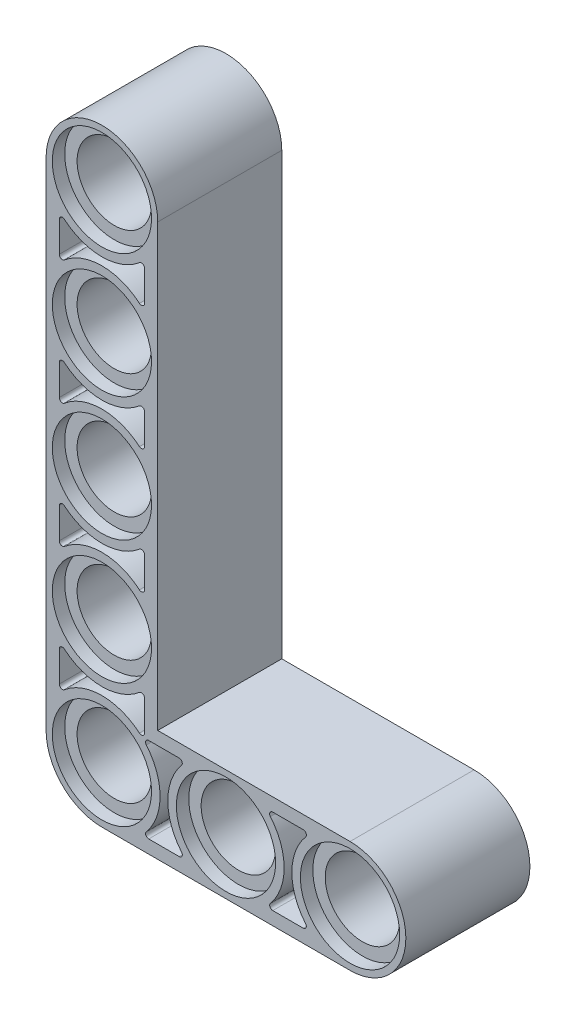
ISO-10303-21;
HEADER;
FILE_DESCRIPTION(('STEP AP214'),'2;1');
FILE_NAME('part.step','',(''),(''),'','','');
FILE_SCHEMA(('AUTOMOTIVE_DESIGN { 1 0 10303 214 1 1 1 1 }'));
ENDSEC;
DATA;
#1=APPLICATION_CONTEXT('core data for automotive mechanical design processes');
#2=APPLICATION_PROTOCOL_DEFINITION('international standard','automotive_design',2000,#1);
#3=PRODUCT_CONTEXT('',#1,'mechanical');
#4=PRODUCT('Part','Part','',(#3));
#5=PRODUCT_RELATED_PRODUCT_CATEGORY('part','',(#4));
#6=PRODUCT_DEFINITION_FORMATION('','',#4);
#7=PRODUCT_DEFINITION_CONTEXT('part definition',#1,'design');
#8=PRODUCT_DEFINITION('design','',#6,#7);
#9=PRODUCT_DEFINITION_SHAPE('','',#8);
#10=(LENGTH_UNIT() NAMED_UNIT(*) SI_UNIT(.MILLI.,.METRE.));
#11=(NAMED_UNIT(*) PLANE_ANGLE_UNIT() SI_UNIT($,.RADIAN.));
#12=(NAMED_UNIT(*) SI_UNIT($,.STERADIAN.) SOLID_ANGLE_UNIT());
#13=UNCERTAINTY_MEASURE_WITH_UNIT(LENGTH_MEASURE(1.E-05),#10,'distance_accuracy_value','');
#14=(GEOMETRIC_REPRESENTATION_CONTEXT(3) GLOBAL_UNCERTAINTY_ASSIGNED_CONTEXT((#13)) GLOBAL_UNIT_ASSIGNED_CONTEXT((#10,
#11,#12)) REPRESENTATION_CONTEXT('',''));
#15=CARTESIAN_POINT('',(0.,0.,0.));
#16=DIRECTION('',(0.,0.,1.));
#17=DIRECTION('',(1.,0.,0.));
#18=AXIS2_PLACEMENT_3D('',#15,#16,#17);
#19=CARTESIAN_POINT('',(0.,0.,-4.));
#20=DIRECTION('',(0.,0.,1.));
#21=DIRECTION('',(1.,0.,0.));
#22=AXIS2_PLACEMENT_3D('',#19,#20,#21);
#23=PLANE('',#22);
#24=CARTESIAN_POINT('',(0.,0.,-4.));
#25=DIRECTION('',(0.,0.,-1.));
#26=DIRECTION('',(1.,0.,0.));
#27=AXIS2_PLACEMENT_3D('',#24,#25,#26);
#28=CIRCLE('',#27,3.75);
#29=CARTESIAN_POINT('',(-2.42088607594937,2.86388034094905,-4.));
#30=VERTEX_POINT('',#29);
#31=CARTESIAN_POINT('',(2.42088607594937,2.86388034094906,-4.));
#32=VERTEX_POINT('',#31);
#33=EDGE_CURVE('E690',#30,#32,#28,.T.);
#34=ORIENTED_EDGE('',*,*,#33,.T.);
#35=CARTESIAN_POINT('',(2.55,3.01662062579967,-4.));
#36=DIRECTION('',(0.,0.,1.));
#37=DIRECTION('',(1.,0.,0.));
#38=AXIS2_PLACEMENT_3D('',#35,#36,#37);
#39=CIRCLE('',#38,0.2);
#40=CARTESIAN_POINT('',(2.75,3.01662062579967,-4.));
#41=VERTEX_POINT('',#40);
#42=EDGE_CURVE('E682',#32,#41,#39,.T.);
#43=ORIENTED_EDGE('',*,*,#42,.T.);
#44=DIRECTION('',(0.,1.,0.));
#45=VECTOR('',#44,1.);
#46=CARTESIAN_POINT('',(2.75,4.98337937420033,-4.));
#47=LINE('',#46,#45);
#48=CARTESIAN_POINT('',(2.75,4.98337937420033,-4.));
#49=VERTEX_POINT('',#48);
#50=EDGE_CURVE('E693',#41,#49,#47,.T.);
#51=ORIENTED_EDGE('',*,*,#50,.T.);
#52=CARTESIAN_POINT('',(2.55,4.98337937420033,-4.));
#53=DIRECTION('',(0.,0.,1.));
#54=DIRECTION('',(-1.,0.,0.));
#55=AXIS2_PLACEMENT_3D('',#52,#53,#54);
#56=CIRCLE('',#55,0.2);
#57=CARTESIAN_POINT('',(2.42088607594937,5.13611965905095,-4.));
#58=VERTEX_POINT('',#57);
#59=EDGE_CURVE('E58',#49,#58,#56,.T.);
#60=ORIENTED_EDGE('',*,*,#59,.T.);
#61=CARTESIAN_POINT('',(0.,8.,-4.));
#62=DIRECTION('',(0.,0.,-1.));
#63=DIRECTION('',(-1.,0.,0.));
#64=AXIS2_PLACEMENT_3D('',#61,#62,#63);
#65=CIRCLE('',#64,3.75);
#66=CARTESIAN_POINT('',(-2.42088607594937,5.13611965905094,-4.));
#67=VERTEX_POINT('',#66);
#68=EDGE_CURVE('E707',#58,#67,#65,.T.);
#69=ORIENTED_EDGE('',*,*,#68,.T.);
#70=CARTESIAN_POINT('',(-2.55,4.98337937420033,-4.));
#71=DIRECTION('',(0.,0.,1.));
#72=DIRECTION('',(-1.,0.,0.));
#73=AXIS2_PLACEMENT_3D('',#70,#71,#72);
#74=CIRCLE('',#73,0.2);
#75=CARTESIAN_POINT('',(-2.75,4.98337937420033,-4.));
#76=VERTEX_POINT('',#75);
#77=EDGE_CURVE('E710',#67,#76,#74,.T.);
#78=ORIENTED_EDGE('',*,*,#77,.T.);
#79=DIRECTION('',(0.,-1.,0.));
#80=VECTOR('',#79,1.);
#81=CARTESIAN_POINT('',(-2.75,4.98337937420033,-4.));
#82=LINE('',#81,#80);
#83=CARTESIAN_POINT('',(-2.75,3.01662062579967,-4.));
#84=VERTEX_POINT('',#83);
#85=EDGE_CURVE('E713',#76,#84,#82,.T.);
#86=ORIENTED_EDGE('',*,*,#85,.T.);
#87=CARTESIAN_POINT('',(-2.55,3.01662062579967,-4.));
#88=DIRECTION('',(0.,0.,1.));
#89=DIRECTION('',(1.,0.,0.));
#90=AXIS2_PLACEMENT_3D('',#87,#88,#89);
#91=CIRCLE('',#90,0.2);
#92=EDGE_CURVE('E716',#84,#30,#91,.T.);
#93=ORIENTED_EDGE('',*,*,#92,.T.);
#94=EDGE_LOOP('',(#34,#43,#51,#60,#69,#78,#86,#93));
#95=FACE_BOUND('',#94,.T.);
#96=CARTESIAN_POINT('',(0.,8.,-4.));
#97=DIRECTION('',(0.,0.,-1.));
#98=DIRECTION('',(1.,0.,0.));
#99=AXIS2_PLACEMENT_3D('',#96,#97,#98);
#100=CIRCLE('',#99,3.75);
#101=CARTESIAN_POINT('',(-2.42088607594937,10.8638803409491,-4.));
#102=VERTEX_POINT('',#101);
#103=CARTESIAN_POINT('',(2.42088607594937,10.8638803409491,-4.));
#104=VERTEX_POINT('',#103);
#105=EDGE_CURVE('E835',#102,#104,#100,.T.);
#106=ORIENTED_EDGE('',*,*,#105,.T.);
#107=CARTESIAN_POINT('',(2.55,11.0166206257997,-4.));
#108=DIRECTION('',(0.,0.,1.));
#109=DIRECTION('',(1.,0.,0.));
#110=AXIS2_PLACEMENT_3D('',#107,#108,#109);
#111=CIRCLE('',#110,0.2);
#112=CARTESIAN_POINT('',(2.75,11.0166206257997,-4.));
#113=VERTEX_POINT('',#112);
#114=EDGE_CURVE('E815',#104,#113,#111,.T.);
#115=ORIENTED_EDGE('',*,*,#114,.T.);
#116=DIRECTION('',(0.,1.,0.));
#117=VECTOR('',#116,1.);
#118=CARTESIAN_POINT('',(2.75,12.9833793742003,-4.));
#119=LINE('',#118,#117);
#120=CARTESIAN_POINT('',(2.75,12.9833793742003,-4.));
#121=VERTEX_POINT('',#120);
#122=EDGE_CURVE('E818',#113,#121,#119,.T.);
#123=ORIENTED_EDGE('',*,*,#122,.T.);
#124=CARTESIAN_POINT('',(2.55,12.9833793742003,-4.));
#125=DIRECTION('',(0.,0.,1.));
#126=DIRECTION('',(-1.,0.,0.));
#127=AXIS2_PLACEMENT_3D('',#124,#125,#126);
#128=CIRCLE('',#127,0.2);
#129=CARTESIAN_POINT('',(2.42088607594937,13.1361196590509,-4.));
#130=VERTEX_POINT('',#129);
#131=EDGE_CURVE('E66',#121,#130,#128,.T.);
#132=ORIENTED_EDGE('',*,*,#131,.T.);
#133=CARTESIAN_POINT('',(0.,16.,-4.));
#134=DIRECTION('',(0.,0.,-1.));
#135=DIRECTION('',(-1.,0.,0.));
#136=AXIS2_PLACEMENT_3D('',#133,#134,#135);
#137=CIRCLE('',#136,3.75);
#138=CARTESIAN_POINT('',(-2.42088607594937,13.1361196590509,-4.));
#139=VERTEX_POINT('',#138);
#140=EDGE_CURVE('E823',#130,#139,#137,.T.);
#141=ORIENTED_EDGE('',*,*,#140,.T.);
#142=CARTESIAN_POINT('',(-2.55,12.9833793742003,-4.));
#143=DIRECTION('',(0.,0.,1.));
#144=DIRECTION('',(-1.,0.,0.));
#145=AXIS2_PLACEMENT_3D('',#142,#143,#144);
#146=CIRCLE('',#145,0.2);
#147=CARTESIAN_POINT('',(-2.75,12.9833793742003,-4.));
#148=VERTEX_POINT('',#147);
#149=EDGE_CURVE('E826',#139,#148,#146,.T.);
#150=ORIENTED_EDGE('',*,*,#149,.T.);
#151=DIRECTION('',(0.,-1.,0.));
#152=VECTOR('',#151,1.);
#153=CARTESIAN_POINT('',(-2.75,12.9833793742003,-4.));
#154=LINE('',#153,#152);
#155=CARTESIAN_POINT('',(-2.75,11.0166206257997,-4.));
#156=VERTEX_POINT('',#155);
#157=EDGE_CURVE('E829',#148,#156,#154,.T.);
#158=ORIENTED_EDGE('',*,*,#157,.T.);
#159=CARTESIAN_POINT('',(-2.55,11.0166206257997,-4.));
#160=DIRECTION('',(0.,0.,1.));
#161=DIRECTION('',(1.,0.,0.));
#162=AXIS2_PLACEMENT_3D('',#159,#160,#161);
#163=CIRCLE('',#162,0.2);
#164=EDGE_CURVE('E832',#156,#102,#163,.T.);
#165=ORIENTED_EDGE('',*,*,#164,.T.);
#166=EDGE_LOOP('',(#106,#115,#123,#132,#141,#150,#158,#165));
#167=FACE_BOUND('',#166,.T.);
#168=CARTESIAN_POINT('',(0.,16.,-4.));
#169=DIRECTION('',(0.,0.,-1.));
#170=DIRECTION('',(1.,0.,0.));
#171=AXIS2_PLACEMENT_3D('',#168,#169,#170);
#172=CIRCLE('',#171,3.75);
#173=CARTESIAN_POINT('',(-2.42088607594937,18.8638803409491,-4.));
#174=VERTEX_POINT('',#173);
#175=CARTESIAN_POINT('',(2.42088607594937,18.8638803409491,-4.));
#176=VERTEX_POINT('',#175);
#177=EDGE_CURVE('E963',#174,#176,#172,.T.);
#178=ORIENTED_EDGE('',*,*,#177,.T.);
#179=CARTESIAN_POINT('',(2.55,19.0166206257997,-4.));
#180=DIRECTION('',(0.,0.,1.));
#181=DIRECTION('',(1.,0.,0.));
#182=AXIS2_PLACEMENT_3D('',#179,#180,#181);
#183=CIRCLE('',#182,0.2);
#184=CARTESIAN_POINT('',(2.75,19.0166206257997,-4.));
#185=VERTEX_POINT('',#184);
#186=EDGE_CURVE('E941',#176,#185,#183,.T.);
#187=ORIENTED_EDGE('',*,*,#186,.T.);
#188=DIRECTION('',(0.,1.,0.));
#189=VECTOR('',#188,1.);
#190=CARTESIAN_POINT('',(2.75,20.9833793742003,-4.));
#191=LINE('',#190,#189);
#192=CARTESIAN_POINT('',(2.75,20.9833793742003,-4.));
#193=VERTEX_POINT('',#192);
#194=EDGE_CURVE('E944',#185,#193,#191,.T.);
#195=ORIENTED_EDGE('',*,*,#194,.T.);
#196=CARTESIAN_POINT('',(2.55,20.9833793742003,-4.));
#197=DIRECTION('',(0.,0.,1.));
#198=DIRECTION('',(-1.,0.,0.));
#199=AXIS2_PLACEMENT_3D('',#196,#197,#198);
#200=CIRCLE('',#199,0.2);
#201=CARTESIAN_POINT('',(2.42088607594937,21.1361196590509,-4.));
#202=VERTEX_POINT('',#201);
#203=EDGE_CURVE('E948',#193,#202,#200,.T.);
#204=ORIENTED_EDGE('',*,*,#203,.T.);
#205=CARTESIAN_POINT('',(0.,24.,-4.));
#206=DIRECTION('',(0.,0.,-1.));
#207=DIRECTION('',(-1.,0.,0.));
#208=AXIS2_PLACEMENT_3D('',#205,#206,#207);
#209=CIRCLE('',#208,3.75);
#210=CARTESIAN_POINT('',(-2.42088607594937,21.1361196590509,-4.));
#211=VERTEX_POINT('',#210);
#212=EDGE_CURVE('E951',#202,#211,#209,.T.);
#213=ORIENTED_EDGE('',*,*,#212,.T.);
#214=CARTESIAN_POINT('',(-2.55,20.9833793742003,-4.));
#215=DIRECTION('',(0.,0.,1.));
#216=DIRECTION('',(-1.,0.,0.));
#217=AXIS2_PLACEMENT_3D('',#214,#215,#216);
#218=CIRCLE('',#217,0.2);
#219=CARTESIAN_POINT('',(-2.75,20.9833793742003,-4.));
#220=VERTEX_POINT('',#219);
#221=EDGE_CURVE('E954',#211,#220,#218,.T.);
#222=ORIENTED_EDGE('',*,*,#221,.T.);
#223=DIRECTION('',(0.,-1.,0.));
#224=VECTOR('',#223,1.);
#225=CARTESIAN_POINT('',(-2.75,20.9833793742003,-4.));
#226=LINE('',#225,#224);
#227=CARTESIAN_POINT('',(-2.75,19.0166206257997,-4.));
#228=VERTEX_POINT('',#227);
#229=EDGE_CURVE('E957',#220,#228,#226,.T.);
#230=ORIENTED_EDGE('',*,*,#229,.T.);
#231=CARTESIAN_POINT('',(-2.55,19.0166206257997,-4.));
#232=DIRECTION('',(0.,0.,1.));
#233=DIRECTION('',(1.,0.,0.));
#234=AXIS2_PLACEMENT_3D('',#231,#232,#233);
#235=CIRCLE('',#234,0.2);
#236=EDGE_CURVE('E960',#228,#174,#235,.T.);
#237=ORIENTED_EDGE('',*,*,#236,.T.);
#238=EDGE_LOOP('',(#178,#187,#195,#204,#213,#222,#230,#237));
#239=FACE_BOUND('',#238,.T.);
#240=CARTESIAN_POINT('',(0.,24.,-4.));
#241=DIRECTION('',(0.,0.,-1.));
#242=DIRECTION('',(1.,0.,0.));
#243=AXIS2_PLACEMENT_3D('',#240,#241,#242);
#244=CIRCLE('',#243,3.75);
#245=CARTESIAN_POINT('',(-2.42088607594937,26.8638803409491,-4.));
#246=VERTEX_POINT('',#245);
#247=CARTESIAN_POINT('',(2.42088607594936,26.8638803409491,-4.));
#248=VERTEX_POINT('',#247);
#249=EDGE_CURVE('E1091',#246,#248,#244,.T.);
#250=ORIENTED_EDGE('',*,*,#249,.T.);
#251=CARTESIAN_POINT('',(2.55,27.0166206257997,-4.));
#252=DIRECTION('',(0.,0.,1.));
#253=DIRECTION('',(1.,0.,0.));
#254=AXIS2_PLACEMENT_3D('',#251,#252,#253);
#255=CIRCLE('',#254,0.2);
#256=CARTESIAN_POINT('',(2.75,27.0166206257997,-4.));
#257=VERTEX_POINT('',#256);
#258=EDGE_CURVE('E1069',#248,#257,#255,.T.);
#259=ORIENTED_EDGE('',*,*,#258,.T.);
#260=DIRECTION('',(0.,1.,0.));
#261=VECTOR('',#260,1.);
#262=CARTESIAN_POINT('',(2.75,28.9833793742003,-4.));
#263=LINE('',#262,#261);
#264=CARTESIAN_POINT('',(2.75,28.9833793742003,-4.));
#265=VERTEX_POINT('',#264);
#266=EDGE_CURVE('E1072',#257,#265,#263,.T.);
#267=ORIENTED_EDGE('',*,*,#266,.T.);
#268=CARTESIAN_POINT('',(2.55,28.9833793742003,-4.));
#269=DIRECTION('',(0.,0.,1.));
#270=DIRECTION('',(-1.,0.,0.));
#271=AXIS2_PLACEMENT_3D('',#268,#269,#270);
#272=CIRCLE('',#271,0.2);
#273=CARTESIAN_POINT('',(2.42088607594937,29.1361196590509,-4.));
#274=VERTEX_POINT('',#273);
#275=EDGE_CURVE('E1076',#265,#274,#272,.T.);
#276=ORIENTED_EDGE('',*,*,#275,.T.);
#277=CARTESIAN_POINT('',(0.,32.,-4.));
#278=DIRECTION('',(0.,0.,-1.));
#279=DIRECTION('',(-1.,0.,0.));
#280=AXIS2_PLACEMENT_3D('',#277,#278,#279);
#281=CIRCLE('',#280,3.75);
#282=CARTESIAN_POINT('',(-2.42088607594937,29.1361196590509,-4.));
#283=VERTEX_POINT('',#282);
#284=EDGE_CURVE('E1079',#274,#283,#281,.T.);
#285=ORIENTED_EDGE('',*,*,#284,.T.);
#286=CARTESIAN_POINT('',(-2.55,28.9833793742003,-4.));
#287=DIRECTION('',(0.,0.,1.));
#288=DIRECTION('',(-1.,0.,0.));
#289=AXIS2_PLACEMENT_3D('',#286,#287,#288);
#290=CIRCLE('',#289,0.2);
#291=CARTESIAN_POINT('',(-2.75,28.9833793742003,-4.));
#292=VERTEX_POINT('',#291);
#293=EDGE_CURVE('E1082',#283,#292,#290,.T.);
#294=ORIENTED_EDGE('',*,*,#293,.T.);
#295=DIRECTION('',(0.,-1.,0.));
#296=VECTOR('',#295,1.);
#297=CARTESIAN_POINT('',(-2.75,28.9833793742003,-4.));
#298=LINE('',#297,#296);
#299=CARTESIAN_POINT('',(-2.75,27.0166206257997,-4.));
#300=VERTEX_POINT('',#299);
#301=EDGE_CURVE('E1085',#292,#300,#298,.T.);
#302=ORIENTED_EDGE('',*,*,#301,.T.);
#303=CARTESIAN_POINT('',(-2.55,27.0166206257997,-4.));
#304=DIRECTION('',(0.,0.,1.));
#305=DIRECTION('',(1.,0.,0.));
#306=AXIS2_PLACEMENT_3D('',#303,#304,#305);
#307=CIRCLE('',#306,0.2);
#308=EDGE_CURVE('E1088',#300,#246,#307,.T.);
#309=ORIENTED_EDGE('',*,*,#308,.T.);
#310=EDGE_LOOP('',(#250,#259,#267,#276,#285,#294,#302,#309));
#311=FACE_BOUND('',#310,.T.);
#312=CARTESIAN_POINT('',(0.,0.,-4.));
#313=DIRECTION('',(0.,0.,-1.));
#314=DIRECTION('',(-1.,0.,0.));
#315=AXIS2_PLACEMENT_3D('',#312,#313,#314);
#316=CIRCLE('',#315,3.75);
#317=CARTESIAN_POINT('',(2.86388034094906,2.42088607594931,-4.));
#318=VERTEX_POINT('',#317);
#319=CARTESIAN_POINT('',(2.86388034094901,-2.42088607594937,-4.));
#320=VERTEX_POINT('',#319);
#321=EDGE_CURVE('E1284',#318,#320,#316,.T.);
#322=ORIENTED_EDGE('',*,*,#321,.T.);
#323=CARTESIAN_POINT('',(3.01662062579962,-2.55,-4.));
#324=DIRECTION('',(0.,0.,1.));
#325=DIRECTION('',(-1.,0.,0.));
#326=AXIS2_PLACEMENT_3D('',#323,#324,#325);
#327=CIRCLE('',#326,0.2);
#328=CARTESIAN_POINT('',(3.01662062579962,-2.75,-4.));
#329=VERTEX_POINT('',#328);
#330=EDGE_CURVE('E1262',#320,#329,#327,.T.);
#331=ORIENTED_EDGE('',*,*,#330,.T.);
#332=DIRECTION('',(1.,0.,0.));
#333=VECTOR('',#332,1.);
#334=CARTESIAN_POINT('',(3.01662062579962,-2.75,-4.));
#335=LINE('',#334,#333);
#336=CARTESIAN_POINT('',(4.98337937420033,-2.75,-4.));
#337=VERTEX_POINT('',#336);
#338=EDGE_CURVE('E1265',#329,#337,#335,.T.);
#339=ORIENTED_EDGE('',*,*,#338,.T.);
#340=CARTESIAN_POINT('',(4.98337937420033,-2.55,-4.));
#341=DIRECTION('',(0.,0.,1.));
#342=DIRECTION('',(-1.,0.,0.));
#343=AXIS2_PLACEMENT_3D('',#340,#341,#342);
#344=CIRCLE('',#343,0.199999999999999);
#345=CARTESIAN_POINT('',(5.13611965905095,-2.42088607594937,-4.));
#346=VERTEX_POINT('',#345);
#347=EDGE_CURVE('E1269',#337,#346,#344,.T.);
#348=ORIENTED_EDGE('',*,*,#347,.T.);
#349=CARTESIAN_POINT('',(8.,0.,-4.));
#350=DIRECTION('',(0.,0.,-1.));
#351=DIRECTION('',(-1.,0.,0.));
#352=AXIS2_PLACEMENT_3D('',#349,#350,#351);
#353=CIRCLE('',#352,3.75);
#354=CARTESIAN_POINT('',(5.13611965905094,2.42088607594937,-4.));
#355=VERTEX_POINT('',#354);
#356=EDGE_CURVE('E1272',#346,#355,#353,.T.);
#357=ORIENTED_EDGE('',*,*,#356,.T.);
#358=CARTESIAN_POINT('',(4.98337937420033,2.55,-4.));
#359=DIRECTION('',(0.,0.,1.));
#360=DIRECTION('',(-1.,0.,0.));
#361=AXIS2_PLACEMENT_3D('',#358,#359,#360);
#362=CIRCLE('',#361,0.200000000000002);
#363=CARTESIAN_POINT('',(4.98337937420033,2.75,-4.));
#364=VERTEX_POINT('',#363);
#365=EDGE_CURVE('E1275',#355,#364,#362,.T.);
#366=ORIENTED_EDGE('',*,*,#365,.T.);
#367=DIRECTION('',(-1.,0.,0.));
#368=VECTOR('',#367,1.);
#369=CARTESIAN_POINT('',(3.01662062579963,2.75,-4.));
#370=LINE('',#369,#368);
#371=CARTESIAN_POINT('',(3.01662062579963,2.75,-4.));
#372=VERTEX_POINT('',#371);
#373=EDGE_CURVE('E1278',#364,#372,#370,.T.);
#374=ORIENTED_EDGE('',*,*,#373,.T.);
#375=CARTESIAN_POINT('',(3.01662062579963,2.55,-4.));
#376=DIRECTION('',(0.,0.,1.));
#377=DIRECTION('',(1.,0.,0.));
#378=AXIS2_PLACEMENT_3D('',#375,#376,#377);
#379=CIRCLE('',#378,0.200000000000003);
#380=EDGE_CURVE('E1281',#372,#318,#379,.T.);
#381=ORIENTED_EDGE('',*,*,#380,.T.);
#382=EDGE_LOOP('',(#322,#331,#339,#348,#357,#366,#374,#381));
#383=FACE_BOUND('',#382,.T.);
#384=CARTESIAN_POINT('',(7.99999999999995,0.,-4.));
#385=DIRECTION('',(0.,0.,-1.));
#386=DIRECTION('',(-1.,0.,0.));
#387=AXIS2_PLACEMENT_3D('',#384,#385,#386);
#388=CIRCLE('',#387,3.75);
#389=CARTESIAN_POINT('',(10.8638803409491,2.42088607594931,-4.));
#390=VERTEX_POINT('',#389);
#391=CARTESIAN_POINT('',(10.863880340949,-2.42088607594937,-4.));
#392=VERTEX_POINT('',#391);
#393=EDGE_CURVE('E1348',#390,#392,#388,.T.);
#394=ORIENTED_EDGE('',*,*,#393,.T.);
#395=CARTESIAN_POINT('',(11.0166206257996,-2.55,-4.));
#396=DIRECTION('',(0.,0.,1.));
#397=DIRECTION('',(-1.,0.,0.));
#398=AXIS2_PLACEMENT_3D('',#395,#396,#397);
#399=CIRCLE('',#398,0.2);
#400=CARTESIAN_POINT('',(11.0166206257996,-2.75,-4.));
#401=VERTEX_POINT('',#400);
#402=EDGE_CURVE('E1326',#392,#401,#399,.T.);
#403=ORIENTED_EDGE('',*,*,#402,.T.);
#404=DIRECTION('',(1.,0.,0.));
#405=VECTOR('',#404,1.);
#406=CARTESIAN_POINT('',(11.0166206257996,-2.75,-4.));
#407=LINE('',#406,#405);
#408=CARTESIAN_POINT('',(12.9833793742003,-2.75,-4.));
#409=VERTEX_POINT('',#408);
#410=EDGE_CURVE('E1329',#401,#409,#407,.T.);
#411=ORIENTED_EDGE('',*,*,#410,.T.);
#412=CARTESIAN_POINT('',(12.9833793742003,-2.55,-4.));
#413=DIRECTION('',(0.,0.,1.));
#414=DIRECTION('',(-1.,0.,0.));
#415=AXIS2_PLACEMENT_3D('',#412,#413,#414);
#416=CIRCLE('',#415,0.199999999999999);
#417=CARTESIAN_POINT('',(13.1361196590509,-2.42088607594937,-4.));
#418=VERTEX_POINT('',#417);
#419=EDGE_CURVE('E1333',#409,#418,#416,.T.);
#420=ORIENTED_EDGE('',*,*,#419,.T.);
#421=CARTESIAN_POINT('',(16.,0.,-4.));
#422=DIRECTION('',(0.,0.,-1.));
#423=DIRECTION('',(-1.,0.,0.));
#424=AXIS2_PLACEMENT_3D('',#421,#422,#423);
#425=CIRCLE('',#424,3.75);
#426=CARTESIAN_POINT('',(13.1361196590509,2.42088607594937,-4.));
#427=VERTEX_POINT('',#426);
#428=EDGE_CURVE('E1336',#418,#427,#425,.T.);
#429=ORIENTED_EDGE('',*,*,#428,.T.);
#430=CARTESIAN_POINT('',(12.9833793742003,2.55,-4.));
#431=DIRECTION('',(0.,0.,1.));
#432=DIRECTION('',(-1.,0.,0.));
#433=AXIS2_PLACEMENT_3D('',#430,#431,#432);
#434=CIRCLE('',#433,0.200000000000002);
#435=CARTESIAN_POINT('',(12.9833793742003,2.75,-4.));
#436=VERTEX_POINT('',#435);
#437=EDGE_CURVE('E1339',#427,#436,#434,.T.);
#438=ORIENTED_EDGE('',*,*,#437,.T.);
#439=DIRECTION('',(-1.,0.,0.));
#440=VECTOR('',#439,1.);
#441=CARTESIAN_POINT('',(11.0166206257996,2.75,-4.));
#442=LINE('',#441,#440);
#443=CARTESIAN_POINT('',(11.0166206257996,2.75,-4.));
#444=VERTEX_POINT('',#443);
#445=EDGE_CURVE('E1342',#436,#444,#442,.T.);
#446=ORIENTED_EDGE('',*,*,#445,.T.);
#447=CARTESIAN_POINT('',(11.0166206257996,2.55,-4.));
#448=DIRECTION('',(0.,0.,1.));
#449=DIRECTION('',(1.,0.,0.));
#450=AXIS2_PLACEMENT_3D('',#447,#448,#449);
#451=CIRCLE('',#450,0.200000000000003);
#452=EDGE_CURVE('E1345',#444,#390,#451,.T.);
#453=ORIENTED_EDGE('',*,*,#452,.T.);
#454=EDGE_LOOP('',(#394,#403,#411,#420,#429,#438,#446,#453));
#455=FACE_BOUND('',#454,.T.);
#456=CARTESIAN_POINT('',(16.,0.,-4.));
#457=DIRECTION('',(0.,0.,-1.));
#458=DIRECTION('',(-1.,0.,0.));
#459=AXIS2_PLACEMENT_3D('',#456,#457,#458);
#460=CIRCLE('',#459,3.19999999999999);
#461=CARTESIAN_POINT('',(12.8,0.,-4.));
#462=VERTEX_POINT('',#461);
#463=EDGE_CURVE('E1437',#462,#462,#460,.T.);
#464=ORIENTED_EDGE('',*,*,#463,.F.);
#465=EDGE_LOOP('',(#464));
#466=FACE_BOUND('',#465,.T.);
#467=CARTESIAN_POINT('',(0.,24.,-4.));
#468=DIRECTION('',(0.,0.,-1.));
#469=DIRECTION('',(-1.,0.,0.));
#470=AXIS2_PLACEMENT_3D('',#467,#468,#469);
#471=CIRCLE('',#470,3.19999999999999);
#472=CARTESIAN_POINT('',(-3.2,24.,-4.));
#473=VERTEX_POINT('',#472);
#474=EDGE_CURVE('E1496',#473,#473,#471,.T.);
#475=ORIENTED_EDGE('',*,*,#474,.F.);
#476=EDGE_LOOP('',(#475));
#477=FACE_BOUND('',#476,.T.);
#478=CARTESIAN_POINT('',(0.,8.,-4.));
#479=DIRECTION('',(0.,0.,-1.));
#480=DIRECTION('',(-1.,0.,0.));
#481=AXIS2_PLACEMENT_3D('',#478,#479,#480);
#482=CIRCLE('',#481,3.19999999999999);
#483=CARTESIAN_POINT('',(-3.19999999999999,8.,-4.));
#484=VERTEX_POINT('',#483);
#485=EDGE_CURVE('E1514',#484,#484,#482,.T.);
#486=ORIENTED_EDGE('',*,*,#485,.F.);
#487=EDGE_LOOP('',(#486));
#488=FACE_BOUND('',#487,.T.);
#489=CARTESIAN_POINT('',(0.,0.,-4.));
#490=DIRECTION('',(0.,0.,-1.));
#491=DIRECTION('',(-1.,0.,0.));
#492=AXIS2_PLACEMENT_3D('',#489,#490,#491);
#493=CIRCLE('',#492,3.19999999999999);
#494=CARTESIAN_POINT('',(-3.19999999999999,0.,-4.));
#495=VERTEX_POINT('',#494);
#496=EDGE_CURVE('E1559',#495,#495,#493,.T.);
#497=ORIENTED_EDGE('',*,*,#496,.F.);
#498=EDGE_LOOP('',(#497));
#499=FACE_BOUND('',#498,.T.);
#500=CARTESIAN_POINT('',(0.,0.,-4.));
#501=DIRECTION('',(0.,0.,1.));
#502=DIRECTION('',(1.,0.,0.));
#503=AXIS2_PLACEMENT_3D('',#500,#501,#502);
#504=CIRCLE('',#503,3.6);
#505=CARTESIAN_POINT('',(-3.6,0.,-4.));
#506=VERTEX_POINT('',#505);
#507=CARTESIAN_POINT('',(0.,-3.6,-4.));
#508=VERTEX_POINT('',#507);
#509=EDGE_CURVE('E1602',#506,#508,#504,.T.);
#510=ORIENTED_EDGE('',*,*,#509,.F.);
#511=DIRECTION('',(0.,1.,0.));
#512=VECTOR('',#511,1.);
#513=CARTESIAN_POINT('',(-3.6,32.,-4.));
#514=LINE('',#513,#512);
#515=CARTESIAN_POINT('',(-3.6,32.,-4.));
#516=VERTEX_POINT('',#515);
#517=EDGE_CURVE('E1584',#506,#516,#514,.T.);
#518=ORIENTED_EDGE('',*,*,#517,.T.);
#519=CARTESIAN_POINT('',(0.,32.,-4.));
#520=DIRECTION('',(0.,0.,1.));
#521=DIRECTION('',(1.,0.,0.));
#522=AXIS2_PLACEMENT_3D('',#519,#520,#521);
#523=CIRCLE('',#522,3.6);
#524=CARTESIAN_POINT('',(3.6,32.,-4.));
#525=VERTEX_POINT('',#524);
#526=EDGE_CURVE('E1581',#516,#525,#523,.F.);
#527=ORIENTED_EDGE('',*,*,#526,.T.);
#528=DIRECTION('',(0.,-1.,0.));
#529=VECTOR('',#528,1.);
#530=CARTESIAN_POINT('',(3.6,32.,-4.));
#531=LINE('',#530,#529);
#532=CARTESIAN_POINT('',(3.6,3.6,-4.));
#533=VERTEX_POINT('',#532);
#534=EDGE_CURVE('E1578',#525,#533,#531,.T.);
#535=ORIENTED_EDGE('',*,*,#534,.T.);
#536=DIRECTION('',(-1.,0.,0.));
#537=VECTOR('',#536,1.);
#538=CARTESIAN_POINT('',(0.,3.6,-4.));
#539=LINE('',#538,#537);
#540=CARTESIAN_POINT('',(16.,3.6,-4.));
#541=VERTEX_POINT('',#540);
#542=EDGE_CURVE('E1606',#541,#533,#539,.T.);
#543=ORIENTED_EDGE('',*,*,#542,.F.);
#544=CARTESIAN_POINT('',(16.,0.,-4.));
#545=DIRECTION('',(0.,0.,1.));
#546=DIRECTION('',(1.,0.,0.));
#547=AXIS2_PLACEMENT_3D('',#544,#545,#546);
#548=CIRCLE('',#547,3.6);
#549=CARTESIAN_POINT('',(16.,-3.6,-4.));
#550=VERTEX_POINT('',#549);
#551=EDGE_CURVE('E1617',#550,#541,#548,.T.);
#552=ORIENTED_EDGE('',*,*,#551,.F.);
#553=DIRECTION('',(1.,0.,0.));
#554=VECTOR('',#553,1.);
#555=CARTESIAN_POINT('',(0.,-3.6,-4.));
#556=LINE('',#555,#554);
#557=EDGE_CURVE('E1615',#508,#550,#556,.T.);
#558=ORIENTED_EDGE('',*,*,#557,.F.);
#559=EDGE_LOOP('',(#510,#518,#527,#535,#543,#552,#558));
#560=FACE_BOUND('',#559,.T.);
#561=CARTESIAN_POINT('',(0.,16.,-4.));
#562=DIRECTION('',(0.,0.,-1.));
#563=DIRECTION('',(-1.,0.,0.));
#564=AXIS2_PLACEMENT_3D('',#561,#562,#563);
#565=CIRCLE('',#564,3.19999999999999);
#566=CARTESIAN_POINT('',(-3.2,16.,-4.));
#567=VERTEX_POINT('',#566);
#568=EDGE_CURVE('E1505',#567,#567,#565,.T.);
#569=ORIENTED_EDGE('',*,*,#568,.F.);
#570=EDGE_LOOP('',(#569));
#571=FACE_BOUND('',#570,.T.);
#572=CARTESIAN_POINT('',(0.,32.,-4.));
#573=DIRECTION('',(0.,0.,-1.));
#574=DIRECTION('',(-1.,0.,0.));
#575=AXIS2_PLACEMENT_3D('',#572,#573,#574);
#576=CIRCLE('',#575,3.19999999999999);
#577=CARTESIAN_POINT('',(-3.2,32.,-4.));
#578=VERTEX_POINT('',#577);
#579=EDGE_CURVE('E1487',#578,#578,#576,.T.);
#580=ORIENTED_EDGE('',*,*,#579,.F.);
#581=EDGE_LOOP('',(#580));
#582=FACE_BOUND('',#581,.T.);
#583=CARTESIAN_POINT('',(8.,0.,-4.));
#584=DIRECTION('',(0.,0.,-1.));
#585=DIRECTION('',(-1.,0.,0.));
#586=AXIS2_PLACEMENT_3D('',#583,#584,#585);
#587=CIRCLE('',#586,3.19999999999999);
#588=CARTESIAN_POINT('',(4.80000000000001,0.,-4.));
#589=VERTEX_POINT('',#588);
#590=EDGE_CURVE('E1460',#589,#589,#587,.T.);
#591=ORIENTED_EDGE('',*,*,#590,.F.);
#592=EDGE_LOOP('',(#591));
#593=FACE_BOUND('',#592,.T.);
#594=ADVANCED_FACE('F43',(#95,#167,#239,#311,#383,#455,#466,#477,#488,#499,#560,#571,#582,#593),
#23,.F.);
#595=CARTESIAN_POINT('',(0.,0.,4.));
#596=DIRECTION('',(0.,0.,-1.));
#597=DIRECTION('',(-1.,0.,0.));
#598=AXIS2_PLACEMENT_3D('',#595,#596,#597);
#599=CYLINDRICAL_SURFACE('',#598,3.6);
#600=CARTESIAN_POINT('',(0.,0.,4.));
#601=DIRECTION('',(0.,0.,1.));
#602=DIRECTION('',(1.,0.,0.));
#603=AXIS2_PLACEMENT_3D('',#600,#601,#602);
#604=CIRCLE('',#603,3.6);
#605=CARTESIAN_POINT('',(-3.6,0.,4.));
#606=VERTEX_POINT('',#605);
#607=CARTESIAN_POINT('',(0.,-3.6,4.));
#608=VERTEX_POINT('',#607);
#609=EDGE_CURVE('E1603',#606,#608,#604,.T.);
#610=ORIENTED_EDGE('',*,*,#609,.F.);
#611=DIRECTION('',(0.,0.,1.));
#612=VECTOR('',#611,1.);
#613=CARTESIAN_POINT('',(-3.6,0.,-43.8557398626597));
#614=LINE('',#613,#612);
#615=EDGE_CURVE('E1595',#506,#606,#614,.T.);
#616=ORIENTED_EDGE('',*,*,#615,.F.);
#617=ORIENTED_EDGE('',*,*,#509,.T.);
#618=DIRECTION('',(0.,0.,-1.));
#619=VECTOR('',#618,1.);
#620=CARTESIAN_POINT('',(0.,-3.6,4.));
#621=LINE('',#620,#619);
#622=EDGE_CURVE('E11',#608,#508,#621,.T.);
#623=ORIENTED_EDGE('',*,*,#622,.F.);
#624=EDGE_LOOP('',(#610,#616,#617,#623));
#625=FACE_BOUND('',#624,.T.);
#626=ADVANCED_FACE('F45',(#625),#599,.T.);
#627=CARTESIAN_POINT('',(0.,-3.6,4.));
#628=DIRECTION('',(0.,1.,0.));
#629=DIRECTION('',(-1.,0.,0.));
#630=AXIS2_PLACEMENT_3D('',#627,#628,#629);
#631=PLANE('',#630);
#632=ORIENTED_EDGE('',*,*,#557,.T.);
#633=DIRECTION('',(0.,0.,-1.));
#634=VECTOR('',#633,1.);
#635=CARTESIAN_POINT('',(16.,-3.6,4.));
#636=LINE('',#635,#634);
#637=CARTESIAN_POINT('',(16.,-3.6,4.));
#638=VERTEX_POINT('',#637);
#639=EDGE_CURVE('E51',#638,#550,#636,.T.);
#640=ORIENTED_EDGE('',*,*,#639,.F.);
#641=DIRECTION('',(1.,0.,0.));
#642=VECTOR('',#641,1.);
#643=CARTESIAN_POINT('',(0.,-3.6,4.));
#644=LINE('',#643,#642);
#645=EDGE_CURVE('E1605',#608,#638,#644,.T.);
#646=ORIENTED_EDGE('',*,*,#645,.F.);
#647=ORIENTED_EDGE('',*,*,#622,.T.);
#648=EDGE_LOOP('',(#632,#640,#646,#647));
#649=FACE_BOUND('',#648,.T.);
#650=ADVANCED_FACE('F1648',(#649),#631,.F.);
#651=CARTESIAN_POINT('',(16.,0.,4.));
#652=DIRECTION('',(0.,0.,-1.));
#653=DIRECTION('',(-1.,0.,0.));
#654=AXIS2_PLACEMENT_3D('',#651,#652,#653);
#655=CYLINDRICAL_SURFACE('',#654,3.6);
#656=ORIENTED_EDGE('',*,*,#551,.T.);
#657=DIRECTION('',(0.,0.,-1.));
#658=VECTOR('',#657,1.);
#659=CARTESIAN_POINT('',(16.,3.6,4.));
#660=LINE('',#659,#658);
#661=CARTESIAN_POINT('',(16.,3.6,4.));
#662=VERTEX_POINT('',#661);
#663=EDGE_CURVE('E1613',#662,#541,#660,.T.);
#664=ORIENTED_EDGE('',*,*,#663,.F.);
#665=CARTESIAN_POINT('',(16.,0.,4.));
#666=DIRECTION('',(0.,0.,1.));
#667=DIRECTION('',(1.,0.,0.));
#668=AXIS2_PLACEMENT_3D('',#665,#666,#667);
#669=CIRCLE('',#668,3.6);
#670=EDGE_CURVE('E1608',#638,#662,#669,.T.);
#671=ORIENTED_EDGE('',*,*,#670,.F.);
#672=ORIENTED_EDGE('',*,*,#639,.T.);
#673=EDGE_LOOP('',(#656,#664,#671,#672));
#674=FACE_BOUND('',#673,.T.);
#675=ADVANCED_FACE('F1626',(#674),#655,.T.);
#676=CARTESIAN_POINT('',(0.,3.6,4.));
#677=DIRECTION('',(0.,-1.,0.));
#678=DIRECTION('',(1.,0.,0.));
#679=AXIS2_PLACEMENT_3D('',#676,#677,#678);
#680=PLANE('',#679);
#681=ORIENTED_EDGE('',*,*,#542,.T.);
#682=DIRECTION('',(0.,0.,1.));
#683=VECTOR('',#682,1.);
#684=CARTESIAN_POINT('',(3.6,3.6,4.));
#685=LINE('',#684,#683);
#686=CARTESIAN_POINT('',(3.6,3.6,4.));
#687=VERTEX_POINT('',#686);
#688=EDGE_CURVE('E1600',#533,#687,#685,.T.);
#689=ORIENTED_EDGE('',*,*,#688,.T.);
#690=DIRECTION('',(-1.,0.,0.));
#691=VECTOR('',#690,1.);
#692=CARTESIAN_POINT('',(0.,3.6,4.));
#693=LINE('',#692,#691);
#694=EDGE_CURVE('E1610',#662,#687,#693,.T.);
#695=ORIENTED_EDGE('',*,*,#694,.F.);
#696=ORIENTED_EDGE('',*,*,#663,.T.);
#697=EDGE_LOOP('',(#681,#689,#695,#696));
#698=FACE_BOUND('',#697,.T.);
#699=ADVANCED_FACE('F1638',(#698),#680,.F.);
#700=CARTESIAN_POINT('',(0.,0.,4.));
#701=DIRECTION('',(0.,0.,1.));
#702=DIRECTION('',(1.,0.,0.));
#703=AXIS2_PLACEMENT_3D('',#700,#701,#702);
#704=PLANE('',#703);
#705=CARTESIAN_POINT('',(2.55,11.0166206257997,4.));
#706=DIRECTION('',(0.,0.,1.));
#707=DIRECTION('',(1.,0.,0.));
#708=AXIS2_PLACEMENT_3D('',#705,#706,#707);
#709=CIRCLE('',#708,0.2);
#710=CARTESIAN_POINT('',(2.42088607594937,10.8638803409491,4.));
#711=VERTEX_POINT('',#710);
#712=CARTESIAN_POINT('',(2.75,11.0166206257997,4.));
#713=VERTEX_POINT('',#712);
#714=EDGE_CURVE('E777',#711,#713,#709,.T.);
#715=ORIENTED_EDGE('',*,*,#714,.F.);
#716=CARTESIAN_POINT('',(0.,8.,4.));
#717=DIRECTION('',(0.,0.,-1.));
#718=DIRECTION('',(1.,0.,0.));
#719=AXIS2_PLACEMENT_3D('',#716,#717,#718);
#720=CIRCLE('',#719,3.75);
#721=CARTESIAN_POINT('',(-2.42088607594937,10.8638803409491,4.));
#722=VERTEX_POINT('',#721);
#723=EDGE_CURVE('E755',#722,#711,#720,.T.);
#724=ORIENTED_EDGE('',*,*,#723,.F.);
#725=CARTESIAN_POINT('',(-2.55,11.0166206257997,4.));
#726=DIRECTION('',(0.,0.,1.));
#727=DIRECTION('',(1.,0.,0.));
#728=AXIS2_PLACEMENT_3D('',#725,#726,#727);
#729=CIRCLE('',#728,0.2);
#730=CARTESIAN_POINT('',(-2.75,11.0166206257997,4.));
#731=VERTEX_POINT('',#730);
#732=EDGE_CURVE('E795',#731,#722,#729,.T.);
#733=ORIENTED_EDGE('',*,*,#732,.F.);
#734=DIRECTION('',(0.,-1.,0.));
#735=VECTOR('',#734,1.);
#736=CARTESIAN_POINT('',(-2.75,12.9833793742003,4.));
#737=LINE('',#736,#735);
#738=CARTESIAN_POINT('',(-2.75,12.9833793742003,4.));
#739=VERTEX_POINT('',#738);
#740=EDGE_CURVE('E792',#739,#731,#737,.T.);
#741=ORIENTED_EDGE('',*,*,#740,.F.);
#742=CARTESIAN_POINT('',(-2.55,12.9833793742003,4.));
#743=DIRECTION('',(0.,0.,1.));
#744=DIRECTION('',(-1.,0.,0.));
#745=AXIS2_PLACEMENT_3D('',#742,#743,#744);
#746=CIRCLE('',#745,0.2);
#747=CARTESIAN_POINT('',(-2.42088607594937,13.1361196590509,4.));
#748=VERTEX_POINT('',#747);
#749=EDGE_CURVE('E789',#748,#739,#746,.T.);
#750=ORIENTED_EDGE('',*,*,#749,.F.);
#751=CARTESIAN_POINT('',(0.,16.,4.));
#752=DIRECTION('',(0.,0.,-1.));
#753=DIRECTION('',(-1.,0.,0.));
#754=AXIS2_PLACEMENT_3D('',#751,#752,#753);
#755=CIRCLE('',#754,3.75);
#756=CARTESIAN_POINT('',(2.42088607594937,13.1361196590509,4.));
#757=VERTEX_POINT('',#756);
#758=EDGE_CURVE('E786',#757,#748,#755,.T.);
#759=ORIENTED_EDGE('',*,*,#758,.F.);
#760=CARTESIAN_POINT('',(2.55,12.9833793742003,4.));
#761=DIRECTION('',(0.,0.,1.));
#762=DIRECTION('',(-1.,0.,0.));
#763=AXIS2_PLACEMENT_3D('',#760,#761,#762);
#764=CIRCLE('',#763,0.2);
#765=CARTESIAN_POINT('',(2.75,12.9833793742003,4.));
#766=VERTEX_POINT('',#765);
#767=EDGE_CURVE('E783',#766,#757,#764,.T.);
#768=ORIENTED_EDGE('',*,*,#767,.F.);
#769=DIRECTION('',(0.,1.,0.));
#770=VECTOR('',#769,1.);
#771=CARTESIAN_POINT('',(2.75,12.9833793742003,4.));
#772=LINE('',#771,#770);
#773=EDGE_CURVE('E779',#713,#766,#772,.T.);
#774=ORIENTED_EDGE('',*,*,#773,.F.);
#775=EDGE_LOOP('',(#715,#724,#733,#741,#750,#759,#768,#774));
#776=FACE_BOUND('',#775,.T.);
#777=CARTESIAN_POINT('',(2.55,19.0166206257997,4.));
#778=DIRECTION('',(0.,0.,1.));
#779=DIRECTION('',(1.,0.,0.));
#780=AXIS2_PLACEMENT_3D('',#777,#778,#779);
#781=CIRCLE('',#780,0.2);
#782=CARTESIAN_POINT('',(2.42088607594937,18.8638803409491,4.));
#783=VERTEX_POINT('',#782);
#784=CARTESIAN_POINT('',(2.75,19.0166206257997,4.));
#785=VERTEX_POINT('',#784);
#786=EDGE_CURVE('E903',#783,#785,#781,.T.);
#787=ORIENTED_EDGE('',*,*,#786,.F.);
#788=CARTESIAN_POINT('',(0.,16.,4.));
#789=DIRECTION('',(0.,0.,-1.));
#790=DIRECTION('',(1.,0.,0.));
#791=AXIS2_PLACEMENT_3D('',#788,#789,#790);
#792=CIRCLE('',#791,3.75);
#793=CARTESIAN_POINT('',(-2.42088607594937,18.8638803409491,4.));
#794=VERTEX_POINT('',#793);
#795=EDGE_CURVE('E881',#794,#783,#792,.T.);
#796=ORIENTED_EDGE('',*,*,#795,.F.);
#797=CARTESIAN_POINT('',(-2.55,19.0166206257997,4.));
#798=DIRECTION('',(0.,0.,1.));
#799=DIRECTION('',(1.,0.,0.));
#800=AXIS2_PLACEMENT_3D('',#797,#798,#799);
#801=CIRCLE('',#800,0.2);
#802=CARTESIAN_POINT('',(-2.75,19.0166206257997,4.));
#803=VERTEX_POINT('',#802);
#804=EDGE_CURVE('E921',#803,#794,#801,.T.);
#805=ORIENTED_EDGE('',*,*,#804,.F.);
#806=DIRECTION('',(0.,-1.,0.));
#807=VECTOR('',#806,1.);
#808=CARTESIAN_POINT('',(-2.75,20.9833793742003,4.));
#809=LINE('',#808,#807);
#810=CARTESIAN_POINT('',(-2.75,20.9833793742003,4.));
#811=VERTEX_POINT('',#810);
#812=EDGE_CURVE('E918',#811,#803,#809,.T.);
#813=ORIENTED_EDGE('',*,*,#812,.F.);
#814=CARTESIAN_POINT('',(-2.55,20.9833793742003,4.));
#815=DIRECTION('',(0.,0.,1.));
#816=DIRECTION('',(-1.,0.,0.));
#817=AXIS2_PLACEMENT_3D('',#814,#815,#816);
#818=CIRCLE('',#817,0.2);
#819=CARTESIAN_POINT('',(-2.42088607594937,21.1361196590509,4.));
#820=VERTEX_POINT('',#819);
#821=EDGE_CURVE('E915',#820,#811,#818,.T.);
#822=ORIENTED_EDGE('',*,*,#821,.F.);
#823=CARTESIAN_POINT('',(0.,24.,4.));
#824=DIRECTION('',(0.,0.,-1.));
#825=DIRECTION('',(-1.,0.,0.));
#826=AXIS2_PLACEMENT_3D('',#823,#824,#825);
#827=CIRCLE('',#826,3.75);
#828=CARTESIAN_POINT('',(2.42088607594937,21.1361196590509,4.));
#829=VERTEX_POINT('',#828);
#830=EDGE_CURVE('E912',#829,#820,#827,.T.);
#831=ORIENTED_EDGE('',*,*,#830,.F.);
#832=CARTESIAN_POINT('',(2.55,20.9833793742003,4.));
#833=DIRECTION('',(0.,0.,1.));
#834=DIRECTION('',(-1.,0.,0.));
#835=AXIS2_PLACEMENT_3D('',#832,#833,#834);
#836=CIRCLE('',#835,0.2);
#837=CARTESIAN_POINT('',(2.75,20.9833793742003,4.));
#838=VERTEX_POINT('',#837);
#839=EDGE_CURVE('E909',#838,#829,#836,.T.);
#840=ORIENTED_EDGE('',*,*,#839,.F.);
#841=DIRECTION('',(0.,1.,0.));
#842=VECTOR('',#841,1.);
#843=CARTESIAN_POINT('',(2.75,20.9833793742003,4.));
#844=LINE('',#843,#842);
#845=EDGE_CURVE('E905',#785,#838,#844,.T.);
#846=ORIENTED_EDGE('',*,*,#845,.F.);
#847=EDGE_LOOP('',(#787,#796,#805,#813,#822,#831,#840,#846));
#848=FACE_BOUND('',#847,.T.);
#849=CARTESIAN_POINT('',(2.55,27.0166206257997,4.));
#850=DIRECTION('',(0.,0.,1.));
#851=DIRECTION('',(1.,0.,0.));
#852=AXIS2_PLACEMENT_3D('',#849,#850,#851);
#853=CIRCLE('',#852,0.2);
#854=CARTESIAN_POINT('',(2.42088607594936,26.8638803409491,4.));
#855=VERTEX_POINT('',#854);
#856=CARTESIAN_POINT('',(2.75,27.0166206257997,4.));
#857=VERTEX_POINT('',#856);
#858=EDGE_CURVE('E1031',#855,#857,#853,.T.);
#859=ORIENTED_EDGE('',*,*,#858,.F.);
#860=CARTESIAN_POINT('',(0.,24.,4.));
#861=DIRECTION('',(0.,0.,-1.));
#862=DIRECTION('',(1.,0.,0.));
#863=AXIS2_PLACEMENT_3D('',#860,#861,#862);
#864=CIRCLE('',#863,3.75);
#865=CARTESIAN_POINT('',(-2.42088607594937,26.8638803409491,4.));
#866=VERTEX_POINT('',#865);
#867=EDGE_CURVE('E1009',#866,#855,#864,.T.);
#868=ORIENTED_EDGE('',*,*,#867,.F.);
#869=CARTESIAN_POINT('',(-2.55,27.0166206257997,4.));
#870=DIRECTION('',(0.,0.,1.));
#871=DIRECTION('',(1.,0.,0.));
#872=AXIS2_PLACEMENT_3D('',#869,#870,#871);
#873=CIRCLE('',#872,0.2);
#874=CARTESIAN_POINT('',(-2.75,27.0166206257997,4.));
#875=VERTEX_POINT('',#874);
#876=EDGE_CURVE('E1049',#875,#866,#873,.T.);
#877=ORIENTED_EDGE('',*,*,#876,.F.);
#878=DIRECTION('',(0.,-1.,0.));
#879=VECTOR('',#878,1.);
#880=CARTESIAN_POINT('',(-2.75,28.9833793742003,4.));
#881=LINE('',#880,#879);
#882=CARTESIAN_POINT('',(-2.75,28.9833793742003,4.));
#883=VERTEX_POINT('',#882);
#884=EDGE_CURVE('E1046',#883,#875,#881,.T.);
#885=ORIENTED_EDGE('',*,*,#884,.F.);
#886=CARTESIAN_POINT('',(-2.55,28.9833793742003,4.));
#887=DIRECTION('',(0.,0.,1.));
#888=DIRECTION('',(-1.,0.,0.));
#889=AXIS2_PLACEMENT_3D('',#886,#887,#888);
#890=CIRCLE('',#889,0.2);
#891=CARTESIAN_POINT('',(-2.42088607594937,29.1361196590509,4.));
#892=VERTEX_POINT('',#891);
#893=EDGE_CURVE('E1043',#892,#883,#890,.T.);
#894=ORIENTED_EDGE('',*,*,#893,.F.);
#895=CARTESIAN_POINT('',(0.,32.,4.));
#896=DIRECTION('',(0.,0.,-1.));
#897=DIRECTION('',(-1.,0.,0.));
#898=AXIS2_PLACEMENT_3D('',#895,#896,#897);
#899=CIRCLE('',#898,3.75);
#900=CARTESIAN_POINT('',(2.42088607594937,29.1361196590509,4.));
#901=VERTEX_POINT('',#900);
#902=EDGE_CURVE('E1040',#901,#892,#899,.T.);
#903=ORIENTED_EDGE('',*,*,#902,.F.);
#904=CARTESIAN_POINT('',(2.55,28.9833793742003,4.));
#905=DIRECTION('',(0.,0.,1.));
#906=DIRECTION('',(-1.,0.,0.));
#907=AXIS2_PLACEMENT_3D('',#904,#905,#906);
#908=CIRCLE('',#907,0.2);
#909=CARTESIAN_POINT('',(2.75,28.9833793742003,4.));
#910=VERTEX_POINT('',#909);
#911=EDGE_CURVE('E1037',#910,#901,#908,.T.);
#912=ORIENTED_EDGE('',*,*,#911,.F.);
#913=DIRECTION('',(0.,1.,0.));
#914=VECTOR('',#913,1.);
#915=CARTESIAN_POINT('',(2.75,28.9833793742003,4.));
#916=LINE('',#915,#914);
#917=EDGE_CURVE('E1033',#857,#910,#916,.T.);
#918=ORIENTED_EDGE('',*,*,#917,.F.);
#919=EDGE_LOOP('',(#859,#868,#877,#885,#894,#903,#912,#918));
#920=FACE_BOUND('',#919,.T.);
#921=CARTESIAN_POINT('',(2.55,3.01662062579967,4.));
#922=DIRECTION('',(0.,0.,1.));
#923=DIRECTION('',(1.,0.,0.));
#924=AXIS2_PLACEMENT_3D('',#921,#922,#923);
#925=CIRCLE('',#924,0.2);
#926=CARTESIAN_POINT('',(2.42088607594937,2.86388034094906,4.));
#927=VERTEX_POINT('',#926);
#928=CARTESIAN_POINT('',(2.75,3.01662062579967,4.));
#929=VERTEX_POINT('',#928);
#930=EDGE_CURVE('E739',#927,#929,#925,.T.);
#931=ORIENTED_EDGE('',*,*,#930,.F.);
#932=CARTESIAN_POINT('',(0.,0.,4.));
#933=DIRECTION('',(0.,0.,-1.));
#934=DIRECTION('',(1.,0.,0.));
#935=AXIS2_PLACEMENT_3D('',#932,#933,#934);
#936=CIRCLE('',#935,3.75);
#937=CARTESIAN_POINT('',(-2.42088607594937,2.86388034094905,4.));
#938=VERTEX_POINT('',#937);
#939=EDGE_CURVE('E1136',#938,#927,#936,.T.);
#940=ORIENTED_EDGE('',*,*,#939,.F.);
#941=CARTESIAN_POINT('',(-2.55,3.01662062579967,4.));
#942=DIRECTION('',(0.,0.,1.));
#943=DIRECTION('',(1.,0.,0.));
#944=AXIS2_PLACEMENT_3D('',#941,#942,#943);
#945=CIRCLE('',#944,0.2);
#946=CARTESIAN_POINT('',(-2.75,3.01662062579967,4.));
#947=VERTEX_POINT('',#946);
#948=EDGE_CURVE('E1174',#947,#938,#945,.T.);
#949=ORIENTED_EDGE('',*,*,#948,.F.);
#950=DIRECTION('',(0.,-1.,0.));
#951=VECTOR('',#950,1.);
#952=CARTESIAN_POINT('',(-2.75,4.98337937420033,4.));
#953=LINE('',#952,#951);
#954=CARTESIAN_POINT('',(-2.75,4.98337937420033,4.));
#955=VERTEX_POINT('',#954);
#956=EDGE_CURVE('E1171',#955,#947,#953,.T.);
#957=ORIENTED_EDGE('',*,*,#956,.F.);
#958=CARTESIAN_POINT('',(-2.55,4.98337937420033,4.));
#959=DIRECTION('',(0.,0.,1.));
#960=DIRECTION('',(-1.,0.,0.));
#961=AXIS2_PLACEMENT_3D('',#958,#959,#960);
#962=CIRCLE('',#961,0.2);
#963=CARTESIAN_POINT('',(-2.42088607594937,5.13611965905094,4.));
#964=VERTEX_POINT('',#963);
#965=EDGE_CURVE('E1168',#964,#955,#962,.T.);
#966=ORIENTED_EDGE('',*,*,#965,.F.);
#967=CARTESIAN_POINT('',(0.,8.,4.));
#968=DIRECTION('',(0.,0.,-1.));
#969=DIRECTION('',(-1.,0.,0.));
#970=AXIS2_PLACEMENT_3D('',#967,#968,#969);
#971=CIRCLE('',#970,3.75);
#972=CARTESIAN_POINT('',(2.42088607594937,5.13611965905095,4.));
#973=VERTEX_POINT('',#972);
#974=EDGE_CURVE('E1165',#973,#964,#971,.T.);
#975=ORIENTED_EDGE('',*,*,#974,.F.);
#976=CARTESIAN_POINT('',(2.55,4.98337937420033,4.));
#977=DIRECTION('',(0.,0.,1.));
#978=DIRECTION('',(-1.,0.,0.));
#979=AXIS2_PLACEMENT_3D('',#976,#977,#978);
#980=CIRCLE('',#979,0.2);
#981=CARTESIAN_POINT('',(2.75,4.98337937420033,4.));
#982=VERTEX_POINT('',#981);
#983=EDGE_CURVE('E1162',#982,#973,#980,.T.);
#984=ORIENTED_EDGE('',*,*,#983,.F.);
#985=DIRECTION('',(0.,1.,0.));
#986=VECTOR('',#985,1.);
#987=CARTESIAN_POINT('',(2.75,4.98337937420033,4.));
#988=LINE('',#987,#986);
#989=EDGE_CURVE('E1159',#929,#982,#988,.T.);
#990=ORIENTED_EDGE('',*,*,#989,.F.);
#991=EDGE_LOOP('',(#931,#940,#949,#957,#966,#975,#984,#990));
#992=FACE_BOUND('',#991,.T.);
#993=CARTESIAN_POINT('',(11.0166206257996,-2.55,4.));
#994=DIRECTION('',(0.,0.,1.));
#995=DIRECTION('',(-1.,0.,0.));
#996=AXIS2_PLACEMENT_3D('',#993,#994,#995);
#997=CIRCLE('',#996,0.2);
#998=CARTESIAN_POINT('',(10.863880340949,-2.42088607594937,4.));
#999=VERTEX_POINT('',#998);
#1000=CARTESIAN_POINT('',(11.0166206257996,-2.75,4.));
#1001=VERTEX_POINT('',#1000);
#1002=EDGE_CURVE('E1222',#999,#1001,#997,.T.);
#1003=ORIENTED_EDGE('',*,*,#1002,.F.);
#1004=CARTESIAN_POINT('',(7.99999999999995,0.,4.));
#1005=DIRECTION('',(0.,0.,-1.));
#1006=DIRECTION('',(-1.,0.,0.));
#1007=AXIS2_PLACEMENT_3D('',#1004,#1005,#1006);
#1008=CIRCLE('',#1007,3.75);
#1009=CARTESIAN_POINT('',(10.8638803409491,2.42088607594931,4.));
#1010=VERTEX_POINT('',#1009);
#1011=EDGE_CURVE('E1200',#1010,#999,#1008,.T.);
#1012=ORIENTED_EDGE('',*,*,#1011,.F.);
#1013=CARTESIAN_POINT('',(11.0166206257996,2.55,4.));
#1014=DIRECTION('',(0.,0.,1.));
#1015=DIRECTION('',(1.,0.,0.));
#1016=AXIS2_PLACEMENT_3D('',#1013,#1014,#1015);
#1017=CIRCLE('',#1016,0.200000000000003);
#1018=CARTESIAN_POINT('',(11.0166206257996,2.75,4.));
#1019=VERTEX_POINT('',#1018);
#1020=EDGE_CURVE('E1240',#1019,#1010,#1017,.T.);
#1021=ORIENTED_EDGE('',*,*,#1020,.F.);
#1022=DIRECTION('',(-1.,0.,0.));
#1023=VECTOR('',#1022,1.);
#1024=CARTESIAN_POINT('',(11.0166206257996,2.75,4.));
#1025=LINE('',#1024,#1023);
#1026=CARTESIAN_POINT('',(12.9833793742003,2.75,4.));
#1027=VERTEX_POINT('',#1026);
#1028=EDGE_CURVE('E1237',#1027,#1019,#1025,.T.);
#1029=ORIENTED_EDGE('',*,*,#1028,.F.);
#1030=CARTESIAN_POINT('',(12.9833793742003,2.55,4.));
#1031=DIRECTION('',(0.,0.,1.));
#1032=DIRECTION('',(-1.,0.,0.));
#1033=AXIS2_PLACEMENT_3D('',#1030,#1031,#1032);
#1034=CIRCLE('',#1033,0.200000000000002);
#1035=CARTESIAN_POINT('',(13.1361196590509,2.42088607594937,4.));
#1036=VERTEX_POINT('',#1035);
#1037=EDGE_CURVE('E1234',#1036,#1027,#1034,.T.);
#1038=ORIENTED_EDGE('',*,*,#1037,.F.);
#1039=CARTESIAN_POINT('',(16.,0.,4.));
#1040=DIRECTION('',(0.,0.,-1.));
#1041=DIRECTION('',(-1.,0.,0.));
#1042=AXIS2_PLACEMENT_3D('',#1039,#1040,#1041);
#1043=CIRCLE('',#1042,3.75);
#1044=CARTESIAN_POINT('',(13.1361196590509,-2.42088607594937,4.));
#1045=VERTEX_POINT('',#1044);
#1046=EDGE_CURVE('E1231',#1045,#1036,#1043,.T.);
#1047=ORIENTED_EDGE('',*,*,#1046,.F.);
#1048=CARTESIAN_POINT('',(12.9833793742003,-2.55,4.));
#1049=DIRECTION('',(0.,0.,1.));
#1050=DIRECTION('',(-1.,0.,0.));
#1051=AXIS2_PLACEMENT_3D('',#1048,#1049,#1050);
#1052=CIRCLE('',#1051,0.199999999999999);
#1053=CARTESIAN_POINT('',(12.9833793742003,-2.75,4.));
#1054=VERTEX_POINT('',#1053);
#1055=EDGE_CURVE('E1228',#1054,#1045,#1052,.T.);
#1056=ORIENTED_EDGE('',*,*,#1055,.F.);
#1057=DIRECTION('',(1.,0.,0.));
#1058=VECTOR('',#1057,1.);
#1059=CARTESIAN_POINT('',(11.0166206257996,-2.75,4.));
#1060=LINE('',#1059,#1058);
#1061=EDGE_CURVE('E1224',#1001,#1054,#1060,.T.);
#1062=ORIENTED_EDGE('',*,*,#1061,.F.);
#1063=EDGE_LOOP('',(#1003,#1012,#1021,#1029,#1038,#1047,#1056,#1062));
#1064=FACE_BOUND('',#1063,.T.);
#1065=CARTESIAN_POINT('',(3.01662062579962,-2.55,4.));
#1066=DIRECTION('',(0.,0.,1.));
#1067=DIRECTION('',(-1.,0.,0.));
#1068=AXIS2_PLACEMENT_3D('',#1065,#1066,#1067);
#1069=CIRCLE('',#1068,0.2);
#1070=CARTESIAN_POINT('',(2.86388034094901,-2.42088607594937,4.));
#1071=VERTEX_POINT('',#1070);
#1072=CARTESIAN_POINT('',(3.01662062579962,-2.75,4.));
#1073=VERTEX_POINT('',#1072);
#1074=EDGE_CURVE('E1247',#1071,#1073,#1069,.T.);
#1075=ORIENTED_EDGE('',*,*,#1074,.F.);
#1076=CARTESIAN_POINT('',(0.,0.,4.));
#1077=DIRECTION('',(0.,0.,-1.));
#1078=DIRECTION('',(-1.,0.,0.));
#1079=AXIS2_PLACEMENT_3D('',#1076,#1077,#1078);
#1080=CIRCLE('',#1079,3.75);
#1081=CARTESIAN_POINT('',(2.86388034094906,2.42088607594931,4.));
#1082=VERTEX_POINT('',#1081);
#1083=EDGE_CURVE('E1392',#1082,#1071,#1080,.T.);
#1084=ORIENTED_EDGE('',*,*,#1083,.F.);
#1085=CARTESIAN_POINT('',(3.01662062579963,2.55,4.));
#1086=DIRECTION('',(0.,0.,1.));
#1087=DIRECTION('',(1.,0.,0.));
#1088=AXIS2_PLACEMENT_3D('',#1085,#1086,#1087);
#1089=CIRCLE('',#1088,0.200000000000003);
#1090=CARTESIAN_POINT('',(3.01662062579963,2.75,4.));
#1091=VERTEX_POINT('',#1090);
#1092=EDGE_CURVE('E1430',#1091,#1082,#1089,.T.);
#1093=ORIENTED_EDGE('',*,*,#1092,.F.);
#1094=DIRECTION('',(-1.,0.,0.));
#1095=VECTOR('',#1094,1.);
#1096=CARTESIAN_POINT('',(3.01662062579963,2.75,4.));
#1097=LINE('',#1096,#1095);
#1098=CARTESIAN_POINT('',(4.98337937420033,2.75,4.));
#1099=VERTEX_POINT('',#1098);
#1100=EDGE_CURVE('E1427',#1099,#1091,#1097,.T.);
#1101=ORIENTED_EDGE('',*,*,#1100,.F.);
#1102=CARTESIAN_POINT('',(4.98337937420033,2.55,4.));
#1103=DIRECTION('',(0.,0.,1.));
#1104=DIRECTION('',(-1.,0.,0.));
#1105=AXIS2_PLACEMENT_3D('',#1102,#1103,#1104);
#1106=CIRCLE('',#1105,0.200000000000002);
#1107=CARTESIAN_POINT('',(5.13611965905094,2.42088607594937,4.));
#1108=VERTEX_POINT('',#1107);
#1109=EDGE_CURVE('E1424',#1108,#1099,#1106,.T.);
#1110=ORIENTED_EDGE('',*,*,#1109,.F.);
#1111=CARTESIAN_POINT('',(8.,0.,4.));
#1112=DIRECTION('',(0.,0.,-1.));
#1113=DIRECTION('',(-1.,0.,0.));
#1114=AXIS2_PLACEMENT_3D('',#1111,#1112,#1113);
#1115=CIRCLE('',#1114,3.75);
#1116=CARTESIAN_POINT('',(5.13611965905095,-2.42088607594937,4.));
#1117=VERTEX_POINT('',#1116);
#1118=EDGE_CURVE('E1421',#1117,#1108,#1115,.T.);
#1119=ORIENTED_EDGE('',*,*,#1118,.F.);
#1120=CARTESIAN_POINT('',(4.98337937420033,-2.55,4.));
#1121=DIRECTION('',(0.,0.,1.));
#1122=DIRECTION('',(-1.,0.,0.));
#1123=AXIS2_PLACEMENT_3D('',#1120,#1121,#1122);
#1124=CIRCLE('',#1123,0.199999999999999);
#1125=CARTESIAN_POINT('',(4.98337937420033,-2.75,4.));
#1126=VERTEX_POINT('',#1125);
#1127=EDGE_CURVE('E1418',#1126,#1117,#1124,.T.);
#1128=ORIENTED_EDGE('',*,*,#1127,.F.);
#1129=DIRECTION('',(1.,0.,0.));
#1130=VECTOR('',#1129,1.);
#1131=CARTESIAN_POINT('',(3.01662062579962,-2.75,4.));
#1132=LINE('',#1131,#1130);
#1133=EDGE_CURVE('E1415',#1073,#1126,#1132,.T.);
#1134=ORIENTED_EDGE('',*,*,#1133,.F.);
#1135=EDGE_LOOP('',(#1075,#1084,#1093,#1101,#1110,#1119,#1128,#1134));
#1136=FACE_BOUND('',#1135,.T.);
#1137=CARTESIAN_POINT('',(16.,0.,4.));
#1138=DIRECTION('',(0.,0.,1.));
#1139=DIRECTION('',(1.,0.,0.));
#1140=AXIS2_PLACEMENT_3D('',#1137,#1138,#1139);
#1141=CIRCLE('',#1140,3.19999999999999);
#1142=CARTESIAN_POINT('',(19.2,0.,4.));
#1143=VERTEX_POINT('',#1142);
#1144=EDGE_CURVE('E1469',#1143,#1143,#1141,.T.);
#1145=ORIENTED_EDGE('',*,*,#1144,.F.);
#1146=EDGE_LOOP('',(#1145));
#1147=FACE_BOUND('',#1146,.T.);
#1148=CARTESIAN_POINT('',(8.,0.,4.));
#1149=DIRECTION('',(0.,0.,1.));
#1150=DIRECTION('',(1.,0.,0.));
#1151=AXIS2_PLACEMENT_3D('',#1148,#1149,#1150);
#1152=CIRCLE('',#1151,3.19999999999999);
#1153=CARTESIAN_POINT('',(11.2,0.,4.));
#1154=VERTEX_POINT('',#1153);
#1155=EDGE_CURVE('E1478',#1154,#1154,#1152,.T.);
#1156=ORIENTED_EDGE('',*,*,#1155,.F.);
#1157=EDGE_LOOP('',(#1156));
#1158=FACE_BOUND('',#1157,.T.);
#1159=CARTESIAN_POINT('',(0.,32.,4.));
#1160=DIRECTION('',(0.,0.,1.));
#1161=DIRECTION('',(1.,0.,0.));
#1162=AXIS2_PLACEMENT_3D('',#1159,#1160,#1161);
#1163=CIRCLE('',#1162,3.19999999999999);
#1164=CARTESIAN_POINT('',(3.19999999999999,32.,4.));
#1165=VERTEX_POINT('',#1164);
#1166=EDGE_CURVE('E1523',#1165,#1165,#1163,.T.);
#1167=ORIENTED_EDGE('',*,*,#1166,.F.);
#1168=EDGE_LOOP('',(#1167));
#1169=FACE_BOUND('',#1168,.T.);
#1170=CARTESIAN_POINT('',(0.,24.,4.));
#1171=DIRECTION('',(0.,0.,1.));
#1172=DIRECTION('',(1.,0.,0.));
#1173=AXIS2_PLACEMENT_3D('',#1170,#1171,#1172);
#1174=CIRCLE('',#1173,3.19999999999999);
#1175=CARTESIAN_POINT('',(3.19999999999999,24.,4.));
#1176=VERTEX_POINT('',#1175);
#1177=EDGE_CURVE('E1532',#1176,#1176,#1174,.T.);
#1178=ORIENTED_EDGE('',*,*,#1177,.F.);
#1179=EDGE_LOOP('',(#1178));
#1180=FACE_BOUND('',#1179,.T.);
#1181=CARTESIAN_POINT('',(0.,16.,4.));
#1182=DIRECTION('',(0.,0.,1.));
#1183=DIRECTION('',(1.,0.,0.));
#1184=AXIS2_PLACEMENT_3D('',#1181,#1182,#1183);
#1185=CIRCLE('',#1184,3.19999999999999);
#1186=CARTESIAN_POINT('',(3.19999999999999,16.,4.));
#1187=VERTEX_POINT('',#1186);
#1188=EDGE_CURVE('E1541',#1187,#1187,#1185,.T.);
#1189=ORIENTED_EDGE('',*,*,#1188,.F.);
#1190=EDGE_LOOP('',(#1189));
#1191=FACE_BOUND('',#1190,.T.);
#1192=CARTESIAN_POINT('',(0.,8.,4.));
#1193=DIRECTION('',(0.,0.,1.));
#1194=DIRECTION('',(1.,0.,0.));
#1195=AXIS2_PLACEMENT_3D('',#1192,#1193,#1194);
#1196=CIRCLE('',#1195,3.19999999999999);
#1197=CARTESIAN_POINT('',(3.19999999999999,8.,4.));
#1198=VERTEX_POINT('',#1197);
#1199=EDGE_CURVE('E1550',#1198,#1198,#1196,.T.);
#1200=ORIENTED_EDGE('',*,*,#1199,.F.);
#1201=EDGE_LOOP('',(#1200));
#1202=FACE_BOUND('',#1201,.T.);
#1203=CARTESIAN_POINT('',(0.,0.,4.));
#1204=DIRECTION('',(0.,0.,1.));
#1205=DIRECTION('',(1.,0.,0.));
#1206=AXIS2_PLACEMENT_3D('',#1203,#1204,#1205);
#1207=CIRCLE('',#1206,3.19999999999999);
#1208=CARTESIAN_POINT('',(3.19999999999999,0.,4.));
#1209=VERTEX_POINT('',#1208);
#1210=EDGE_CURVE('E1568',#1209,#1209,#1207,.T.);
#1211=ORIENTED_EDGE('',*,*,#1210,.F.);
#1212=EDGE_LOOP('',(#1211));
#1213=FACE_BOUND('',#1212,.T.);
#1214=DIRECTION('',(0.,-1.,0.));
#1215=VECTOR('',#1214,1.);
#1216=CARTESIAN_POINT('',(-3.6,32.,4.));
#1217=LINE('',#1216,#1215);
#1218=CARTESIAN_POINT('',(-3.6,32.,4.));
#1219=VERTEX_POINT('',#1218);
#1220=EDGE_CURVE('E1587',#1219,#606,#1217,.T.);
#1221=ORIENTED_EDGE('',*,*,#1220,.T.);
#1222=ORIENTED_EDGE('',*,*,#609,.T.);
#1223=ORIENTED_EDGE('',*,*,#645,.T.);
#1224=ORIENTED_EDGE('',*,*,#670,.T.);
#1225=ORIENTED_EDGE('',*,*,#694,.T.);
#1226=DIRECTION('',(0.,1.,0.));
#1227=VECTOR('',#1226,1.);
#1228=CARTESIAN_POINT('',(3.6,32.,4.));
#1229=LINE('',#1228,#1227);
#1230=CARTESIAN_POINT('',(3.6,32.,4.));
#1231=VERTEX_POINT('',#1230);
#1232=EDGE_CURVE('E1590',#687,#1231,#1229,.T.);
#1233=ORIENTED_EDGE('',*,*,#1232,.T.);
#1234=CARTESIAN_POINT('',(0.,32.,4.));
#1235=DIRECTION('',(0.,0.,1.));
#1236=DIRECTION('',(1.,0.,0.));
#1237=AXIS2_PLACEMENT_3D('',#1234,#1235,#1236);
#1238=CIRCLE('',#1237,3.6);
#1239=EDGE_CURVE('E1577',#1231,#1219,#1238,.T.);
#1240=ORIENTED_EDGE('',*,*,#1239,.T.);
#1241=EDGE_LOOP('',(#1221,#1222,#1223,#1224,#1225,#1233,#1240));
#1242=FACE_BOUND('',#1241,.T.);
#1243=ADVANCED_FACE('F1646',(#776,#848,#920,#992,#1064,#1136,#1147,#1158,#1169,#1180,#1191,
#1202,#1213,#1242),#704,.T.);
#1244=CARTESIAN_POINT('',(3.6,32.,-43.8557398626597));
#1245=DIRECTION('',(1.,0.,0.));
#1246=DIRECTION('',(0.,1.,0.));
#1247=AXIS2_PLACEMENT_3D('',#1244,#1245,#1246);
#1248=PLANE('',#1247);
#1249=ORIENTED_EDGE('',*,*,#688,.F.);
#1250=ORIENTED_EDGE('',*,*,#534,.F.);
#1251=DIRECTION('',(0.,0.,1.));
#1252=VECTOR('',#1251,1.);
#1253=CARTESIAN_POINT('',(3.6,32.,-43.8557398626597));
#1254=LINE('',#1253,#1252);
#1255=EDGE_CURVE('E1582',#525,#1231,#1254,.T.);
#1256=ORIENTED_EDGE('',*,*,#1255,.T.);
#1257=ORIENTED_EDGE('',*,*,#1232,.F.);
#1258=EDGE_LOOP('',(#1249,#1250,#1256,#1257));
#1259=FACE_BOUND('',#1258,.T.);
#1260=ADVANCED_FACE('F1642',(#1259),#1248,.T.);
#1261=CARTESIAN_POINT('',(0.,32.,-43.8557398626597));
#1262=DIRECTION('',(0.,0.,1.));
#1263=DIRECTION('',(1.,0.,0.));
#1264=AXIS2_PLACEMENT_3D('',#1261,#1262,#1263);
#1265=CYLINDRICAL_SURFACE('',#1264,3.6);
#1266=ORIENTED_EDGE('',*,*,#526,.F.);
#1267=DIRECTION('',(0.,0.,1.));
#1268=VECTOR('',#1267,1.);
#1269=CARTESIAN_POINT('',(-3.6,32.,-43.8557398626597));
#1270=LINE('',#1269,#1268);
#1271=EDGE_CURVE('E1592',#516,#1219,#1270,.T.);
#1272=ORIENTED_EDGE('',*,*,#1271,.T.);
#1273=ORIENTED_EDGE('',*,*,#1239,.F.);
#1274=ORIENTED_EDGE('',*,*,#1255,.F.);
#1275=EDGE_LOOP('',(#1266,#1272,#1273,#1274));
#1276=FACE_BOUND('',#1275,.T.);
#1277=ADVANCED_FACE('F1657',(#1276),#1265,.T.);
#1278=CARTESIAN_POINT('',(-3.6,32.,-43.8557398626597));
#1279=DIRECTION('',(-1.,0.,0.));
#1280=DIRECTION('',(0.,-1.,0.));
#1281=AXIS2_PLACEMENT_3D('',#1278,#1279,#1280);
#1282=PLANE('',#1281);
#1283=ORIENTED_EDGE('',*,*,#517,.F.);
#1284=ORIENTED_EDGE('',*,*,#615,.T.);
#1285=ORIENTED_EDGE('',*,*,#1220,.F.);
#1286=ORIENTED_EDGE('',*,*,#1271,.F.);
#1287=EDGE_LOOP('',(#1283,#1284,#1285,#1286));
#1288=FACE_BOUND('',#1287,.T.);
#1289=ADVANCED_FACE('F1654',(#1288),#1282,.T.);
#1290=CARTESIAN_POINT('',(0.,0.,4.));
#1291=DIRECTION('',(0.,0.,1.));
#1292=DIRECTION('',(1.,0.,0.));
#1293=AXIS2_PLACEMENT_3D('',#1290,#1291,#1292);
#1294=CYLINDRICAL_SURFACE('',#1293,2.4);
#1295=CARTESIAN_POINT('',(0.,0.,-3.2));
#1296=DIRECTION('',(0.,0.,-1.));
#1297=DIRECTION('',(-1.,0.,0.));
#1298=AXIS2_PLACEMENT_3D('',#1295,#1296,#1297);
#1299=CIRCLE('',#1298,2.40000000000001);
#1300=CARTESIAN_POINT('',(-2.40000000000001,0.,-3.2));
#1301=VERTEX_POINT('',#1300);
#1302=EDGE_CURVE('E1565',#1301,#1301,#1299,.T.);
#1303=ORIENTED_EDGE('',*,*,#1302,.T.);
#1304=EDGE_LOOP('',(#1303));
#1305=FACE_BOUND('',#1304,.T.);
#1306=CARTESIAN_POINT('',(0.,0.,3.2));
#1307=DIRECTION('',(0.,0.,1.));
#1308=DIRECTION('',(1.,0.,0.));
#1309=AXIS2_PLACEMENT_3D('',#1306,#1307,#1308);
#1310=CIRCLE('',#1309,2.40000000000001);
#1311=CARTESIAN_POINT('',(2.40000000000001,0.,3.2));
#1312=VERTEX_POINT('',#1311);
#1313=EDGE_CURVE('E1574',#1312,#1312,#1310,.T.);
#1314=ORIENTED_EDGE('',*,*,#1313,.T.);
#1315=EDGE_LOOP('',(#1314));
#1316=FACE_BOUND('',#1315,.T.);
#1317=ADVANCED_FACE('F1664',(#1305,#1316),#1294,.F.);
#1318=CARTESIAN_POINT('',(2.40000000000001,0.,3.2));
#1319=DIRECTION('',(0.,0.,-1.));
#1320=DIRECTION('',(-1.,0.,0.));
#1321=AXIS2_PLACEMENT_3D('',#1318,#1319,#1320);
#1322=PLANE('',#1321);
#1323=ORIENTED_EDGE('',*,*,#1313,.F.);
#1324=EDGE_LOOP('',(#1323));
#1325=FACE_BOUND('',#1324,.T.);
#1326=CARTESIAN_POINT('',(0.,0.,3.2));
#1327=DIRECTION('',(0.,0.,1.));
#1328=DIRECTION('',(1.,0.,0.));
#1329=AXIS2_PLACEMENT_3D('',#1326,#1327,#1328);
#1330=CIRCLE('',#1329,3.19999999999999);
#1331=CARTESIAN_POINT('',(3.19999999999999,0.,3.2));
#1332=VERTEX_POINT('',#1331);
#1333=EDGE_CURVE('E1571',#1332,#1332,#1330,.T.);
#1334=ORIENTED_EDGE('',*,*,#1333,.T.);
#1335=EDGE_LOOP('',(#1334));
#1336=FACE_BOUND('',#1335,.T.);
#1337=ADVANCED_FACE('F1728',(#1325,#1336),#1322,.F.);
#1338=CARTESIAN_POINT('',(0.,0.,4.));
#1339=DIRECTION('',(0.,0.,1.));
#1340=DIRECTION('',(1.,0.,0.));
#1341=AXIS2_PLACEMENT_3D('',#1338,#1339,#1340);
#1342=CYLINDRICAL_SURFACE('',#1341,3.19999999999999);
#1343=ORIENTED_EDGE('',*,*,#1333,.F.);
#1344=EDGE_LOOP('',(#1343));
#1345=FACE_BOUND('',#1344,.T.);
#1346=ORIENTED_EDGE('',*,*,#1210,.T.);
#1347=EDGE_LOOP('',(#1346));
#1348=FACE_BOUND('',#1347,.T.);
#1349=ADVANCED_FACE('F1739',(#1345,#1348),#1342,.F.);
#1350=CARTESIAN_POINT('',(2.40000000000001,0.,-3.2));
#1351=DIRECTION('',(0.,0.,1.));
#1352=DIRECTION('',(1.,0.,0.));
#1353=AXIS2_PLACEMENT_3D('',#1350,#1351,#1352);
#1354=PLANE('',#1353);
#1355=ORIENTED_EDGE('',*,*,#1302,.F.);
#1356=EDGE_LOOP('',(#1355));
#1357=FACE_BOUND('',#1356,.T.);
#1358=CARTESIAN_POINT('',(0.,0.,-3.2));
#1359=DIRECTION('',(0.,0.,-1.));
#1360=DIRECTION('',(-1.,0.,0.));
#1361=AXIS2_PLACEMENT_3D('',#1358,#1359,#1360);
#1362=CIRCLE('',#1361,3.19999999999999);
#1363=CARTESIAN_POINT('',(-3.19999999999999,0.,-3.2));
#1364=VERTEX_POINT('',#1363);
#1365=EDGE_CURVE('E1562',#1364,#1364,#1362,.T.);
#1366=ORIENTED_EDGE('',*,*,#1365,.T.);
#1367=EDGE_LOOP('',(#1366));
#1368=FACE_BOUND('',#1367,.T.);
#1369=ADVANCED_FACE('F1748',(#1357,#1368),#1354,.F.);
#1370=CARTESIAN_POINT('',(0.,0.,-4.));
#1371=DIRECTION('',(0.,0.,-1.));
#1372=DIRECTION('',(-1.,0.,0.));
#1373=AXIS2_PLACEMENT_3D('',#1370,#1371,#1372);
#1374=CYLINDRICAL_SURFACE('',#1373,3.19999999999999);
#1375=ORIENTED_EDGE('',*,*,#1365,.F.);
#1376=EDGE_LOOP('',(#1375));
#1377=FACE_BOUND('',#1376,.T.);
#1378=ORIENTED_EDGE('',*,*,#496,.T.);
#1379=EDGE_LOOP('',(#1378));
#1380=FACE_BOUND('',#1379,.T.);
#1381=ADVANCED_FACE('F1757',(#1377,#1380),#1374,.F.);
#1382=CARTESIAN_POINT('',(0.,8.,4.));
#1383=DIRECTION('',(0.,0.,1.));
#1384=DIRECTION('',(1.,0.,0.));
#1385=AXIS2_PLACEMENT_3D('',#1382,#1383,#1384);
#1386=CYLINDRICAL_SURFACE('',#1385,2.4);
#1387=CARTESIAN_POINT('',(0.,8.,-3.2));
#1388=DIRECTION('',(0.,0.,-1.));
#1389=DIRECTION('',(-1.,0.,0.));
#1390=AXIS2_PLACEMENT_3D('',#1387,#1388,#1389);
#1391=CIRCLE('',#1390,2.40000000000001);
#1392=CARTESIAN_POINT('',(-2.40000000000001,8.,-3.2));
#1393=VERTEX_POINT('',#1392);
#1394=EDGE_CURVE('E1520',#1393,#1393,#1391,.T.);
#1395=ORIENTED_EDGE('',*,*,#1394,.T.);
#1396=EDGE_LOOP('',(#1395));
#1397=FACE_BOUND('',#1396,.T.);
#1398=CARTESIAN_POINT('',(0.,8.,3.2));
#1399=DIRECTION('',(0.,0.,1.));
#1400=DIRECTION('',(1.,0.,0.));
#1401=AXIS2_PLACEMENT_3D('',#1398,#1399,#1400);
#1402=CIRCLE('',#1401,2.40000000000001);
#1403=CARTESIAN_POINT('',(2.40000000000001,8.,3.2));
#1404=VERTEX_POINT('',#1403);
#1405=EDGE_CURVE('E1556',#1404,#1404,#1402,.T.);
#1406=ORIENTED_EDGE('',*,*,#1405,.T.);
#1407=EDGE_LOOP('',(#1406));
#1408=FACE_BOUND('',#1407,.T.);
#1409=ADVANCED_FACE('F1767',(#1397,#1408),#1386,.F.);
#1410=CARTESIAN_POINT('',(2.40000000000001,8.,3.2));
#1411=DIRECTION('',(0.,0.,-1.));
#1412=DIRECTION('',(-1.,0.,0.));
#1413=AXIS2_PLACEMENT_3D('',#1410,#1411,#1412);
#1414=PLANE('',#1413);
#1415=ORIENTED_EDGE('',*,*,#1405,.F.);
#1416=EDGE_LOOP('',(#1415));
#1417=FACE_BOUND('',#1416,.T.);
#1418=CARTESIAN_POINT('',(0.,8.,3.2));
#1419=DIRECTION('',(0.,0.,1.));
#1420=DIRECTION('',(1.,0.,0.));
#1421=AXIS2_PLACEMENT_3D('',#1418,#1419,#1420);
#1422=CIRCLE('',#1421,3.19999999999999);
#1423=CARTESIAN_POINT('',(3.19999999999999,8.,3.2));
#1424=VERTEX_POINT('',#1423);
#1425=EDGE_CURVE('E1553',#1424,#1424,#1422,.T.);
#1426=ORIENTED_EDGE('',*,*,#1425,.T.);
#1427=EDGE_LOOP('',(#1426));
#1428=FACE_BOUND('',#1427,.T.);
#1429=ADVANCED_FACE('F1777',(#1417,#1428),#1414,.F.);
#1430=CARTESIAN_POINT('',(0.,8.,4.));
#1431=DIRECTION('',(0.,0.,1.));
#1432=DIRECTION('',(1.,0.,0.));
#1433=AXIS2_PLACEMENT_3D('',#1430,#1431,#1432);
#1434=CYLINDRICAL_SURFACE('',#1433,3.19999999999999);
#1435=ORIENTED_EDGE('',*,*,#1425,.F.);
#1436=EDGE_LOOP('',(#1435));
#1437=FACE_BOUND('',#1436,.T.);
#1438=ORIENTED_EDGE('',*,*,#1199,.T.);
#1439=EDGE_LOOP('',(#1438));
#1440=FACE_BOUND('',#1439,.T.);
#1441=ADVANCED_FACE('F1787',(#1437,#1440),#1434,.F.);
#1442=CARTESIAN_POINT('',(0.,16.,4.));
#1443=DIRECTION('',(0.,0.,1.));
#1444=DIRECTION('',(1.,0.,0.));
#1445=AXIS2_PLACEMENT_3D('',#1442,#1443,#1444);
#1446=CYLINDRICAL_SURFACE('',#1445,2.4);
#1447=CARTESIAN_POINT('',(0.,16.,-3.2));
#1448=DIRECTION('',(0.,0.,-1.));
#1449=DIRECTION('',(-1.,0.,0.));
#1450=AXIS2_PLACEMENT_3D('',#1447,#1448,#1449);
#1451=CIRCLE('',#1450,2.40000000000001);
#1452=CARTESIAN_POINT('',(-2.40000000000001,16.,-3.2));
#1453=VERTEX_POINT('',#1452);
#1454=EDGE_CURVE('E1511',#1453,#1453,#1451,.T.);
#1455=ORIENTED_EDGE('',*,*,#1454,.T.);
#1456=EDGE_LOOP('',(#1455));
#1457=FACE_BOUND('',#1456,.T.);
#1458=CARTESIAN_POINT('',(0.,16.,3.2));
#1459=DIRECTION('',(0.,0.,1.));
#1460=DIRECTION('',(1.,0.,0.));
#1461=AXIS2_PLACEMENT_3D('',#1458,#1459,#1460);
#1462=CIRCLE('',#1461,2.40000000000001);
#1463=CARTESIAN_POINT('',(2.40000000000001,16.,3.2));
#1464=VERTEX_POINT('',#1463);
#1465=EDGE_CURVE('E1547',#1464,#1464,#1462,.T.);
#1466=ORIENTED_EDGE('',*,*,#1465,.T.);
#1467=EDGE_LOOP('',(#1466));
#1468=FACE_BOUND('',#1467,.T.);
#1469=ADVANCED_FACE('F1797',(#1457,#1468),#1446,.F.);
#1470=CARTESIAN_POINT('',(2.40000000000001,16.,3.2));
#1471=DIRECTION('',(0.,0.,-1.));
#1472=DIRECTION('',(-1.,0.,0.));
#1473=AXIS2_PLACEMENT_3D('',#1470,#1471,#1472);
#1474=PLANE('',#1473);
#1475=ORIENTED_EDGE('',*,*,#1465,.F.);
#1476=EDGE_LOOP('',(#1475));
#1477=FACE_BOUND('',#1476,.T.);
#1478=CARTESIAN_POINT('',(0.,16.,3.2));
#1479=DIRECTION('',(0.,0.,1.));
#1480=DIRECTION('',(1.,0.,0.));
#1481=AXIS2_PLACEMENT_3D('',#1478,#1479,#1480);
#1482=CIRCLE('',#1481,3.19999999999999);
#1483=CARTESIAN_POINT('',(3.19999999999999,16.,3.2));
#1484=VERTEX_POINT('',#1483);
#1485=EDGE_CURVE('E1544',#1484,#1484,#1482,.T.);
#1486=ORIENTED_EDGE('',*,*,#1485,.T.);
#1487=EDGE_LOOP('',(#1486));
#1488=FACE_BOUND('',#1487,.T.);
#1489=ADVANCED_FACE('F1807',(#1477,#1488),#1474,.F.);
#1490=CARTESIAN_POINT('',(0.,16.,4.));
#1491=DIRECTION('',(0.,0.,1.));
#1492=DIRECTION('',(1.,0.,0.));
#1493=AXIS2_PLACEMENT_3D('',#1490,#1491,#1492);
#1494=CYLINDRICAL_SURFACE('',#1493,3.19999999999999);
#1495=ORIENTED_EDGE('',*,*,#1485,.F.);
#1496=EDGE_LOOP('',(#1495));
#1497=FACE_BOUND('',#1496,.T.);
#1498=ORIENTED_EDGE('',*,*,#1188,.T.);
#1499=EDGE_LOOP('',(#1498));
#1500=FACE_BOUND('',#1499,.T.);
#1501=ADVANCED_FACE('F1817',(#1497,#1500),#1494,.F.);
#1502=CARTESIAN_POINT('',(0.,24.,4.));
#1503=DIRECTION('',(0.,0.,1.));
#1504=DIRECTION('',(1.,0.,0.));
#1505=AXIS2_PLACEMENT_3D('',#1502,#1503,#1504);
#1506=CYLINDRICAL_SURFACE('',#1505,2.4);
#1507=CARTESIAN_POINT('',(0.,24.,-3.2));
#1508=DIRECTION('',(0.,0.,-1.));
#1509=DIRECTION('',(-1.,0.,0.));
#1510=AXIS2_PLACEMENT_3D('',#1507,#1508,#1509);
#1511=CIRCLE('',#1510,2.40000000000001);
#1512=CARTESIAN_POINT('',(-2.40000000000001,24.,-3.2));
#1513=VERTEX_POINT('',#1512);
#1514=EDGE_CURVE('E1502',#1513,#1513,#1511,.T.);
#1515=ORIENTED_EDGE('',*,*,#1514,.T.);
#1516=EDGE_LOOP('',(#1515));
#1517=FACE_BOUND('',#1516,.T.);
#1518=CARTESIAN_POINT('',(0.,24.,3.2));
#1519=DIRECTION('',(0.,0.,1.));
#1520=DIRECTION('',(1.,0.,0.));
#1521=AXIS2_PLACEMENT_3D('',#1518,#1519,#1520);
#1522=CIRCLE('',#1521,2.40000000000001);
#1523=CARTESIAN_POINT('',(2.40000000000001,24.,3.2));
#1524=VERTEX_POINT('',#1523);
#1525=EDGE_CURVE('E1538',#1524,#1524,#1522,.T.);
#1526=ORIENTED_EDGE('',*,*,#1525,.T.);
#1527=EDGE_LOOP('',(#1526));
#1528=FACE_BOUND('',#1527,.T.);
#1529=ADVANCED_FACE('F1827',(#1517,#1528),#1506,.F.);
#1530=CARTESIAN_POINT('',(2.40000000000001,24.,3.2));
#1531=DIRECTION('',(0.,0.,-1.));
#1532=DIRECTION('',(-1.,0.,0.));
#1533=AXIS2_PLACEMENT_3D('',#1530,#1531,#1532);
#1534=PLANE('',#1533);
#1535=ORIENTED_EDGE('',*,*,#1525,.F.);
#1536=EDGE_LOOP('',(#1535));
#1537=FACE_BOUND('',#1536,.T.);
#1538=CARTESIAN_POINT('',(0.,24.,3.2));
#1539=DIRECTION('',(0.,0.,1.));
#1540=DIRECTION('',(1.,0.,0.));
#1541=AXIS2_PLACEMENT_3D('',#1538,#1539,#1540);
#1542=CIRCLE('',#1541,3.19999999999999);
#1543=CARTESIAN_POINT('',(3.19999999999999,24.,3.2));
#1544=VERTEX_POINT('',#1543);
#1545=EDGE_CURVE('E1535',#1544,#1544,#1542,.T.);
#1546=ORIENTED_EDGE('',*,*,#1545,.T.);
#1547=EDGE_LOOP('',(#1546));
#1548=FACE_BOUND('',#1547,.T.);
#1549=ADVANCED_FACE('F1837',(#1537,#1548),#1534,.F.);
#1550=CARTESIAN_POINT('',(0.,24.,4.));
#1551=DIRECTION('',(0.,0.,1.));
#1552=DIRECTION('',(1.,0.,0.));
#1553=AXIS2_PLACEMENT_3D('',#1550,#1551,#1552);
#1554=CYLINDRICAL_SURFACE('',#1553,3.19999999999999);
#1555=ORIENTED_EDGE('',*,*,#1545,.F.);
#1556=EDGE_LOOP('',(#1555));
#1557=FACE_BOUND('',#1556,.T.);
#1558=ORIENTED_EDGE('',*,*,#1177,.T.);
#1559=EDGE_LOOP('',(#1558));
#1560=FACE_BOUND('',#1559,.T.);
#1561=ADVANCED_FACE('F1847',(#1557,#1560),#1554,.F.);
#1562=CARTESIAN_POINT('',(0.,32.,4.));
#1563=DIRECTION('',(0.,0.,1.));
#1564=DIRECTION('',(1.,0.,0.));
#1565=AXIS2_PLACEMENT_3D('',#1562,#1563,#1564);
#1566=CYLINDRICAL_SURFACE('',#1565,2.4);
#1567=CARTESIAN_POINT('',(0.,32.,-3.2));
#1568=DIRECTION('',(0.,0.,-1.));
#1569=DIRECTION('',(-1.,0.,0.));
#1570=AXIS2_PLACEMENT_3D('',#1567,#1568,#1569);
#1571=CIRCLE('',#1570,2.40000000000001);
#1572=CARTESIAN_POINT('',(-2.40000000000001,32.,-3.2));
#1573=VERTEX_POINT('',#1572);
#1574=EDGE_CURVE('E1493',#1573,#1573,#1571,.T.);
#1575=ORIENTED_EDGE('',*,*,#1574,.T.);
#1576=EDGE_LOOP('',(#1575));
#1577=FACE_BOUND('',#1576,.T.);
#1578=CARTESIAN_POINT('',(0.,32.,3.2));
#1579=DIRECTION('',(0.,0.,1.));
#1580=DIRECTION('',(1.,0.,0.));
#1581=AXIS2_PLACEMENT_3D('',#1578,#1579,#1580);
#1582=CIRCLE('',#1581,2.40000000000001);
#1583=CARTESIAN_POINT('',(2.40000000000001,32.,3.2));
#1584=VERTEX_POINT('',#1583);
#1585=EDGE_CURVE('E1529',#1584,#1584,#1582,.T.);
#1586=ORIENTED_EDGE('',*,*,#1585,.T.);
#1587=EDGE_LOOP('',(#1586));
#1588=FACE_BOUND('',#1587,.T.);
#1589=ADVANCED_FACE('F1857',(#1577,#1588),#1566,.F.);
#1590=CARTESIAN_POINT('',(2.40000000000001,32.,3.2));
#1591=DIRECTION('',(0.,0.,-1.));
#1592=DIRECTION('',(-1.,0.,0.));
#1593=AXIS2_PLACEMENT_3D('',#1590,#1591,#1592);
#1594=PLANE('',#1593);
#1595=ORIENTED_EDGE('',*,*,#1585,.F.);
#1596=EDGE_LOOP('',(#1595));
#1597=FACE_BOUND('',#1596,.T.);
#1598=CARTESIAN_POINT('',(0.,32.,3.2));
#1599=DIRECTION('',(0.,0.,1.));
#1600=DIRECTION('',(1.,0.,0.));
#1601=AXIS2_PLACEMENT_3D('',#1598,#1599,#1600);
#1602=CIRCLE('',#1601,3.19999999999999);
#1603=CARTESIAN_POINT('',(3.19999999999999,32.,3.2));
#1604=VERTEX_POINT('',#1603);
#1605=EDGE_CURVE('E1526',#1604,#1604,#1602,.T.);
#1606=ORIENTED_EDGE('',*,*,#1605,.T.);
#1607=EDGE_LOOP('',(#1606));
#1608=FACE_BOUND('',#1607,.T.);
#1609=ADVANCED_FACE('F1867',(#1597,#1608),#1594,.F.);
#1610=CARTESIAN_POINT('',(0.,32.,4.));
#1611=DIRECTION('',(0.,0.,1.));
#1612=DIRECTION('',(1.,0.,0.));
#1613=AXIS2_PLACEMENT_3D('',#1610,#1611,#1612);
#1614=CYLINDRICAL_SURFACE('',#1613,3.19999999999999);
#1615=ORIENTED_EDGE('',*,*,#1605,.F.);
#1616=EDGE_LOOP('',(#1615));
#1617=FACE_BOUND('',#1616,.T.);
#1618=ORIENTED_EDGE('',*,*,#1166,.T.);
#1619=EDGE_LOOP('',(#1618));
#1620=FACE_BOUND('',#1619,.T.);
#1621=ADVANCED_FACE('F1877',(#1617,#1620),#1614,.F.);
#1622=CARTESIAN_POINT('',(2.40000000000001,8.,-3.2));
#1623=DIRECTION('',(0.,0.,1.));
#1624=DIRECTION('',(1.,0.,0.));
#1625=AXIS2_PLACEMENT_3D('',#1622,#1623,#1624);
#1626=PLANE('',#1625);
#1627=ORIENTED_EDGE('',*,*,#1394,.F.);
#1628=EDGE_LOOP('',(#1627));
#1629=FACE_BOUND('',#1628,.T.);
#1630=CARTESIAN_POINT('',(0.,8.,-3.2));
#1631=DIRECTION('',(0.,0.,-1.));
#1632=DIRECTION('',(-1.,0.,0.));
#1633=AXIS2_PLACEMENT_3D('',#1630,#1631,#1632);
#1634=CIRCLE('',#1633,3.19999999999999);
#1635=CARTESIAN_POINT('',(-3.19999999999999,8.,-3.2));
#1636=VERTEX_POINT('',#1635);
#1637=EDGE_CURVE('E1517',#1636,#1636,#1634,.T.);
#1638=ORIENTED_EDGE('',*,*,#1637,.T.);
#1639=EDGE_LOOP('',(#1638));
#1640=FACE_BOUND('',#1639,.T.);
#1641=ADVANCED_FACE('F1887',(#1629,#1640),#1626,.F.);
#1642=CARTESIAN_POINT('',(0.,8.,-4.));
#1643=DIRECTION('',(0.,0.,-1.));
#1644=DIRECTION('',(-1.,0.,0.));
#1645=AXIS2_PLACEMENT_3D('',#1642,#1643,#1644);
#1646=CYLINDRICAL_SURFACE('',#1645,3.19999999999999);
#1647=ORIENTED_EDGE('',*,*,#1637,.F.);
#1648=EDGE_LOOP('',(#1647));
#1649=FACE_BOUND('',#1648,.T.);
#1650=ORIENTED_EDGE('',*,*,#485,.T.);
#1651=EDGE_LOOP('',(#1650));
#1652=FACE_BOUND('',#1651,.T.);
#1653=ADVANCED_FACE('F1897',(#1649,#1652),#1646,.F.);
#1654=CARTESIAN_POINT('',(2.40000000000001,16.,-3.2));
#1655=DIRECTION('',(0.,0.,1.));
#1656=DIRECTION('',(1.,0.,0.));
#1657=AXIS2_PLACEMENT_3D('',#1654,#1655,#1656);
#1658=PLANE('',#1657);
#1659=ORIENTED_EDGE('',*,*,#1454,.F.);
#1660=EDGE_LOOP('',(#1659));
#1661=FACE_BOUND('',#1660,.T.);
#1662=CARTESIAN_POINT('',(0.,16.,-3.2));
#1663=DIRECTION('',(0.,0.,-1.));
#1664=DIRECTION('',(-1.,0.,0.));
#1665=AXIS2_PLACEMENT_3D('',#1662,#1663,#1664);
#1666=CIRCLE('',#1665,3.19999999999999);
#1667=CARTESIAN_POINT('',(-3.2,16.,-3.2));
#1668=VERTEX_POINT('',#1667);
#1669=EDGE_CURVE('E1508',#1668,#1668,#1666,.T.);
#1670=ORIENTED_EDGE('',*,*,#1669,.T.);
#1671=EDGE_LOOP('',(#1670));
#1672=FACE_BOUND('',#1671,.T.);
#1673=ADVANCED_FACE('F1907',(#1661,#1672),#1658,.F.);
#1674=CARTESIAN_POINT('',(0.,16.,-4.));
#1675=DIRECTION('',(0.,0.,-1.));
#1676=DIRECTION('',(-1.,0.,0.));
#1677=AXIS2_PLACEMENT_3D('',#1674,#1675,#1676);
#1678=CYLINDRICAL_SURFACE('',#1677,3.19999999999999);
#1679=ORIENTED_EDGE('',*,*,#1669,.F.);
#1680=EDGE_LOOP('',(#1679));
#1681=FACE_BOUND('',#1680,.T.);
#1682=ORIENTED_EDGE('',*,*,#568,.T.);
#1683=EDGE_LOOP('',(#1682));
#1684=FACE_BOUND('',#1683,.T.);
#1685=ADVANCED_FACE('F1917',(#1681,#1684),#1678,.F.);
#1686=CARTESIAN_POINT('',(2.40000000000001,24.,-3.2));
#1687=DIRECTION('',(0.,0.,1.));
#1688=DIRECTION('',(1.,0.,0.));
#1689=AXIS2_PLACEMENT_3D('',#1686,#1687,#1688);
#1690=PLANE('',#1689);
#1691=ORIENTED_EDGE('',*,*,#1514,.F.);
#1692=EDGE_LOOP('',(#1691));
#1693=FACE_BOUND('',#1692,.T.);
#1694=CARTESIAN_POINT('',(0.,24.,-3.2));
#1695=DIRECTION('',(0.,0.,-1.));
#1696=DIRECTION('',(-1.,0.,0.));
#1697=AXIS2_PLACEMENT_3D('',#1694,#1695,#1696);
#1698=CIRCLE('',#1697,3.19999999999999);
#1699=CARTESIAN_POINT('',(-3.2,24.,-3.2));
#1700=VERTEX_POINT('',#1699);
#1701=EDGE_CURVE('E1499',#1700,#1700,#1698,.T.);
#1702=ORIENTED_EDGE('',*,*,#1701,.T.);
#1703=EDGE_LOOP('',(#1702));
#1704=FACE_BOUND('',#1703,.T.);
#1705=ADVANCED_FACE('F1927',(#1693,#1704),#1690,.F.);
#1706=CARTESIAN_POINT('',(0.,24.,-4.));
#1707=DIRECTION('',(0.,0.,-1.));
#1708=DIRECTION('',(-1.,0.,0.));
#1709=AXIS2_PLACEMENT_3D('',#1706,#1707,#1708);
#1710=CYLINDRICAL_SURFACE('',#1709,3.19999999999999);
#1711=ORIENTED_EDGE('',*,*,#1701,.F.);
#1712=EDGE_LOOP('',(#1711));
#1713=FACE_BOUND('',#1712,.T.);
#1714=ORIENTED_EDGE('',*,*,#474,.T.);
#1715=EDGE_LOOP('',(#1714));
#1716=FACE_BOUND('',#1715,.T.);
#1717=ADVANCED_FACE('F1937',(#1713,#1716),#1710,.F.);
#1718=CARTESIAN_POINT('',(2.40000000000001,32.,-3.2));
#1719=DIRECTION('',(0.,0.,1.));
#1720=DIRECTION('',(1.,0.,0.));
#1721=AXIS2_PLACEMENT_3D('',#1718,#1719,#1720);
#1722=PLANE('',#1721);
#1723=ORIENTED_EDGE('',*,*,#1574,.F.);
#1724=EDGE_LOOP('',(#1723));
#1725=FACE_BOUND('',#1724,.T.);
#1726=CARTESIAN_POINT('',(0.,32.,-3.2));
#1727=DIRECTION('',(0.,0.,-1.));
#1728=DIRECTION('',(-1.,0.,0.));
#1729=AXIS2_PLACEMENT_3D('',#1726,#1727,#1728);
#1730=CIRCLE('',#1729,3.19999999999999);
#1731=CARTESIAN_POINT('',(-3.2,32.,-3.2));
#1732=VERTEX_POINT('',#1731);
#1733=EDGE_CURVE('E1490',#1732,#1732,#1730,.T.);
#1734=ORIENTED_EDGE('',*,*,#1733,.T.);
#1735=EDGE_LOOP('',(#1734));
#1736=FACE_BOUND('',#1735,.T.);
#1737=ADVANCED_FACE('F1947',(#1725,#1736),#1722,.F.);
#1738=CARTESIAN_POINT('',(0.,32.,-4.));
#1739=DIRECTION('',(0.,0.,-1.));
#1740=DIRECTION('',(-1.,0.,0.));
#1741=AXIS2_PLACEMENT_3D('',#1738,#1739,#1740);
#1742=CYLINDRICAL_SURFACE('',#1741,3.19999999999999);
#1743=ORIENTED_EDGE('',*,*,#1733,.F.);
#1744=EDGE_LOOP('',(#1743));
#1745=FACE_BOUND('',#1744,.T.);
#1746=ORIENTED_EDGE('',*,*,#579,.T.);
#1747=EDGE_LOOP('',(#1746));
#1748=FACE_BOUND('',#1747,.T.);
#1749=ADVANCED_FACE('F1957',(#1745,#1748),#1742,.F.);
#1750=CARTESIAN_POINT('',(8.,0.,4.));
#1751=DIRECTION('',(0.,0.,1.));
#1752=DIRECTION('',(1.,0.,0.));
#1753=AXIS2_PLACEMENT_3D('',#1750,#1751,#1752);
#1754=CYLINDRICAL_SURFACE('',#1753,2.4);
#1755=CARTESIAN_POINT('',(8.,0.,-3.2));
#1756=DIRECTION('',(0.,0.,-1.));
#1757=DIRECTION('',(-1.,0.,0.));
#1758=AXIS2_PLACEMENT_3D('',#1755,#1756,#1757);
#1759=CIRCLE('',#1758,2.40000000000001);
#1760=CARTESIAN_POINT('',(5.59999999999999,0.,-3.2));
#1761=VERTEX_POINT('',#1760);
#1762=EDGE_CURVE('E1466',#1761,#1761,#1759,.T.);
#1763=ORIENTED_EDGE('',*,*,#1762,.T.);
#1764=EDGE_LOOP('',(#1763));
#1765=FACE_BOUND('',#1764,.T.);
#1766=CARTESIAN_POINT('',(8.,0.,3.2));
#1767=DIRECTION('',(0.,0.,1.));
#1768=DIRECTION('',(1.,0.,0.));
#1769=AXIS2_PLACEMENT_3D('',#1766,#1767,#1768);
#1770=CIRCLE('',#1769,2.40000000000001);
#1771=CARTESIAN_POINT('',(10.4,0.,3.2));
#1772=VERTEX_POINT('',#1771);
#1773=EDGE_CURVE('E1484',#1772,#1772,#1770,.T.);
#1774=ORIENTED_EDGE('',*,*,#1773,.T.);
#1775=EDGE_LOOP('',(#1774));
#1776=FACE_BOUND('',#1775,.T.);
#1777=ADVANCED_FACE('F1967',(#1765,#1776),#1754,.F.);
#1778=CARTESIAN_POINT('',(10.4,0.,3.2));
#1779=DIRECTION('',(0.,0.,-1.));
#1780=DIRECTION('',(-1.,0.,0.));
#1781=AXIS2_PLACEMENT_3D('',#1778,#1779,#1780);
#1782=PLANE('',#1781);
#1783=ORIENTED_EDGE('',*,*,#1773,.F.);
#1784=EDGE_LOOP('',(#1783));
#1785=FACE_BOUND('',#1784,.T.);
#1786=CARTESIAN_POINT('',(8.,0.,3.2));
#1787=DIRECTION('',(0.,0.,1.));
#1788=DIRECTION('',(1.,0.,0.));
#1789=AXIS2_PLACEMENT_3D('',#1786,#1787,#1788);
#1790=CIRCLE('',#1789,3.19999999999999);
#1791=CARTESIAN_POINT('',(11.2,0.,3.2));
#1792=VERTEX_POINT('',#1791);
#1793=EDGE_CURVE('E1481',#1792,#1792,#1790,.T.);
#1794=ORIENTED_EDGE('',*,*,#1793,.T.);
#1795=EDGE_LOOP('',(#1794));
#1796=FACE_BOUND('',#1795,.T.);
#1797=ADVANCED_FACE('F1977',(#1785,#1796),#1782,.F.);
#1798=CARTESIAN_POINT('',(8.,0.,4.));
#1799=DIRECTION('',(0.,0.,1.));
#1800=DIRECTION('',(1.,0.,0.));
#1801=AXIS2_PLACEMENT_3D('',#1798,#1799,#1800);
#1802=CYLINDRICAL_SURFACE('',#1801,3.19999999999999);
#1803=ORIENTED_EDGE('',*,*,#1793,.F.);
#1804=EDGE_LOOP('',(#1803));
#1805=FACE_BOUND('',#1804,.T.);
#1806=ORIENTED_EDGE('',*,*,#1155,.T.);
#1807=EDGE_LOOP('',(#1806));
#1808=FACE_BOUND('',#1807,.T.);
#1809=ADVANCED_FACE('F1987',(#1805,#1808),#1802,.F.);
#1810=CARTESIAN_POINT('',(16.,0.,4.));
#1811=DIRECTION('',(0.,0.,1.));
#1812=DIRECTION('',(1.,0.,0.));
#1813=AXIS2_PLACEMENT_3D('',#1810,#1811,#1812);
#1814=CYLINDRICAL_SURFACE('',#1813,2.40000000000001);
#1815=CARTESIAN_POINT('',(16.,0.,-3.2));
#1816=DIRECTION('',(0.,0.,-1.));
#1817=DIRECTION('',(-1.,0.,0.));
#1818=AXIS2_PLACEMENT_3D('',#1815,#1816,#1817);
#1819=CIRCLE('',#1818,2.40000000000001);
#1820=CARTESIAN_POINT('',(13.6,0.,-3.2));
#1821=VERTEX_POINT('',#1820);
#1822=EDGE_CURVE('E1457',#1821,#1821,#1819,.T.);
#1823=ORIENTED_EDGE('',*,*,#1822,.T.);
#1824=EDGE_LOOP('',(#1823));
#1825=FACE_BOUND('',#1824,.T.);
#1826=CARTESIAN_POINT('',(16.,0.,3.2));
#1827=DIRECTION('',(0.,0.,1.));
#1828=DIRECTION('',(1.,0.,0.));
#1829=AXIS2_PLACEMENT_3D('',#1826,#1827,#1828);
#1830=CIRCLE('',#1829,2.40000000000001);
#1831=CARTESIAN_POINT('',(18.4,0.,3.2));
#1832=VERTEX_POINT('',#1831);
#1833=EDGE_CURVE('E1475',#1832,#1832,#1830,.T.);
#1834=ORIENTED_EDGE('',*,*,#1833,.T.);
#1835=EDGE_LOOP('',(#1834));
#1836=FACE_BOUND('',#1835,.T.);
#1837=ADVANCED_FACE('F1997',(#1825,#1836),#1814,.F.);
#1838=CARTESIAN_POINT('',(18.4,0.,3.2));
#1839=DIRECTION('',(0.,0.,-1.));
#1840=DIRECTION('',(-1.,0.,0.));
#1841=AXIS2_PLACEMENT_3D('',#1838,#1839,#1840);
#1842=PLANE('',#1841);
#1843=ORIENTED_EDGE('',*,*,#1833,.F.);
#1844=EDGE_LOOP('',(#1843));
#1845=FACE_BOUND('',#1844,.T.);
#1846=CARTESIAN_POINT('',(16.,0.,3.2));
#1847=DIRECTION('',(0.,0.,1.));
#1848=DIRECTION('',(1.,0.,0.));
#1849=AXIS2_PLACEMENT_3D('',#1846,#1847,#1848);
#1850=CIRCLE('',#1849,3.19999999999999);
#1851=CARTESIAN_POINT('',(19.2,0.,3.2));
#1852=VERTEX_POINT('',#1851);
#1853=EDGE_CURVE('E1472',#1852,#1852,#1850,.T.);
#1854=ORIENTED_EDGE('',*,*,#1853,.T.);
#1855=EDGE_LOOP('',(#1854));
#1856=FACE_BOUND('',#1855,.T.);
#1857=ADVANCED_FACE('F2007',(#1845,#1856),#1842,.F.);
#1858=CARTESIAN_POINT('',(16.,0.,4.));
#1859=DIRECTION('',(0.,0.,1.));
#1860=DIRECTION('',(1.,0.,0.));
#1861=AXIS2_PLACEMENT_3D('',#1858,#1859,#1860);
#1862=CYLINDRICAL_SURFACE('',#1861,3.19999999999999);
#1863=ORIENTED_EDGE('',*,*,#1853,.F.);
#1864=EDGE_LOOP('',(#1863));
#1865=FACE_BOUND('',#1864,.T.);
#1866=ORIENTED_EDGE('',*,*,#1144,.T.);
#1867=EDGE_LOOP('',(#1866));
#1868=FACE_BOUND('',#1867,.T.);
#1869=ADVANCED_FACE('F2017',(#1865,#1868),#1862,.F.);
#1870=CARTESIAN_POINT('',(10.4,0.,-3.2));
#1871=DIRECTION('',(0.,0.,1.));
#1872=DIRECTION('',(1.,0.,0.));
#1873=AXIS2_PLACEMENT_3D('',#1870,#1871,#1872);
#1874=PLANE('',#1873);
#1875=ORIENTED_EDGE('',*,*,#1762,.F.);
#1876=EDGE_LOOP('',(#1875));
#1877=FACE_BOUND('',#1876,.T.);
#1878=CARTESIAN_POINT('',(8.,0.,-3.2));
#1879=DIRECTION('',(0.,0.,-1.));
#1880=DIRECTION('',(-1.,0.,0.));
#1881=AXIS2_PLACEMENT_3D('',#1878,#1879,#1880);
#1882=CIRCLE('',#1881,3.19999999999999);
#1883=CARTESIAN_POINT('',(4.80000000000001,0.,-3.2));
#1884=VERTEX_POINT('',#1883);
#1885=EDGE_CURVE('E1463',#1884,#1884,#1882,.T.);
#1886=ORIENTED_EDGE('',*,*,#1885,.T.);
#1887=EDGE_LOOP('',(#1886));
#1888=FACE_BOUND('',#1887,.T.);
#1889=ADVANCED_FACE('F2027',(#1877,#1888),#1874,.F.);
#1890=CARTESIAN_POINT('',(8.,0.,-4.));
#1891=DIRECTION('',(0.,0.,-1.));
#1892=DIRECTION('',(-1.,0.,0.));
#1893=AXIS2_PLACEMENT_3D('',#1890,#1891,#1892);
#1894=CYLINDRICAL_SURFACE('',#1893,3.19999999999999);
#1895=ORIENTED_EDGE('',*,*,#1885,.F.);
#1896=EDGE_LOOP('',(#1895));
#1897=FACE_BOUND('',#1896,.T.);
#1898=ORIENTED_EDGE('',*,*,#590,.T.);
#1899=EDGE_LOOP('',(#1898));
#1900=FACE_BOUND('',#1899,.T.);
#1901=ADVANCED_FACE('F2044',(#1897,#1900),#1894,.F.);
#1902=CARTESIAN_POINT('',(18.4,0.,-3.2));
#1903=DIRECTION('',(0.,0.,1.));
#1904=DIRECTION('',(1.,0.,0.));
#1905=AXIS2_PLACEMENT_3D('',#1902,#1903,#1904);
#1906=PLANE('',#1905);
#1907=ORIENTED_EDGE('',*,*,#1822,.F.);
#1908=EDGE_LOOP('',(#1907));
#1909=FACE_BOUND('',#1908,.T.);
#1910=CARTESIAN_POINT('',(16.,0.,-3.2));
#1911=DIRECTION('',(0.,0.,-1.));
#1912=DIRECTION('',(-1.,0.,0.));
#1913=AXIS2_PLACEMENT_3D('',#1910,#1911,#1912);
#1914=CIRCLE('',#1913,3.19999999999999);
#1915=CARTESIAN_POINT('',(12.8,0.,-3.2));
#1916=VERTEX_POINT('',#1915);
#1917=EDGE_CURVE('E1454',#1916,#1916,#1914,.T.);
#1918=ORIENTED_EDGE('',*,*,#1917,.T.);
#1919=EDGE_LOOP('',(#1918));
#1920=FACE_BOUND('',#1919,.T.);
#1921=ADVANCED_FACE('F2054',(#1909,#1920),#1906,.F.);
#1922=CARTESIAN_POINT('',(16.,0.,-4.));
#1923=DIRECTION('',(0.,0.,-1.));
#1924=DIRECTION('',(-1.,0.,0.));
#1925=AXIS2_PLACEMENT_3D('',#1922,#1923,#1924);
#1926=CYLINDRICAL_SURFACE('',#1925,3.19999999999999);
#1927=ORIENTED_EDGE('',*,*,#1917,.F.);
#1928=EDGE_LOOP('',(#1927));
#1929=FACE_BOUND('',#1928,.T.);
#1930=ORIENTED_EDGE('',*,*,#463,.T.);
#1931=EDGE_LOOP('',(#1930));
#1932=FACE_BOUND('',#1931,.T.);
#1933=ADVANCED_FACE('F2064',(#1929,#1932),#1926,.F.);
#1934=CARTESIAN_POINT('',(3.01662062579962,-2.55,0.8));
#1935=DIRECTION('',(0.,0.,1.));
#1936=DIRECTION('',(1.,0.,0.));
#1937=AXIS2_PLACEMENT_3D('',#1934,#1935,#1936);
#1938=CYLINDRICAL_SURFACE('',#1937,0.2);
#1939=ORIENTED_EDGE('',*,*,#1074,.T.);
#1940=DIRECTION('',(0.,0.,1.));
#1941=VECTOR('',#1940,1.);
#1942=CARTESIAN_POINT('',(3.01662062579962,-2.75,0.8));
#1943=LINE('',#1942,#1941);
#1944=CARTESIAN_POINT('',(3.01662062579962,-2.75,0.8));
#1945=VERTEX_POINT('',#1944);
#1946=EDGE_CURVE('E1413',#1945,#1073,#1943,.T.);
#1947=ORIENTED_EDGE('',*,*,#1946,.F.);
#1948=CARTESIAN_POINT('',(3.01662062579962,-2.55,0.8));
#1949=DIRECTION('',(0.,0.,1.));
#1950=DIRECTION('',(-1.,0.,0.));
#1951=AXIS2_PLACEMENT_3D('',#1948,#1949,#1950);
#1952=CIRCLE('',#1951,0.2);
#1953=CARTESIAN_POINT('',(2.86388034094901,-2.42088607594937,0.8));
#1954=VERTEX_POINT('',#1953);
#1955=EDGE_CURVE('E1388',#1954,#1945,#1952,.T.);
#1956=ORIENTED_EDGE('',*,*,#1955,.F.);
#1957=DIRECTION('',(0.,0.,1.));
#1958=VECTOR('',#1957,1.);
#1959=CARTESIAN_POINT('',(2.86388034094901,-2.42088607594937,0.8));
#1960=LINE('',#1959,#1958);
#1961=EDGE_CURVE('E1435',#1954,#1071,#1960,.T.);
#1962=ORIENTED_EDGE('',*,*,#1961,.T.);
#1963=EDGE_LOOP('',(#1939,#1947,#1956,#1962));
#1964=FACE_BOUND('',#1963,.T.);
#1965=ADVANCED_FACE('F2074',(#1964),#1938,.F.);
#1966=CARTESIAN_POINT('',(0.,0.,0.8));
#1967=DIRECTION('',(0.,0.,1.));
#1968=DIRECTION('',(1.,0.,0.));
#1969=AXIS2_PLACEMENT_3D('',#1966,#1967,#1968);
#1970=CYLINDRICAL_SURFACE('',#1969,3.75);
#1971=ORIENTED_EDGE('',*,*,#1083,.T.);
#1972=ORIENTED_EDGE('',*,*,#1961,.F.);
#1973=CARTESIAN_POINT('',(0.,0.,0.8));
#1974=DIRECTION('',(0.,0.,-1.));
#1975=DIRECTION('',(-1.,0.,0.));
#1976=AXIS2_PLACEMENT_3D('',#1973,#1974,#1975);
#1977=CIRCLE('',#1976,3.75);
#1978=CARTESIAN_POINT('',(2.86388034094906,2.42088607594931,0.8));
#1979=VERTEX_POINT('',#1978);
#1980=EDGE_CURVE('E1410',#1979,#1954,#1977,.T.);
#1981=ORIENTED_EDGE('',*,*,#1980,.F.);
#1982=DIRECTION('',(0.,0.,1.));
#1983=VECTOR('',#1982,1.);
#1984=CARTESIAN_POINT('',(2.86388034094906,2.42088607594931,0.8));
#1985=LINE('',#1984,#1983);
#1986=EDGE_CURVE('E1438',#1979,#1082,#1985,.T.);
#1987=ORIENTED_EDGE('',*,*,#1986,.T.);
#1988=EDGE_LOOP('',(#1971,#1972,#1981,#1987));
#1989=FACE_BOUND('',#1988,.T.);
#1990=ADVANCED_FACE('F2084',(#1989),#1970,.T.);
#1991=CARTESIAN_POINT('',(3.01662062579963,2.55,0.8));
#1992=DIRECTION('',(0.,0.,1.));
#1993=DIRECTION('',(1.,0.,0.));
#1994=AXIS2_PLACEMENT_3D('',#1991,#1992,#1993);
#1995=CYLINDRICAL_SURFACE('',#1994,0.200000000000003);
#1996=ORIENTED_EDGE('',*,*,#1092,.T.);
#1997=ORIENTED_EDGE('',*,*,#1986,.F.);
#1998=CARTESIAN_POINT('',(3.01662062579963,2.55,0.8));
#1999=DIRECTION('',(0.,0.,1.));
#2000=DIRECTION('',(1.,0.,0.));
#2001=AXIS2_PLACEMENT_3D('',#1998,#1999,#2000);
#2002=CIRCLE('',#2001,0.200000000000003);
#2003=CARTESIAN_POINT('',(3.01662062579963,2.75,0.8));
#2004=VERTEX_POINT('',#2003);
#2005=EDGE_CURVE('E1407',#2004,#1979,#2002,.T.);
#2006=ORIENTED_EDGE('',*,*,#2005,.F.);
#2007=DIRECTION('',(0.,0.,1.));
#2008=VECTOR('',#2007,1.);
#2009=CARTESIAN_POINT('',(3.01662062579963,2.75,0.8));
#2010=LINE('',#2009,#2008);
#2011=EDGE_CURVE('E1440',#2004,#1091,#2010,.T.);
#2012=ORIENTED_EDGE('',*,*,#2011,.T.);
#2013=EDGE_LOOP('',(#1996,#1997,#2006,#2012));
#2014=FACE_BOUND('',#2013,.T.);
#2015=ADVANCED_FACE('F2094',(#2014),#1995,.F.);
#2016=CARTESIAN_POINT('',(3.01662062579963,2.75,0.8));
#2017=DIRECTION('',(0.,1.,0.));
#2018=DIRECTION('',(-1.,0.,0.));
#2019=AXIS2_PLACEMENT_3D('',#2016,#2017,#2018);
#2020=PLANE('',#2019);
#2021=ORIENTED_EDGE('',*,*,#1100,.T.);
#2022=ORIENTED_EDGE('',*,*,#2011,.F.);
#2023=DIRECTION('',(-1.,0.,0.));
#2024=VECTOR('',#2023,1.);
#2025=CARTESIAN_POINT('',(3.01662062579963,2.75,0.8));
#2026=LINE('',#2025,#2024);
#2027=CARTESIAN_POINT('',(4.98337937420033,2.75,0.8));
#2028=VERTEX_POINT('',#2027);
#2029=EDGE_CURVE('E1404',#2028,#2004,#2026,.T.);
#2030=ORIENTED_EDGE('',*,*,#2029,.F.);
#2031=DIRECTION('',(0.,0.,1.));
#2032=VECTOR('',#2031,1.);
#2033=CARTESIAN_POINT('',(4.98337937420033,2.75,0.8));
#2034=LINE('',#2033,#2032);
#2035=EDGE_CURVE('E1442',#2028,#1099,#2034,.T.);
#2036=ORIENTED_EDGE('',*,*,#2035,.T.);
#2037=EDGE_LOOP('',(#2021,#2022,#2030,#2036));
#2038=FACE_BOUND('',#2037,.T.);
#2039=ADVANCED_FACE('F2104',(#2038),#2020,.F.);
#2040=CARTESIAN_POINT('',(4.98337937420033,2.55,0.8));
#2041=DIRECTION('',(0.,0.,1.));
#2042=DIRECTION('',(1.,0.,0.));
#2043=AXIS2_PLACEMENT_3D('',#2040,#2041,#2042);
#2044=CYLINDRICAL_SURFACE('',#2043,0.200000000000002);
#2045=ORIENTED_EDGE('',*,*,#1109,.T.);
#2046=ORIENTED_EDGE('',*,*,#2035,.F.);
#2047=CARTESIAN_POINT('',(4.98337937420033,2.55,0.8));
#2048=DIRECTION('',(0.,0.,1.));
#2049=DIRECTION('',(-1.,0.,0.));
#2050=AXIS2_PLACEMENT_3D('',#2047,#2048,#2049);
#2051=CIRCLE('',#2050,0.200000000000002);
#2052=CARTESIAN_POINT('',(5.13611965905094,2.42088607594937,0.8));
#2053=VERTEX_POINT('',#2052);
#2054=EDGE_CURVE('E1401',#2053,#2028,#2051,.T.);
#2055=ORIENTED_EDGE('',*,*,#2054,.F.);
#2056=DIRECTION('',(0.,0.,1.));
#2057=VECTOR('',#2056,1.);
#2058=CARTESIAN_POINT('',(5.13611965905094,2.42088607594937,0.8));
#2059=LINE('',#2058,#2057);
#2060=EDGE_CURVE('E1444',#2053,#1108,#2059,.T.);
#2061=ORIENTED_EDGE('',*,*,#2060,.T.);
#2062=EDGE_LOOP('',(#2045,#2046,#2055,#2061));
#2063=FACE_BOUND('',#2062,.T.);
#2064=ADVANCED_FACE('F2114',(#2063),#2044,.F.);
#2065=CARTESIAN_POINT('',(8.,0.,0.8));
#2066=DIRECTION('',(0.,0.,1.));
#2067=DIRECTION('',(1.,0.,0.));
#2068=AXIS2_PLACEMENT_3D('',#2065,#2066,#2067);
#2069=CYLINDRICAL_SURFACE('',#2068,3.75);
#2070=ORIENTED_EDGE('',*,*,#1118,.T.);
#2071=ORIENTED_EDGE('',*,*,#2060,.F.);
#2072=CARTESIAN_POINT('',(8.,0.,0.8));
#2073=DIRECTION('',(0.,0.,-1.));
#2074=DIRECTION('',(-1.,0.,0.));
#2075=AXIS2_PLACEMENT_3D('',#2072,#2073,#2074);
#2076=CIRCLE('',#2075,3.75);
#2077=CARTESIAN_POINT('',(5.13611965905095,-2.42088607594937,0.8));
#2078=VERTEX_POINT('',#2077);
#2079=EDGE_CURVE('E1398',#2078,#2053,#2076,.T.);
#2080=ORIENTED_EDGE('',*,*,#2079,.F.);
#2081=DIRECTION('',(0.,0.,1.));
#2082=VECTOR('',#2081,1.);
#2083=CARTESIAN_POINT('',(5.13611965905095,-2.42088607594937,0.8));
#2084=LINE('',#2083,#2082);
#2085=EDGE_CURVE('E1446',#2078,#1117,#2084,.T.);
#2086=ORIENTED_EDGE('',*,*,#2085,.T.);
#2087=EDGE_LOOP('',(#2070,#2071,#2080,#2086));
#2088=FACE_BOUND('',#2087,.T.);
#2089=ADVANCED_FACE('F2124',(#2088),#2069,.T.);
#2090=CARTESIAN_POINT('',(4.98337937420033,-2.55,0.8));
#2091=DIRECTION('',(0.,0.,1.));
#2092=DIRECTION('',(1.,0.,0.));
#2093=AXIS2_PLACEMENT_3D('',#2090,#2091,#2092);
#2094=CYLINDRICAL_SURFACE('',#2093,0.199999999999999);
#2095=ORIENTED_EDGE('',*,*,#1127,.T.);
#2096=ORIENTED_EDGE('',*,*,#2085,.F.);
#2097=CARTESIAN_POINT('',(4.98337937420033,-2.55,0.8));
#2098=DIRECTION('',(0.,0.,1.));
#2099=DIRECTION('',(-1.,0.,0.));
#2100=AXIS2_PLACEMENT_3D('',#2097,#2098,#2099);
#2101=CIRCLE('',#2100,0.199999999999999);
#2102=CARTESIAN_POINT('',(4.98337937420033,-2.75,0.8));
#2103=VERTEX_POINT('',#2102);
#2104=EDGE_CURVE('E1395',#2103,#2078,#2101,.T.);
#2105=ORIENTED_EDGE('',*,*,#2104,.F.);
#2106=DIRECTION('',(0.,0.,1.));
#2107=VECTOR('',#2106,1.);
#2108=CARTESIAN_POINT('',(4.98337937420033,-2.75,0.8));
#2109=LINE('',#2108,#2107);
#2110=EDGE_CURVE('E1448',#2103,#1126,#2109,.T.);
#2111=ORIENTED_EDGE('',*,*,#2110,.T.);
#2112=EDGE_LOOP('',(#2095,#2096,#2105,#2111));
#2113=FACE_BOUND('',#2112,.T.);
#2114=ADVANCED_FACE('F2134',(#2113),#2094,.F.);
#2115=CARTESIAN_POINT('',(3.01662062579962,-2.75,0.8));
#2116=DIRECTION('',(0.,-1.,0.));
#2117=DIRECTION('',(1.,0.,0.));
#2118=AXIS2_PLACEMENT_3D('',#2115,#2116,#2117);
#2119=PLANE('',#2118);
#2120=ORIENTED_EDGE('',*,*,#1133,.T.);
#2121=ORIENTED_EDGE('',*,*,#2110,.F.);
#2122=DIRECTION('',(1.,0.,0.));
#2123=VECTOR('',#2122,1.);
#2124=CARTESIAN_POINT('',(3.01662062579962,-2.75,0.8));
#2125=LINE('',#2124,#2123);
#2126=EDGE_CURVE('E1391',#1945,#2103,#2125,.T.);
#2127=ORIENTED_EDGE('',*,*,#2126,.F.);
#2128=ORIENTED_EDGE('',*,*,#1946,.T.);
#2129=EDGE_LOOP('',(#2120,#2121,#2127,#2128));
#2130=FACE_BOUND('',#2129,.T.);
#2131=ADVANCED_FACE('F2144',(#2130),#2119,.F.);
#2132=CARTESIAN_POINT('',(3.01662062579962,-2.55,0.8));
#2133=DIRECTION('',(0.,0.,-1.));
#2134=DIRECTION('',(-1.,0.,0.));
#2135=AXIS2_PLACEMENT_3D('',#2132,#2133,#2134);
#2136=PLANE('',#2135);
#2137=ORIENTED_EDGE('',*,*,#1955,.T.);
#2138=ORIENTED_EDGE('',*,*,#2126,.T.);
#2139=ORIENTED_EDGE('',*,*,#2104,.T.);
#2140=ORIENTED_EDGE('',*,*,#2079,.T.);
#2141=ORIENTED_EDGE('',*,*,#2054,.T.);
#2142=ORIENTED_EDGE('',*,*,#2029,.T.);
#2143=ORIENTED_EDGE('',*,*,#2005,.T.);
#2144=ORIENTED_EDGE('',*,*,#1980,.T.);
#2145=EDGE_LOOP('',(#2137,#2138,#2139,#2140,#2141,#2142,#2143,#2144));
#2146=FACE_BOUND('',#2145,.T.);
#2147=ADVANCED_FACE('F2154',(#2146),#2136,.F.);
#2148=CARTESIAN_POINT('',(11.0166206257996,-2.55,0.8));
#2149=DIRECTION('',(0.,0.,1.));
#2150=DIRECTION('',(1.,0.,0.));
#2151=AXIS2_PLACEMENT_3D('',#2148,#2149,#2150);
#2152=CYLINDRICAL_SURFACE('',#2151,0.2);
#2153=ORIENTED_EDGE('',*,*,#1002,.T.);
#2154=DIRECTION('',(0.,0.,1.));
#2155=VECTOR('',#2154,1.);
#2156=CARTESIAN_POINT('',(11.0166206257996,-2.75,0.8));
#2157=LINE('',#2156,#2155);
#2158=CARTESIAN_POINT('',(11.0166206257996,-2.75,0.8));
#2159=VERTEX_POINT('',#2158);
#2160=EDGE_CURVE('E1221',#2159,#1001,#2157,.T.);
#2161=ORIENTED_EDGE('',*,*,#2160,.F.);
#2162=CARTESIAN_POINT('',(11.0166206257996,-2.55,0.8));
#2163=DIRECTION('',(0.,0.,1.));
#2164=DIRECTION('',(-1.,0.,0.));
#2165=AXIS2_PLACEMENT_3D('',#2162,#2163,#2164);
#2166=CIRCLE('',#2165,0.2);
#2167=CARTESIAN_POINT('',(10.863880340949,-2.42088607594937,0.8));
#2168=VERTEX_POINT('',#2167);
#2169=EDGE_CURVE('E1196',#2168,#2159,#2166,.T.);
#2170=ORIENTED_EDGE('',*,*,#2169,.F.);
#2171=DIRECTION('',(0.,0.,1.));
#2172=VECTOR('',#2171,1.);
#2173=CARTESIAN_POINT('',(10.863880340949,-2.42088607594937,0.8));
#2174=LINE('',#2173,#2172);
#2175=EDGE_CURVE('E1245',#2168,#999,#2174,.T.);
#2176=ORIENTED_EDGE('',*,*,#2175,.T.);
#2177=EDGE_LOOP('',(#2153,#2161,#2170,#2176));
#2178=FACE_BOUND('',#2177,.T.);
#2179=ADVANCED_FACE('F2164',(#2178),#2152,.F.);
#2180=CARTESIAN_POINT('',(7.99999999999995,0.,0.8));
#2181=DIRECTION('',(0.,0.,1.));
#2182=DIRECTION('',(1.,0.,0.));
#2183=AXIS2_PLACEMENT_3D('',#2180,#2181,#2182);
#2184=CYLINDRICAL_SURFACE('',#2183,3.75);
#2185=ORIENTED_EDGE('',*,*,#1011,.T.);
#2186=ORIENTED_EDGE('',*,*,#2175,.F.);
#2187=CARTESIAN_POINT('',(7.99999999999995,0.,0.8));
#2188=DIRECTION('',(0.,0.,-1.));
#2189=DIRECTION('',(-1.,0.,0.));
#2190=AXIS2_PLACEMENT_3D('',#2187,#2188,#2189);
#2191=CIRCLE('',#2190,3.75);
#2192=CARTESIAN_POINT('',(10.8638803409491,2.42088607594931,0.8));
#2193=VERTEX_POINT('',#2192);
#2194=EDGE_CURVE('E1218',#2193,#2168,#2191,.T.);
#2195=ORIENTED_EDGE('',*,*,#2194,.F.);
#2196=DIRECTION('',(0.,0.,1.));
#2197=VECTOR('',#2196,1.);
#2198=CARTESIAN_POINT('',(10.8638803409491,2.42088607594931,0.8));
#2199=LINE('',#2198,#2197);
#2200=EDGE_CURVE('E1248',#2193,#1010,#2199,.T.);
#2201=ORIENTED_EDGE('',*,*,#2200,.T.);
#2202=EDGE_LOOP('',(#2185,#2186,#2195,#2201));
#2203=FACE_BOUND('',#2202,.T.);
#2204=ADVANCED_FACE('F2174',(#2203),#2184,.T.);
#2205=CARTESIAN_POINT('',(11.0166206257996,2.55,0.8));
#2206=DIRECTION('',(0.,0.,1.));
#2207=DIRECTION('',(1.,0.,0.));
#2208=AXIS2_PLACEMENT_3D('',#2205,#2206,#2207);
#2209=CYLINDRICAL_SURFACE('',#2208,0.200000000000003);
#2210=ORIENTED_EDGE('',*,*,#1020,.T.);
#2211=ORIENTED_EDGE('',*,*,#2200,.F.);
#2212=CARTESIAN_POINT('',(11.0166206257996,2.55,0.8));
#2213=DIRECTION('',(0.,0.,1.));
#2214=DIRECTION('',(1.,0.,0.));
#2215=AXIS2_PLACEMENT_3D('',#2212,#2213,#2214);
#2216=CIRCLE('',#2215,0.200000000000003);
#2217=CARTESIAN_POINT('',(11.0166206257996,2.75,0.8));
#2218=VERTEX_POINT('',#2217);
#2219=EDGE_CURVE('E1215',#2218,#2193,#2216,.T.);
#2220=ORIENTED_EDGE('',*,*,#2219,.F.);
#2221=DIRECTION('',(0.,0.,1.));
#2222=VECTOR('',#2221,1.);
#2223=CARTESIAN_POINT('',(11.0166206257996,2.75,0.8));
#2224=LINE('',#2223,#2222);
#2225=EDGE_CURVE('E1250',#2218,#1019,#2224,.T.);
#2226=ORIENTED_EDGE('',*,*,#2225,.T.);
#2227=EDGE_LOOP('',(#2210,#2211,#2220,#2226));
#2228=FACE_BOUND('',#2227,.T.);
#2229=ADVANCED_FACE('F2184',(#2228),#2209,.F.);
#2230=CARTESIAN_POINT('',(11.0166206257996,2.75,0.8));
#2231=DIRECTION('',(0.,1.,0.));
#2232=DIRECTION('',(-1.,0.,0.));
#2233=AXIS2_PLACEMENT_3D('',#2230,#2231,#2232);
#2234=PLANE('',#2233);
#2235=ORIENTED_EDGE('',*,*,#1028,.T.);
#2236=ORIENTED_EDGE('',*,*,#2225,.F.);
#2237=DIRECTION('',(-1.,0.,0.));
#2238=VECTOR('',#2237,1.);
#2239=CARTESIAN_POINT('',(11.0166206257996,2.75,0.8));
#2240=LINE('',#2239,#2238);
#2241=CARTESIAN_POINT('',(12.9833793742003,2.75,0.8));
#2242=VERTEX_POINT('',#2241);
#2243=EDGE_CURVE('E1212',#2242,#2218,#2240,.T.);
#2244=ORIENTED_EDGE('',*,*,#2243,.F.);
#2245=DIRECTION('',(0.,0.,1.));
#2246=VECTOR('',#2245,1.);
#2247=CARTESIAN_POINT('',(12.9833793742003,2.75,0.8));
#2248=LINE('',#2247,#2246);
#2249=EDGE_CURVE('E1252',#2242,#1027,#2248,.T.);
#2250=ORIENTED_EDGE('',*,*,#2249,.T.);
#2251=EDGE_LOOP('',(#2235,#2236,#2244,#2250));
#2252=FACE_BOUND('',#2251,.T.);
#2253=ADVANCED_FACE('F2194',(#2252),#2234,.F.);
#2254=CARTESIAN_POINT('',(12.9833793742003,2.55,0.8));
#2255=DIRECTION('',(0.,0.,1.));
#2256=DIRECTION('',(1.,0.,0.));
#2257=AXIS2_PLACEMENT_3D('',#2254,#2255,#2256);
#2258=CYLINDRICAL_SURFACE('',#2257,0.200000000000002);
#2259=ORIENTED_EDGE('',*,*,#1037,.T.);
#2260=ORIENTED_EDGE('',*,*,#2249,.F.);
#2261=CARTESIAN_POINT('',(12.9833793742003,2.55,0.8));
#2262=DIRECTION('',(0.,0.,1.));
#2263=DIRECTION('',(-1.,0.,0.));
#2264=AXIS2_PLACEMENT_3D('',#2261,#2262,#2263);
#2265=CIRCLE('',#2264,0.200000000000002);
#2266=CARTESIAN_POINT('',(13.1361196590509,2.42088607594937,0.8));
#2267=VERTEX_POINT('',#2266);
#2268=EDGE_CURVE('E1209',#2267,#2242,#2265,.T.);
#2269=ORIENTED_EDGE('',*,*,#2268,.F.);
#2270=DIRECTION('',(0.,0.,1.));
#2271=VECTOR('',#2270,1.);
#2272=CARTESIAN_POINT('',(13.1361196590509,2.42088607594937,0.8));
#2273=LINE('',#2272,#2271);
#2274=EDGE_CURVE('E1254',#2267,#1036,#2273,.T.);
#2275=ORIENTED_EDGE('',*,*,#2274,.T.);
#2276=EDGE_LOOP('',(#2259,#2260,#2269,#2275));
#2277=FACE_BOUND('',#2276,.T.);
#2278=ADVANCED_FACE('F2204',(#2277),#2258,.F.);
#2279=CARTESIAN_POINT('',(16.,0.,0.8));
#2280=DIRECTION('',(0.,0.,1.));
#2281=DIRECTION('',(1.,0.,0.));
#2282=AXIS2_PLACEMENT_3D('',#2279,#2280,#2281);
#2283=CYLINDRICAL_SURFACE('',#2282,3.75);
#2284=ORIENTED_EDGE('',*,*,#1046,.T.);
#2285=ORIENTED_EDGE('',*,*,#2274,.F.);
#2286=CARTESIAN_POINT('',(16.,0.,0.8));
#2287=DIRECTION('',(0.,0.,-1.));
#2288=DIRECTION('',(-1.,0.,0.));
#2289=AXIS2_PLACEMENT_3D('',#2286,#2287,#2288);
#2290=CIRCLE('',#2289,3.75);
#2291=CARTESIAN_POINT('',(13.1361196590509,-2.42088607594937,0.8));
#2292=VERTEX_POINT('',#2291);
#2293=EDGE_CURVE('E1206',#2292,#2267,#2290,.T.);
#2294=ORIENTED_EDGE('',*,*,#2293,.F.);
#2295=DIRECTION('',(0.,0.,1.));
#2296=VECTOR('',#2295,1.);
#2297=CARTESIAN_POINT('',(13.1361196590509,-2.42088607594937,0.8));
#2298=LINE('',#2297,#2296);
#2299=EDGE_CURVE('E1256',#2292,#1045,#2298,.T.);
#2300=ORIENTED_EDGE('',*,*,#2299,.T.);
#2301=EDGE_LOOP('',(#2284,#2285,#2294,#2300));
#2302=FACE_BOUND('',#2301,.T.);
#2303=ADVANCED_FACE('F2214',(#2302),#2283,.T.);
#2304=CARTESIAN_POINT('',(12.9833793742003,-2.55,0.8));
#2305=DIRECTION('',(0.,0.,1.));
#2306=DIRECTION('',(1.,0.,0.));
#2307=AXIS2_PLACEMENT_3D('',#2304,#2305,#2306);
#2308=CYLINDRICAL_SURFACE('',#2307,0.199999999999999);
#2309=ORIENTED_EDGE('',*,*,#1055,.T.);
#2310=ORIENTED_EDGE('',*,*,#2299,.F.);
#2311=CARTESIAN_POINT('',(12.9833793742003,-2.55,0.8));
#2312=DIRECTION('',(0.,0.,1.));
#2313=DIRECTION('',(-1.,0.,0.));
#2314=AXIS2_PLACEMENT_3D('',#2311,#2312,#2313);
#2315=CIRCLE('',#2314,0.199999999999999);
#2316=CARTESIAN_POINT('',(12.9833793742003,-2.75,0.8));
#2317=VERTEX_POINT('',#2316);
#2318=EDGE_CURVE('E1203',#2317,#2292,#2315,.T.);
#2319=ORIENTED_EDGE('',*,*,#2318,.F.);
#2320=DIRECTION('',(0.,0.,1.));
#2321=VECTOR('',#2320,1.);
#2322=CARTESIAN_POINT('',(12.9833793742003,-2.75,0.8));
#2323=LINE('',#2322,#2321);
#2324=EDGE_CURVE('E1258',#2317,#1054,#2323,.T.);
#2325=ORIENTED_EDGE('',*,*,#2324,.T.);
#2326=EDGE_LOOP('',(#2309,#2310,#2319,#2325));
#2327=FACE_BOUND('',#2326,.T.);
#2328=ADVANCED_FACE('F2224',(#2327),#2308,.F.);
#2329=CARTESIAN_POINT('',(11.0166206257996,-2.75,0.8));
#2330=DIRECTION('',(0.,-1.,0.));
#2331=DIRECTION('',(1.,0.,0.));
#2332=AXIS2_PLACEMENT_3D('',#2329,#2330,#2331);
#2333=PLANE('',#2332);
#2334=ORIENTED_EDGE('',*,*,#1061,.T.);
#2335=ORIENTED_EDGE('',*,*,#2324,.F.);
#2336=DIRECTION('',(1.,0.,0.));
#2337=VECTOR('',#2336,1.);
#2338=CARTESIAN_POINT('',(11.0166206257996,-2.75,0.8));
#2339=LINE('',#2338,#2337);
#2340=EDGE_CURVE('E1199',#2159,#2317,#2339,.T.);
#2341=ORIENTED_EDGE('',*,*,#2340,.F.);
#2342=ORIENTED_EDGE('',*,*,#2160,.T.);
#2343=EDGE_LOOP('',(#2334,#2335,#2341,#2342));
#2344=FACE_BOUND('',#2343,.T.);
#2345=ADVANCED_FACE('F2234',(#2344),#2333,.F.);
#2346=CARTESIAN_POINT('',(11.0166206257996,-2.55,0.8));
#2347=DIRECTION('',(0.,0.,-1.));
#2348=DIRECTION('',(-1.,0.,0.));
#2349=AXIS2_PLACEMENT_3D('',#2346,#2347,#2348);
#2350=PLANE('',#2349);
#2351=ORIENTED_EDGE('',*,*,#2169,.T.);
#2352=ORIENTED_EDGE('',*,*,#2340,.T.);
#2353=ORIENTED_EDGE('',*,*,#2318,.T.);
#2354=ORIENTED_EDGE('',*,*,#2293,.T.);
#2355=ORIENTED_EDGE('',*,*,#2268,.T.);
#2356=ORIENTED_EDGE('',*,*,#2243,.T.);
#2357=ORIENTED_EDGE('',*,*,#2219,.T.);
#2358=ORIENTED_EDGE('',*,*,#2194,.T.);
#2359=EDGE_LOOP('',(#2351,#2352,#2353,#2354,#2355,#2356,#2357,#2358));
#2360=FACE_BOUND('',#2359,.T.);
#2361=ADVANCED_FACE('F2244',(#2360),#2350,.F.);
#2362=CARTESIAN_POINT('',(11.0166206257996,-2.55,-4.));
#2363=DIRECTION('',(0.,0.,1.));
#2364=DIRECTION('',(1.,0.,0.));
#2365=AXIS2_PLACEMENT_3D('',#2362,#2363,#2364);
#2366=CYLINDRICAL_SURFACE('',#2365,0.2);
#2367=CARTESIAN_POINT('',(11.0166206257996,-2.55,-0.799999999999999));
#2368=DIRECTION('',(0.,0.,1.));
#2369=DIRECTION('',(-1.,0.,0.));
#2370=AXIS2_PLACEMENT_3D('',#2367,#2368,#2369);
#2371=CIRCLE('',#2370,0.2);
#2372=CARTESIAN_POINT('',(10.863880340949,-2.42088607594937,-0.799999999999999));
#2373=VERTEX_POINT('',#2372);
#2374=CARTESIAN_POINT('',(11.0166206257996,-2.75,-0.799999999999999));
#2375=VERTEX_POINT('',#2374);
#2376=EDGE_CURVE('E1181',#2373,#2375,#2371,.T.);
#2377=ORIENTED_EDGE('',*,*,#2376,.T.);
#2378=DIRECTION('',(0.,0.,1.));
#2379=VECTOR('',#2378,1.);
#2380=CARTESIAN_POINT('',(11.0166206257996,-2.75,-4.));
#2381=LINE('',#2380,#2379);
#2382=EDGE_CURVE('E1351',#401,#2375,#2381,.T.);
#2383=ORIENTED_EDGE('',*,*,#2382,.F.);
#2384=ORIENTED_EDGE('',*,*,#402,.F.);
#2385=DIRECTION('',(0.,0.,1.));
#2386=VECTOR('',#2385,1.);
#2387=CARTESIAN_POINT('',(10.863880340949,-2.42088607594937,-4.));
#2388=LINE('',#2387,#2386);
#2389=EDGE_CURVE('E1292',#392,#2373,#2388,.T.);
#2390=ORIENTED_EDGE('',*,*,#2389,.T.);
#2391=EDGE_LOOP('',(#2377,#2383,#2384,#2390));
#2392=FACE_BOUND('',#2391,.T.);
#2393=ADVANCED_FACE('F2254',(#2392),#2366,.F.);
#2394=CARTESIAN_POINT('',(7.99999999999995,0.,-4.));
#2395=DIRECTION('',(0.,0.,1.));
#2396=DIRECTION('',(1.,0.,0.));
#2397=AXIS2_PLACEMENT_3D('',#2394,#2395,#2396);
#2398=CYLINDRICAL_SURFACE('',#2397,3.75);
#2399=CARTESIAN_POINT('',(7.99999999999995,0.,-0.799999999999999));
#2400=DIRECTION('',(0.,0.,-1.));
#2401=DIRECTION('',(-1.,0.,0.));
#2402=AXIS2_PLACEMENT_3D('',#2399,#2400,#2401);
#2403=CIRCLE('',#2402,3.75);
#2404=CARTESIAN_POINT('',(10.8638803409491,2.42088607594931,-0.799999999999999));
#2405=VERTEX_POINT('',#2404);
#2406=EDGE_CURVE('E1330',#2405,#2373,#2403,.T.);
#2407=ORIENTED_EDGE('',*,*,#2406,.T.);
#2408=ORIENTED_EDGE('',*,*,#2389,.F.);
#2409=ORIENTED_EDGE('',*,*,#393,.F.);
#2410=DIRECTION('',(0.,0.,1.));
#2411=VECTOR('',#2410,1.);
#2412=CARTESIAN_POINT('',(10.8638803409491,2.42088607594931,-4.));
#2413=LINE('',#2412,#2411);
#2414=EDGE_CURVE('E1375',#390,#2405,#2413,.T.);
#2415=ORIENTED_EDGE('',*,*,#2414,.T.);
#2416=EDGE_LOOP('',(#2407,#2408,#2409,#2415));
#2417=FACE_BOUND('',#2416,.T.);
#2418=ADVANCED_FACE('F2264',(#2417),#2398,.T.);
#2419=CARTESIAN_POINT('',(11.0166206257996,2.55,-4.));
#2420=DIRECTION('',(0.,0.,1.));
#2421=DIRECTION('',(1.,0.,0.));
#2422=AXIS2_PLACEMENT_3D('',#2419,#2420,#2421);
#2423=CYLINDRICAL_SURFACE('',#2422,0.200000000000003);
#2424=CARTESIAN_POINT('',(11.0166206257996,2.55,-0.799999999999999));
#2425=DIRECTION('',(0.,0.,1.));
#2426=DIRECTION('',(1.,0.,0.));
#2427=AXIS2_PLACEMENT_3D('',#2424,#2425,#2426);
#2428=CIRCLE('',#2427,0.200000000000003);
#2429=CARTESIAN_POINT('',(11.0166206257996,2.75,-0.799999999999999));
#2430=VERTEX_POINT('',#2429);
#2431=EDGE_CURVE('E1369',#2430,#2405,#2428,.T.);
#2432=ORIENTED_EDGE('',*,*,#2431,.T.);
#2433=ORIENTED_EDGE('',*,*,#2414,.F.);
#2434=ORIENTED_EDGE('',*,*,#452,.F.);
#2435=DIRECTION('',(0.,0.,1.));
#2436=VECTOR('',#2435,1.);
#2437=CARTESIAN_POINT('',(11.0166206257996,2.75,-4.));
#2438=LINE('',#2437,#2436);
#2439=EDGE_CURVE('E1377',#444,#2430,#2438,.T.);
#2440=ORIENTED_EDGE('',*,*,#2439,.T.);
#2441=EDGE_LOOP('',(#2432,#2433,#2434,#2440));
#2442=FACE_BOUND('',#2441,.T.);
#2443=ADVANCED_FACE('F2274',(#2442),#2423,.F.);
#2444=CARTESIAN_POINT('',(11.0166206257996,2.75,-4.));
#2445=DIRECTION('',(0.,1.,0.));
#2446=DIRECTION('',(-1.,0.,0.));
#2447=AXIS2_PLACEMENT_3D('',#2444,#2445,#2446);
#2448=PLANE('',#2447);
#2449=DIRECTION('',(-1.,0.,0.));
#2450=VECTOR('',#2449,1.);
#2451=CARTESIAN_POINT('',(11.0166206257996,2.75,-0.799999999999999));
#2452=LINE('',#2451,#2450);
#2453=CARTESIAN_POINT('',(12.9833793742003,2.75,-0.799999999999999));
#2454=VERTEX_POINT('',#2453);
#2455=EDGE_CURVE('E1366',#2454,#2430,#2452,.T.);
#2456=ORIENTED_EDGE('',*,*,#2455,.T.);
#2457=ORIENTED_EDGE('',*,*,#2439,.F.);
#2458=ORIENTED_EDGE('',*,*,#445,.F.);
#2459=DIRECTION('',(0.,0.,1.));
#2460=VECTOR('',#2459,1.);
#2461=CARTESIAN_POINT('',(12.9833793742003,2.75,-4.));
#2462=LINE('',#2461,#2460);
#2463=EDGE_CURVE('E1379',#436,#2454,#2462,.T.);
#2464=ORIENTED_EDGE('',*,*,#2463,.T.);
#2465=EDGE_LOOP('',(#2456,#2457,#2458,#2464));
#2466=FACE_BOUND('',#2465,.T.);
#2467=ADVANCED_FACE('F2284',(#2466),#2448,.F.);
#2468=CARTESIAN_POINT('',(12.9833793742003,2.55,-4.));
#2469=DIRECTION('',(0.,0.,1.));
#2470=DIRECTION('',(1.,0.,0.));
#2471=AXIS2_PLACEMENT_3D('',#2468,#2469,#2470);
#2472=CYLINDRICAL_SURFACE('',#2471,0.200000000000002);
#2473=CARTESIAN_POINT('',(12.9833793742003,2.55,-0.799999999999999));
#2474=DIRECTION('',(0.,0.,1.));
#2475=DIRECTION('',(-1.,0.,0.));
#2476=AXIS2_PLACEMENT_3D('',#2473,#2474,#2475);
#2477=CIRCLE('',#2476,0.200000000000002);
#2478=CARTESIAN_POINT('',(13.1361196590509,2.42088607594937,-0.799999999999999));
#2479=VERTEX_POINT('',#2478);
#2480=EDGE_CURVE('E1363',#2479,#2454,#2477,.T.);
#2481=ORIENTED_EDGE('',*,*,#2480,.T.);
#2482=ORIENTED_EDGE('',*,*,#2463,.F.);
#2483=ORIENTED_EDGE('',*,*,#437,.F.);
#2484=DIRECTION('',(0.,0.,1.));
#2485=VECTOR('',#2484,1.);
#2486=CARTESIAN_POINT('',(13.1361196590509,2.42088607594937,-4.));
#2487=LINE('',#2486,#2485);
#2488=EDGE_CURVE('E1381',#427,#2479,#2487,.T.);
#2489=ORIENTED_EDGE('',*,*,#2488,.T.);
#2490=EDGE_LOOP('',(#2481,#2482,#2483,#2489));
#2491=FACE_BOUND('',#2490,.T.);
#2492=ADVANCED_FACE('F2294',(#2491),#2472,.F.);
#2493=CARTESIAN_POINT('',(16.,0.,-4.));
#2494=DIRECTION('',(0.,0.,1.));
#2495=DIRECTION('',(1.,0.,0.));
#2496=AXIS2_PLACEMENT_3D('',#2493,#2494,#2495);
#2497=CYLINDRICAL_SURFACE('',#2496,3.75);
#2498=CARTESIAN_POINT('',(16.,0.,-0.799999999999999));
#2499=DIRECTION('',(0.,0.,-1.));
#2500=DIRECTION('',(-1.,0.,0.));
#2501=AXIS2_PLACEMENT_3D('',#2498,#2499,#2500);
#2502=CIRCLE('',#2501,3.75);
#2503=CARTESIAN_POINT('',(13.1361196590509,-2.42088607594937,-0.799999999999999));
#2504=VERTEX_POINT('',#2503);
#2505=EDGE_CURVE('E1360',#2504,#2479,#2502,.T.);
#2506=ORIENTED_EDGE('',*,*,#2505,.T.);
#2507=ORIENTED_EDGE('',*,*,#2488,.F.);
#2508=ORIENTED_EDGE('',*,*,#428,.F.);
#2509=DIRECTION('',(0.,0.,1.));
#2510=VECTOR('',#2509,1.);
#2511=CARTESIAN_POINT('',(13.1361196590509,-2.42088607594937,-4.));
#2512=LINE('',#2511,#2510);
#2513=EDGE_CURVE('E1383',#418,#2504,#2512,.T.);
#2514=ORIENTED_EDGE('',*,*,#2513,.T.);
#2515=EDGE_LOOP('',(#2506,#2507,#2508,#2514));
#2516=FACE_BOUND('',#2515,.T.);
#2517=ADVANCED_FACE('F2304',(#2516),#2497,.T.);
#2518=CARTESIAN_POINT('',(12.9833793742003,-2.55,-4.));
#2519=DIRECTION('',(0.,0.,1.));
#2520=DIRECTION('',(1.,0.,0.));
#2521=AXIS2_PLACEMENT_3D('',#2518,#2519,#2520);
#2522=CYLINDRICAL_SURFACE('',#2521,0.199999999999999);
#2523=CARTESIAN_POINT('',(12.9833793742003,-2.55,-0.799999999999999));
#2524=DIRECTION('',(0.,0.,1.));
#2525=DIRECTION('',(-1.,0.,0.));
#2526=AXIS2_PLACEMENT_3D('',#2523,#2524,#2525);
#2527=CIRCLE('',#2526,0.199999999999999);
#2528=CARTESIAN_POINT('',(12.9833793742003,-2.75,-0.799999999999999));
#2529=VERTEX_POINT('',#2528);
#2530=EDGE_CURVE('E1357',#2529,#2504,#2527,.T.);
#2531=ORIENTED_EDGE('',*,*,#2530,.T.);
#2532=ORIENTED_EDGE('',*,*,#2513,.F.);
#2533=ORIENTED_EDGE('',*,*,#419,.F.);
#2534=DIRECTION('',(0.,0.,1.));
#2535=VECTOR('',#2534,1.);
#2536=CARTESIAN_POINT('',(12.9833793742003,-2.75,-4.));
#2537=LINE('',#2536,#2535);
#2538=EDGE_CURVE('E1385',#409,#2529,#2537,.T.);
#2539=ORIENTED_EDGE('',*,*,#2538,.T.);
#2540=EDGE_LOOP('',(#2531,#2532,#2533,#2539));
#2541=FACE_BOUND('',#2540,.T.);
#2542=ADVANCED_FACE('F2314',(#2541),#2522,.F.);
#2543=CARTESIAN_POINT('',(11.0166206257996,-2.75,-4.));
#2544=DIRECTION('',(0.,-1.,0.));
#2545=DIRECTION('',(1.,0.,0.));
#2546=AXIS2_PLACEMENT_3D('',#2543,#2544,#2545);
#2547=PLANE('',#2546);
#2548=DIRECTION('',(1.,0.,0.));
#2549=VECTOR('',#2548,1.);
#2550=CARTESIAN_POINT('',(11.0166206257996,-2.75,-0.799999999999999));
#2551=LINE('',#2550,#2549);
#2552=EDGE_CURVE('E1354',#2375,#2529,#2551,.T.);
#2553=ORIENTED_EDGE('',*,*,#2552,.T.);
#2554=ORIENTED_EDGE('',*,*,#2538,.F.);
#2555=ORIENTED_EDGE('',*,*,#410,.F.);
#2556=ORIENTED_EDGE('',*,*,#2382,.T.);
#2557=EDGE_LOOP('',(#2553,#2554,#2555,#2556));
#2558=FACE_BOUND('',#2557,.T.);
#2559=ADVANCED_FACE('F2324',(#2558),#2547,.F.);
#2560=CARTESIAN_POINT('',(11.0166206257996,-2.55,-0.799999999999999));
#2561=DIRECTION('',(0.,0.,-1.));
#2562=DIRECTION('',(-1.,0.,0.));
#2563=AXIS2_PLACEMENT_3D('',#2560,#2561,#2562);
#2564=PLANE('',#2563);
#2565=ORIENTED_EDGE('',*,*,#2376,.F.);
#2566=ORIENTED_EDGE('',*,*,#2406,.F.);
#2567=ORIENTED_EDGE('',*,*,#2431,.F.);
#2568=ORIENTED_EDGE('',*,*,#2455,.F.);
#2569=ORIENTED_EDGE('',*,*,#2480,.F.);
#2570=ORIENTED_EDGE('',*,*,#2505,.F.);
#2571=ORIENTED_EDGE('',*,*,#2530,.F.);
#2572=ORIENTED_EDGE('',*,*,#2552,.F.);
#2573=EDGE_LOOP('',(#2565,#2566,#2567,#2568,#2569,#2570,#2571,#2572));
#2574=FACE_BOUND('',#2573,.T.);
#2575=ADVANCED_FACE('F2334',(#2574),#2564,.T.);
#2576=CARTESIAN_POINT('',(3.01662062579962,-2.55,-4.));
#2577=DIRECTION('',(0.,0.,1.));
#2578=DIRECTION('',(1.,0.,0.));
#2579=AXIS2_PLACEMENT_3D('',#2576,#2577,#2578);
#2580=CYLINDRICAL_SURFACE('',#2579,0.2);
#2581=CARTESIAN_POINT('',(3.01662062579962,-2.55,-0.799999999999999));
#2582=DIRECTION('',(0.,0.,1.));
#2583=DIRECTION('',(-1.,0.,0.));
#2584=AXIS2_PLACEMENT_3D('',#2581,#2582,#2583);
#2585=CIRCLE('',#2584,0.2);
#2586=CARTESIAN_POINT('',(2.86388034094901,-2.42088607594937,-0.799999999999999));
#2587=VERTEX_POINT('',#2586);
#2588=CARTESIAN_POINT('',(3.01662062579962,-2.75,-0.799999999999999));
#2589=VERTEX_POINT('',#2588);
#2590=EDGE_CURVE('E1288',#2587,#2589,#2585,.T.);
#2591=ORIENTED_EDGE('',*,*,#2590,.T.);
#2592=DIRECTION('',(0.,0.,1.));
#2593=VECTOR('',#2592,1.);
#2594=CARTESIAN_POINT('',(3.01662062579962,-2.75,-4.));
#2595=LINE('',#2594,#2593);
#2596=EDGE_CURVE('E1287',#329,#2589,#2595,.T.);
#2597=ORIENTED_EDGE('',*,*,#2596,.F.);
#2598=ORIENTED_EDGE('',*,*,#330,.F.);
#2599=DIRECTION('',(0.,0.,1.));
#2600=VECTOR('',#2599,1.);
#2601=CARTESIAN_POINT('',(2.86388034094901,-2.42088607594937,-4.));
#2602=LINE('',#2601,#2600);
#2603=EDGE_CURVE('E1225',#320,#2587,#2602,.T.);
#2604=ORIENTED_EDGE('',*,*,#2603,.T.);
#2605=EDGE_LOOP('',(#2591,#2597,#2598,#2604));
#2606=FACE_BOUND('',#2605,.T.);
#2607=ADVANCED_FACE('F2344',(#2606),#2580,.F.);
#2608=CARTESIAN_POINT('',(0.,0.,-4.));
#2609=DIRECTION('',(0.,0.,1.));
#2610=DIRECTION('',(1.,0.,0.));
#2611=AXIS2_PLACEMENT_3D('',#2608,#2609,#2610);
#2612=CYLINDRICAL_SURFACE('',#2611,3.75);
#2613=CARTESIAN_POINT('',(0.,0.,-0.799999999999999));
#2614=DIRECTION('',(0.,0.,-1.));
#2615=DIRECTION('',(-1.,0.,0.));
#2616=AXIS2_PLACEMENT_3D('',#2613,#2614,#2615);
#2617=CIRCLE('',#2616,3.75);
#2618=CARTESIAN_POINT('',(2.86388034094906,2.42088607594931,-0.799999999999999));
#2619=VERTEX_POINT('',#2618);
#2620=EDGE_CURVE('E1266',#2619,#2587,#2617,.T.);
#2621=ORIENTED_EDGE('',*,*,#2620,.T.);
#2622=ORIENTED_EDGE('',*,*,#2603,.F.);
#2623=ORIENTED_EDGE('',*,*,#321,.F.);
#2624=DIRECTION('',(0.,0.,1.));
#2625=VECTOR('',#2624,1.);
#2626=CARTESIAN_POINT('',(2.86388034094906,2.42088607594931,-4.));
#2627=LINE('',#2626,#2625);
#2628=EDGE_CURVE('E1313',#318,#2619,#2627,.T.);
#2629=ORIENTED_EDGE('',*,*,#2628,.T.);
#2630=EDGE_LOOP('',(#2621,#2622,#2623,#2629));
#2631=FACE_BOUND('',#2630,.T.);
#2632=ADVANCED_FACE('F2354',(#2631),#2612,.T.);
#2633=CARTESIAN_POINT('',(3.01662062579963,2.55,-4.));
#2634=DIRECTION('',(0.,0.,1.));
#2635=DIRECTION('',(1.,0.,0.));
#2636=AXIS2_PLACEMENT_3D('',#2633,#2634,#2635);
#2637=CYLINDRICAL_SURFACE('',#2636,0.200000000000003);
#2638=CARTESIAN_POINT('',(3.01662062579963,2.55,-0.799999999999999));
#2639=DIRECTION('',(0.,0.,1.));
#2640=DIRECTION('',(1.,0.,0.));
#2641=AXIS2_PLACEMENT_3D('',#2638,#2639,#2640);
#2642=CIRCLE('',#2641,0.200000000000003);
#2643=CARTESIAN_POINT('',(3.01662062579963,2.75,-0.799999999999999));
#2644=VERTEX_POINT('',#2643);
#2645=EDGE_CURVE('E1307',#2644,#2619,#2642,.T.);
#2646=ORIENTED_EDGE('',*,*,#2645,.T.);
#2647=ORIENTED_EDGE('',*,*,#2628,.F.);
#2648=ORIENTED_EDGE('',*,*,#380,.F.);
#2649=DIRECTION('',(0.,0.,1.));
#2650=VECTOR('',#2649,1.);
#2651=CARTESIAN_POINT('',(3.01662062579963,2.75,-4.));
#2652=LINE('',#2651,#2650);
#2653=EDGE_CURVE('E1315',#372,#2644,#2652,.T.);
#2654=ORIENTED_EDGE('',*,*,#2653,.T.);
#2655=EDGE_LOOP('',(#2646,#2647,#2648,#2654));
#2656=FACE_BOUND('',#2655,.T.);
#2657=ADVANCED_FACE('F2364',(#2656),#2637,.F.);
#2658=CARTESIAN_POINT('',(3.01662062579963,2.75,-4.));
#2659=DIRECTION('',(0.,1.,0.));
#2660=DIRECTION('',(-1.,0.,0.));
#2661=AXIS2_PLACEMENT_3D('',#2658,#2659,#2660);
#2662=PLANE('',#2661);
#2663=DIRECTION('',(-1.,0.,0.));
#2664=VECTOR('',#2663,1.);
#2665=CARTESIAN_POINT('',(3.01662062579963,2.75,-0.799999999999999));
#2666=LINE('',#2665,#2664);
#2667=CARTESIAN_POINT('',(4.98337937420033,2.75,-0.799999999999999));
#2668=VERTEX_POINT('',#2667);
#2669=EDGE_CURVE('E1304',#2668,#2644,#2666,.T.);
#2670=ORIENTED_EDGE('',*,*,#2669,.T.);
#2671=ORIENTED_EDGE('',*,*,#2653,.F.);
#2672=ORIENTED_EDGE('',*,*,#373,.F.);
#2673=DIRECTION('',(0.,0.,1.));
#2674=VECTOR('',#2673,1.);
#2675=CARTESIAN_POINT('',(4.98337937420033,2.75,-4.));
#2676=LINE('',#2675,#2674);
#2677=EDGE_CURVE('E1317',#364,#2668,#2676,.T.);
#2678=ORIENTED_EDGE('',*,*,#2677,.T.);
#2679=EDGE_LOOP('',(#2670,#2671,#2672,#2678));
#2680=FACE_BOUND('',#2679,.T.);
#2681=ADVANCED_FACE('F2374',(#2680),#2662,.F.);
#2682=CARTESIAN_POINT('',(4.98337937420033,2.55,-4.));
#2683=DIRECTION('',(0.,0.,1.));
#2684=DIRECTION('',(1.,0.,0.));
#2685=AXIS2_PLACEMENT_3D('',#2682,#2683,#2684);
#2686=CYLINDRICAL_SURFACE('',#2685,0.200000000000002);
#2687=CARTESIAN_POINT('',(4.98337937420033,2.55,-0.799999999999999));
#2688=DIRECTION('',(0.,0.,1.));
#2689=DIRECTION('',(-1.,0.,0.));
#2690=AXIS2_PLACEMENT_3D('',#2687,#2688,#2689);
#2691=CIRCLE('',#2690,0.200000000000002);
#2692=CARTESIAN_POINT('',(5.13611965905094,2.42088607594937,-0.799999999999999));
#2693=VERTEX_POINT('',#2692);
#2694=EDGE_CURVE('E1301',#2693,#2668,#2691,.T.);
#2695=ORIENTED_EDGE('',*,*,#2694,.T.);
#2696=ORIENTED_EDGE('',*,*,#2677,.F.);
#2697=ORIENTED_EDGE('',*,*,#365,.F.);
#2698=DIRECTION('',(0.,0.,1.));
#2699=VECTOR('',#2698,1.);
#2700=CARTESIAN_POINT('',(5.13611965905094,2.42088607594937,-4.));
#2701=LINE('',#2700,#2699);
#2702=EDGE_CURVE('E1319',#355,#2693,#2701,.T.);
#2703=ORIENTED_EDGE('',*,*,#2702,.T.);
#2704=EDGE_LOOP('',(#2695,#2696,#2697,#2703));
#2705=FACE_BOUND('',#2704,.T.);
#2706=ADVANCED_FACE('F2384',(#2705),#2686,.F.);
#2707=CARTESIAN_POINT('',(8.,0.,-4.));
#2708=DIRECTION('',(0.,0.,1.));
#2709=DIRECTION('',(1.,0.,0.));
#2710=AXIS2_PLACEMENT_3D('',#2707,#2708,#2709);
#2711=CYLINDRICAL_SURFACE('',#2710,3.75);
#2712=CARTESIAN_POINT('',(8.,0.,-0.799999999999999));
#2713=DIRECTION('',(0.,0.,-1.));
#2714=DIRECTION('',(-1.,0.,0.));
#2715=AXIS2_PLACEMENT_3D('',#2712,#2713,#2714);
#2716=CIRCLE('',#2715,3.75);
#2717=CARTESIAN_POINT('',(5.13611965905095,-2.42088607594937,-0.799999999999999));
#2718=VERTEX_POINT('',#2717);
#2719=EDGE_CURVE('E1298',#2718,#2693,#2716,.T.);
#2720=ORIENTED_EDGE('',*,*,#2719,.T.);
#2721=ORIENTED_EDGE('',*,*,#2702,.F.);
#2722=ORIENTED_EDGE('',*,*,#356,.F.);
#2723=DIRECTION('',(0.,0.,1.));
#2724=VECTOR('',#2723,1.);
#2725=CARTESIAN_POINT('',(5.13611965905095,-2.42088607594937,-4.));
#2726=LINE('',#2725,#2724);
#2727=EDGE_CURVE('E1321',#346,#2718,#2726,.T.);
#2728=ORIENTED_EDGE('',*,*,#2727,.T.);
#2729=EDGE_LOOP('',(#2720,#2721,#2722,#2728));
#2730=FACE_BOUND('',#2729,.T.);
#2731=ADVANCED_FACE('F2394',(#2730),#2711,.T.);
#2732=CARTESIAN_POINT('',(4.98337937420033,-2.55,-4.));
#2733=DIRECTION('',(0.,0.,1.));
#2734=DIRECTION('',(1.,0.,0.));
#2735=AXIS2_PLACEMENT_3D('',#2732,#2733,#2734);
#2736=CYLINDRICAL_SURFACE('',#2735,0.199999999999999);
#2737=CARTESIAN_POINT('',(4.98337937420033,-2.55,-0.799999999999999));
#2738=DIRECTION('',(0.,0.,1.));
#2739=DIRECTION('',(-1.,0.,0.));
#2740=AXIS2_PLACEMENT_3D('',#2737,#2738,#2739);
#2741=CIRCLE('',#2740,0.199999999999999);
#2742=CARTESIAN_POINT('',(4.98337937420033,-2.75,-0.799999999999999));
#2743=VERTEX_POINT('',#2742);
#2744=EDGE_CURVE('E1295',#2743,#2718,#2741,.T.);
#2745=ORIENTED_EDGE('',*,*,#2744,.T.);
#2746=ORIENTED_EDGE('',*,*,#2727,.F.);
#2747=ORIENTED_EDGE('',*,*,#347,.F.);
#2748=DIRECTION('',(0.,0.,1.));
#2749=VECTOR('',#2748,1.);
#2750=CARTESIAN_POINT('',(4.98337937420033,-2.75,-4.));
#2751=LINE('',#2750,#2749);
#2752=EDGE_CURVE('E1323',#337,#2743,#2751,.T.);
#2753=ORIENTED_EDGE('',*,*,#2752,.T.);
#2754=EDGE_LOOP('',(#2745,#2746,#2747,#2753));
#2755=FACE_BOUND('',#2754,.T.);
#2756=ADVANCED_FACE('F2404',(#2755),#2736,.F.);
#2757=CARTESIAN_POINT('',(3.01662062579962,-2.75,-4.));
#2758=DIRECTION('',(0.,-1.,0.));
#2759=DIRECTION('',(1.,0.,0.));
#2760=AXIS2_PLACEMENT_3D('',#2757,#2758,#2759);
#2761=PLANE('',#2760);
#2762=DIRECTION('',(1.,0.,0.));
#2763=VECTOR('',#2762,1.);
#2764=CARTESIAN_POINT('',(3.01662062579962,-2.75,-0.799999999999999));
#2765=LINE('',#2764,#2763);
#2766=EDGE_CURVE('E1291',#2589,#2743,#2765,.T.);
#2767=ORIENTED_EDGE('',*,*,#2766,.T.);
#2768=ORIENTED_EDGE('',*,*,#2752,.F.);
#2769=ORIENTED_EDGE('',*,*,#338,.F.);
#2770=ORIENTED_EDGE('',*,*,#2596,.T.);
#2771=EDGE_LOOP('',(#2767,#2768,#2769,#2770));
#2772=FACE_BOUND('',#2771,.T.);
#2773=ADVANCED_FACE('F2414',(#2772),#2761,.F.);
#2774=CARTESIAN_POINT('',(3.01662062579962,-2.55,-0.799999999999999));
#2775=DIRECTION('',(0.,0.,-1.));
#2776=DIRECTION('',(-1.,0.,0.));
#2777=AXIS2_PLACEMENT_3D('',#2774,#2775,#2776);
#2778=PLANE('',#2777);
#2779=ORIENTED_EDGE('',*,*,#2590,.F.);
#2780=ORIENTED_EDGE('',*,*,#2620,.F.);
#2781=ORIENTED_EDGE('',*,*,#2645,.F.);
#2782=ORIENTED_EDGE('',*,*,#2669,.F.);
#2783=ORIENTED_EDGE('',*,*,#2694,.F.);
#2784=ORIENTED_EDGE('',*,*,#2719,.F.);
#2785=ORIENTED_EDGE('',*,*,#2744,.F.);
#2786=ORIENTED_EDGE('',*,*,#2766,.F.);
#2787=EDGE_LOOP('',(#2779,#2780,#2781,#2782,#2783,#2784,#2785,#2786));
#2788=FACE_BOUND('',#2787,.T.);
#2789=ADVANCED_FACE('F2424',(#2788),#2778,.T.);
#2790=CARTESIAN_POINT('',(2.55,3.01662062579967,0.8));
#2791=DIRECTION('',(0.,0.,1.));
#2792=DIRECTION('',(1.,0.,0.));
#2793=AXIS2_PLACEMENT_3D('',#2790,#2791,#2792);
#2794=CYLINDRICAL_SURFACE('',#2793,0.2);
#2795=ORIENTED_EDGE('',*,*,#930,.T.);
#2796=DIRECTION('',(0.,0.,1.));
#2797=VECTOR('',#2796,1.);
#2798=CARTESIAN_POINT('',(2.75,3.01662062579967,0.8));
#2799=LINE('',#2798,#2797);
#2800=CARTESIAN_POINT('',(2.75,3.01662062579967,0.8));
#2801=VERTEX_POINT('',#2800);
#2802=EDGE_CURVE('E1157',#2801,#929,#2799,.T.);
#2803=ORIENTED_EDGE('',*,*,#2802,.F.);
#2804=CARTESIAN_POINT('',(2.55,3.01662062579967,0.8));
#2805=DIRECTION('',(0.,0.,1.));
#2806=DIRECTION('',(1.,0.,0.));
#2807=AXIS2_PLACEMENT_3D('',#2804,#2805,#2806);
#2808=CIRCLE('',#2807,0.2);
#2809=CARTESIAN_POINT('',(2.42088607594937,2.86388034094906,0.8));
#2810=VERTEX_POINT('',#2809);
#2811=EDGE_CURVE('E1132',#2810,#2801,#2808,.T.);
#2812=ORIENTED_EDGE('',*,*,#2811,.F.);
#2813=DIRECTION('',(0.,0.,1.));
#2814=VECTOR('',#2813,1.);
#2815=CARTESIAN_POINT('',(2.42088607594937,2.86388034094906,0.8));
#2816=LINE('',#2815,#2814);
#2817=EDGE_CURVE('E1179',#2810,#927,#2816,.T.);
#2818=ORIENTED_EDGE('',*,*,#2817,.T.);
#2819=EDGE_LOOP('',(#2795,#2803,#2812,#2818));
#2820=FACE_BOUND('',#2819,.T.);
#2821=ADVANCED_FACE('F2434',(#2820),#2794,.F.);
#2822=CARTESIAN_POINT('',(0.,0.,0.8));
#2823=DIRECTION('',(0.,0.,1.));
#2824=DIRECTION('',(1.,0.,0.));
#2825=AXIS2_PLACEMENT_3D('',#2822,#2823,#2824);
#2826=CYLINDRICAL_SURFACE('',#2825,3.75);
#2827=ORIENTED_EDGE('',*,*,#939,.T.);
#2828=ORIENTED_EDGE('',*,*,#2817,.F.);
#2829=CARTESIAN_POINT('',(0.,0.,0.8));
#2830=DIRECTION('',(0.,0.,-1.));
#2831=DIRECTION('',(1.,0.,0.));
#2832=AXIS2_PLACEMENT_3D('',#2829,#2830,#2831);
#2833=CIRCLE('',#2832,3.75);
#2834=CARTESIAN_POINT('',(-2.42088607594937,2.86388034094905,0.8));
#2835=VERTEX_POINT('',#2834);
#2836=EDGE_CURVE('E1154',#2835,#2810,#2833,.T.);
#2837=ORIENTED_EDGE('',*,*,#2836,.F.);
#2838=DIRECTION('',(0.,0.,1.));
#2839=VECTOR('',#2838,1.);
#2840=CARTESIAN_POINT('',(-2.42088607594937,2.86388034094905,0.8));
#2841=LINE('',#2840,#2839);
#2842=EDGE_CURVE('E1182',#2835,#938,#2841,.T.);
#2843=ORIENTED_EDGE('',*,*,#2842,.T.);
#2844=EDGE_LOOP('',(#2827,#2828,#2837,#2843));
#2845=FACE_BOUND('',#2844,.T.);
#2846=ADVANCED_FACE('F2444',(#2845),#2826,.T.);
#2847=CARTESIAN_POINT('',(-2.55,3.01662062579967,0.8));
#2848=DIRECTION('',(0.,0.,1.));
#2849=DIRECTION('',(1.,0.,0.));
#2850=AXIS2_PLACEMENT_3D('',#2847,#2848,#2849);
#2851=CYLINDRICAL_SURFACE('',#2850,0.2);
#2852=ORIENTED_EDGE('',*,*,#948,.T.);
#2853=ORIENTED_EDGE('',*,*,#2842,.F.);
#2854=CARTESIAN_POINT('',(-2.55,3.01662062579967,0.8));
#2855=DIRECTION('',(0.,0.,1.));
#2856=DIRECTION('',(1.,0.,0.));
#2857=AXIS2_PLACEMENT_3D('',#2854,#2855,#2856);
#2858=CIRCLE('',#2857,0.2);
#2859=CARTESIAN_POINT('',(-2.75,3.01662062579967,0.8));
#2860=VERTEX_POINT('',#2859);
#2861=EDGE_CURVE('E1151',#2860,#2835,#2858,.T.);
#2862=ORIENTED_EDGE('',*,*,#2861,.F.);
#2863=DIRECTION('',(0.,0.,1.));
#2864=VECTOR('',#2863,1.);
#2865=CARTESIAN_POINT('',(-2.75,3.01662062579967,0.8));
#2866=LINE('',#2865,#2864);
#2867=EDGE_CURVE('E1184',#2860,#947,#2866,.T.);
#2868=ORIENTED_EDGE('',*,*,#2867,.T.);
#2869=EDGE_LOOP('',(#2852,#2853,#2862,#2868));
#2870=FACE_BOUND('',#2869,.T.);
#2871=ADVANCED_FACE('F2454',(#2870),#2851,.F.);
#2872=CARTESIAN_POINT('',(-2.75,4.98337937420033,0.8));
#2873=DIRECTION('',(-1.,0.,0.));
#2874=DIRECTION('',(0.,-1.,0.));
#2875=AXIS2_PLACEMENT_3D('',#2872,#2873,#2874);
#2876=PLANE('',#2875);
#2877=ORIENTED_EDGE('',*,*,#956,.T.);
#2878=ORIENTED_EDGE('',*,*,#2867,.F.);
#2879=DIRECTION('',(0.,-1.,0.));
#2880=VECTOR('',#2879,1.);
#2881=CARTESIAN_POINT('',(-2.75,4.98337937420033,0.8));
#2882=LINE('',#2881,#2880);
#2883=CARTESIAN_POINT('',(-2.75,4.98337937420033,0.8));
#2884=VERTEX_POINT('',#2883);
#2885=EDGE_CURVE('E1148',#2884,#2860,#2882,.T.);
#2886=ORIENTED_EDGE('',*,*,#2885,.F.);
#2887=DIRECTION('',(0.,0.,1.));
#2888=VECTOR('',#2887,1.);
#2889=CARTESIAN_POINT('',(-2.75,4.98337937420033,0.8));
#2890=LINE('',#2889,#2888);
#2891=EDGE_CURVE('E1186',#2884,#955,#2890,.T.);
#2892=ORIENTED_EDGE('',*,*,#2891,.T.);
#2893=EDGE_LOOP('',(#2877,#2878,#2886,#2892));
#2894=FACE_BOUND('',#2893,.T.);
#2895=ADVANCED_FACE('F2464',(#2894),#2876,.F.);
#2896=CARTESIAN_POINT('',(-2.55,4.98337937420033,0.8));
#2897=DIRECTION('',(0.,0.,1.));
#2898=DIRECTION('',(1.,0.,0.));
#2899=AXIS2_PLACEMENT_3D('',#2896,#2897,#2898);
#2900=CYLINDRICAL_SURFACE('',#2899,0.2);
#2901=ORIENTED_EDGE('',*,*,#965,.T.);
#2902=ORIENTED_EDGE('',*,*,#2891,.F.);
#2903=CARTESIAN_POINT('',(-2.55,4.98337937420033,0.8));
#2904=DIRECTION('',(0.,0.,1.));
#2905=DIRECTION('',(-1.,0.,0.));
#2906=AXIS2_PLACEMENT_3D('',#2903,#2904,#2905);
#2907=CIRCLE('',#2906,0.2);
#2908=CARTESIAN_POINT('',(-2.42088607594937,5.13611965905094,0.8));
#2909=VERTEX_POINT('',#2908);
#2910=EDGE_CURVE('E1145',#2909,#2884,#2907,.T.);
#2911=ORIENTED_EDGE('',*,*,#2910,.F.);
#2912=DIRECTION('',(0.,0.,1.));
#2913=VECTOR('',#2912,1.);
#2914=CARTESIAN_POINT('',(-2.42088607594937,5.13611965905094,0.8));
#2915=LINE('',#2914,#2913);
#2916=EDGE_CURVE('E1188',#2909,#964,#2915,.T.);
#2917=ORIENTED_EDGE('',*,*,#2916,.T.);
#2918=EDGE_LOOP('',(#2901,#2902,#2911,#2917));
#2919=FACE_BOUND('',#2918,.T.);
#2920=ADVANCED_FACE('F2474',(#2919),#2900,.F.);
#2921=CARTESIAN_POINT('',(0.,8.,0.8));
#2922=DIRECTION('',(0.,0.,1.));
#2923=DIRECTION('',(1.,0.,0.));
#2924=AXIS2_PLACEMENT_3D('',#2921,#2922,#2923);
#2925=CYLINDRICAL_SURFACE('',#2924,3.75);
#2926=ORIENTED_EDGE('',*,*,#974,.T.);
#2927=ORIENTED_EDGE('',*,*,#2916,.F.);
#2928=CARTESIAN_POINT('',(0.,8.,0.8));
#2929=DIRECTION('',(0.,0.,-1.));
#2930=DIRECTION('',(-1.,0.,0.));
#2931=AXIS2_PLACEMENT_3D('',#2928,#2929,#2930);
#2932=CIRCLE('',#2931,3.75);
#2933=CARTESIAN_POINT('',(2.42088607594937,5.13611965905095,0.8));
#2934=VERTEX_POINT('',#2933);
#2935=EDGE_CURVE('E1142',#2934,#2909,#2932,.T.);
#2936=ORIENTED_EDGE('',*,*,#2935,.F.);
#2937=DIRECTION('',(0.,0.,1.));
#2938=VECTOR('',#2937,1.);
#2939=CARTESIAN_POINT('',(2.42088607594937,5.13611965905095,0.8));
#2940=LINE('',#2939,#2938);
#2941=EDGE_CURVE('E1190',#2934,#973,#2940,.T.);
#2942=ORIENTED_EDGE('',*,*,#2941,.T.);
#2943=EDGE_LOOP('',(#2926,#2927,#2936,#2942));
#2944=FACE_BOUND('',#2943,.T.);
#2945=ADVANCED_FACE('F2484',(#2944),#2925,.T.);
#2946=CARTESIAN_POINT('',(2.55,4.98337937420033,0.8));
#2947=DIRECTION('',(0.,0.,1.));
#2948=DIRECTION('',(1.,0.,0.));
#2949=AXIS2_PLACEMENT_3D('',#2946,#2947,#2948);
#2950=CYLINDRICAL_SURFACE('',#2949,0.2);
#2951=ORIENTED_EDGE('',*,*,#983,.T.);
#2952=ORIENTED_EDGE('',*,*,#2941,.F.);
#2953=CARTESIAN_POINT('',(2.55,4.98337937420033,0.8));
#2954=DIRECTION('',(0.,0.,1.));
#2955=DIRECTION('',(-1.,0.,0.));
#2956=AXIS2_PLACEMENT_3D('',#2953,#2954,#2955);
#2957=CIRCLE('',#2956,0.2);
#2958=CARTESIAN_POINT('',(2.75,4.98337937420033,0.8));
#2959=VERTEX_POINT('',#2958);
#2960=EDGE_CURVE('E1139',#2959,#2934,#2957,.T.);
#2961=ORIENTED_EDGE('',*,*,#2960,.F.);
#2962=DIRECTION('',(0.,0.,1.));
#2963=VECTOR('',#2962,1.);
#2964=CARTESIAN_POINT('',(2.75,4.98337937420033,0.8));
#2965=LINE('',#2964,#2963);
#2966=EDGE_CURVE('E1192',#2959,#982,#2965,.T.);
#2967=ORIENTED_EDGE('',*,*,#2966,.T.);
#2968=EDGE_LOOP('',(#2951,#2952,#2961,#2967));
#2969=FACE_BOUND('',#2968,.T.);
#2970=ADVANCED_FACE('F2494',(#2969),#2950,.F.);
#2971=CARTESIAN_POINT('',(2.75,4.98337937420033,0.8));
#2972=DIRECTION('',(1.,0.,0.));
#2973=DIRECTION('',(0.,1.,0.));
#2974=AXIS2_PLACEMENT_3D('',#2971,#2972,#2973);
#2975=PLANE('',#2974);
#2976=ORIENTED_EDGE('',*,*,#989,.T.);
#2977=ORIENTED_EDGE('',*,*,#2966,.F.);
#2978=DIRECTION('',(0.,1.,0.));
#2979=VECTOR('',#2978,1.);
#2980=CARTESIAN_POINT('',(2.75,4.98337937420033,0.8));
#2981=LINE('',#2980,#2979);
#2982=EDGE_CURVE('E1135',#2801,#2959,#2981,.T.);
#2983=ORIENTED_EDGE('',*,*,#2982,.F.);
#2984=ORIENTED_EDGE('',*,*,#2802,.T.);
#2985=EDGE_LOOP('',(#2976,#2977,#2983,#2984));
#2986=FACE_BOUND('',#2985,.T.);
#2987=ADVANCED_FACE('F2504',(#2986),#2975,.F.);
#2988=CARTESIAN_POINT('',(2.55,3.01662062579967,0.8));
#2989=DIRECTION('',(0.,0.,1.));
#2990=DIRECTION('',(1.,0.,0.));
#2991=AXIS2_PLACEMENT_3D('',#2988,#2989,#2990);
#2992=PLANE('',#2991);
#2993=ORIENTED_EDGE('',*,*,#2811,.T.);
#2994=ORIENTED_EDGE('',*,*,#2982,.T.);
#2995=ORIENTED_EDGE('',*,*,#2960,.T.);
#2996=ORIENTED_EDGE('',*,*,#2935,.T.);
#2997=ORIENTED_EDGE('',*,*,#2910,.T.);
#2998=ORIENTED_EDGE('',*,*,#2885,.T.);
#2999=ORIENTED_EDGE('',*,*,#2861,.T.);
#3000=ORIENTED_EDGE('',*,*,#2836,.T.);
#3001=EDGE_LOOP('',(#2993,#2994,#2995,#2996,#2997,#2998,#2999,#3000));
#3002=FACE_BOUND('',#3001,.T.);
#3003=ADVANCED_FACE('F2514',(#3002),#2992,.T.);
#3004=CARTESIAN_POINT('',(2.55,27.0166206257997,0.8));
#3005=DIRECTION('',(0.,0.,1.));
#3006=DIRECTION('',(1.,0.,0.));
#3007=AXIS2_PLACEMENT_3D('',#3004,#3005,#3006);
#3008=CYLINDRICAL_SURFACE('',#3007,0.2);
#3009=ORIENTED_EDGE('',*,*,#858,.T.);
#3010=DIRECTION('',(0.,0.,1.));
#3011=VECTOR('',#3010,1.);
#3012=CARTESIAN_POINT('',(2.75,27.0166206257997,0.8));
#3013=LINE('',#3012,#3011);
#3014=CARTESIAN_POINT('',(2.75,27.0166206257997,0.8));
#3015=VERTEX_POINT('',#3014);
#3016=EDGE_CURVE('E1030',#3015,#857,#3013,.T.);
#3017=ORIENTED_EDGE('',*,*,#3016,.F.);
#3018=CARTESIAN_POINT('',(2.55,27.0166206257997,0.8));
#3019=DIRECTION('',(0.,0.,1.));
#3020=DIRECTION('',(1.,0.,0.));
#3021=AXIS2_PLACEMENT_3D('',#3018,#3019,#3020);
#3022=CIRCLE('',#3021,0.2);
#3023=CARTESIAN_POINT('',(2.42088607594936,26.8638803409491,0.8));
#3024=VERTEX_POINT('',#3023);
#3025=EDGE_CURVE('E1005',#3024,#3015,#3022,.T.);
#3026=ORIENTED_EDGE('',*,*,#3025,.F.);
#3027=DIRECTION('',(0.,0.,1.));
#3028=VECTOR('',#3027,1.);
#3029=CARTESIAN_POINT('',(2.42088607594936,26.8638803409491,0.8));
#3030=LINE('',#3029,#3028);
#3031=EDGE_CURVE('E971',#3024,#855,#3030,.T.);
#3032=ORIENTED_EDGE('',*,*,#3031,.T.);
#3033=EDGE_LOOP('',(#3009,#3017,#3026,#3032));
#3034=FACE_BOUND('',#3033,.T.);
#3035=ADVANCED_FACE('F2523',(#3034),#3008,.F.);
#3036=CARTESIAN_POINT('',(0.,24.,0.8));
#3037=DIRECTION('',(0.,0.,1.));
#3038=DIRECTION('',(1.,0.,0.));
#3039=AXIS2_PLACEMENT_3D('',#3036,#3037,#3038);
#3040=CYLINDRICAL_SURFACE('',#3039,3.75);
#3041=ORIENTED_EDGE('',*,*,#867,.T.);
#3042=ORIENTED_EDGE('',*,*,#3031,.F.);
#3043=CARTESIAN_POINT('',(0.,24.,0.8));
#3044=DIRECTION('',(0.,0.,-1.));
#3045=DIRECTION('',(1.,0.,0.));
#3046=AXIS2_PLACEMENT_3D('',#3043,#3044,#3045);
#3047=CIRCLE('',#3046,3.75);
#3048=CARTESIAN_POINT('',(-2.42088607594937,26.8638803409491,0.8));
#3049=VERTEX_POINT('',#3048);
#3050=EDGE_CURVE('E1027',#3049,#3024,#3047,.T.);
#3051=ORIENTED_EDGE('',*,*,#3050,.F.);
#3052=DIRECTION('',(0.,0.,1.));
#3053=VECTOR('',#3052,1.);
#3054=CARTESIAN_POINT('',(-2.42088607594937,26.8638803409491,0.8));
#3055=LINE('',#3054,#3053);
#3056=EDGE_CURVE('E1055',#3049,#866,#3055,.T.);
#3057=ORIENTED_EDGE('',*,*,#3056,.T.);
#3058=EDGE_LOOP('',(#3041,#3042,#3051,#3057));
#3059=FACE_BOUND('',#3058,.T.);
#3060=ADVANCED_FACE('F2533',(#3059),#3040,.T.);
#3061=CARTESIAN_POINT('',(-2.55,27.0166206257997,0.8));
#3062=DIRECTION('',(0.,0.,1.));
#3063=DIRECTION('',(1.,0.,0.));
#3064=AXIS2_PLACEMENT_3D('',#3061,#3062,#3063);
#3065=CYLINDRICAL_SURFACE('',#3064,0.2);
#3066=ORIENTED_EDGE('',*,*,#876,.T.);
#3067=ORIENTED_EDGE('',*,*,#3056,.F.);
#3068=CARTESIAN_POINT('',(-2.55,27.0166206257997,0.8));
#3069=DIRECTION('',(0.,0.,1.));
#3070=DIRECTION('',(1.,0.,0.));
#3071=AXIS2_PLACEMENT_3D('',#3068,#3069,#3070);
#3072=CIRCLE('',#3071,0.2);
#3073=CARTESIAN_POINT('',(-2.75,27.0166206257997,0.8));
#3074=VERTEX_POINT('',#3073);
#3075=EDGE_CURVE('E1024',#3074,#3049,#3072,.T.);
#3076=ORIENTED_EDGE('',*,*,#3075,.F.);
#3077=DIRECTION('',(0.,0.,1.));
#3078=VECTOR('',#3077,1.);
#3079=CARTESIAN_POINT('',(-2.75,27.0166206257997,0.8));
#3080=LINE('',#3079,#3078);
#3081=EDGE_CURVE('E1057',#3074,#875,#3080,.T.);
#3082=ORIENTED_EDGE('',*,*,#3081,.T.);
#3083=EDGE_LOOP('',(#3066,#3067,#3076,#3082));
#3084=FACE_BOUND('',#3083,.T.);
#3085=ADVANCED_FACE('F2543',(#3084),#3065,.F.);
#3086=CARTESIAN_POINT('',(-2.75,28.9833793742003,0.8));
#3087=DIRECTION('',(-1.,0.,0.));
#3088=DIRECTION('',(0.,-1.,0.));
#3089=AXIS2_PLACEMENT_3D('',#3086,#3087,#3088);
#3090=PLANE('',#3089);
#3091=ORIENTED_EDGE('',*,*,#884,.T.);
#3092=ORIENTED_EDGE('',*,*,#3081,.F.);
#3093=DIRECTION('',(0.,-1.,0.));
#3094=VECTOR('',#3093,1.);
#3095=CARTESIAN_POINT('',(-2.75,28.9833793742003,0.8));
#3096=LINE('',#3095,#3094);
#3097=CARTESIAN_POINT('',(-2.75,28.9833793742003,0.8));
#3098=VERTEX_POINT('',#3097);
#3099=EDGE_CURVE('E1021',#3098,#3074,#3096,.T.);
#3100=ORIENTED_EDGE('',*,*,#3099,.F.);
#3101=DIRECTION('',(0.,0.,1.));
#3102=VECTOR('',#3101,1.);
#3103=CARTESIAN_POINT('',(-2.75,28.9833793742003,0.8));
#3104=LINE('',#3103,#3102);
#3105=EDGE_CURVE('E1059',#3098,#883,#3104,.T.);
#3106=ORIENTED_EDGE('',*,*,#3105,.T.);
#3107=EDGE_LOOP('',(#3091,#3092,#3100,#3106));
#3108=FACE_BOUND('',#3107,.T.);
#3109=ADVANCED_FACE('F2553',(#3108),#3090,.F.);
#3110=CARTESIAN_POINT('',(-2.55,28.9833793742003,0.8));
#3111=DIRECTION('',(0.,0.,1.));
#3112=DIRECTION('',(1.,0.,0.));
#3113=AXIS2_PLACEMENT_3D('',#3110,#3111,#3112);
#3114=CYLINDRICAL_SURFACE('',#3113,0.2);
#3115=ORIENTED_EDGE('',*,*,#893,.T.);
#3116=ORIENTED_EDGE('',*,*,#3105,.F.);
#3117=CARTESIAN_POINT('',(-2.55,28.9833793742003,0.8));
#3118=DIRECTION('',(0.,0.,1.));
#3119=DIRECTION('',(-1.,0.,0.));
#3120=AXIS2_PLACEMENT_3D('',#3117,#3118,#3119);
#3121=CIRCLE('',#3120,0.2);
#3122=CARTESIAN_POINT('',(-2.42088607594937,29.1361196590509,0.8));
#3123=VERTEX_POINT('',#3122);
#3124=EDGE_CURVE('E1018',#3123,#3098,#3121,.T.);
#3125=ORIENTED_EDGE('',*,*,#3124,.F.);
#3126=DIRECTION('',(0.,0.,1.));
#3127=VECTOR('',#3126,1.);
#3128=CARTESIAN_POINT('',(-2.42088607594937,29.1361196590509,0.8));
#3129=LINE('',#3128,#3127);
#3130=EDGE_CURVE('E1061',#3123,#892,#3129,.T.);
#3131=ORIENTED_EDGE('',*,*,#3130,.T.);
#3132=EDGE_LOOP('',(#3115,#3116,#3125,#3131));
#3133=FACE_BOUND('',#3132,.T.);
#3134=ADVANCED_FACE('F2563',(#3133),#3114,.F.);
#3135=CARTESIAN_POINT('',(0.,32.,0.8));
#3136=DIRECTION('',(0.,0.,1.));
#3137=DIRECTION('',(1.,0.,0.));
#3138=AXIS2_PLACEMENT_3D('',#3135,#3136,#3137);
#3139=CYLINDRICAL_SURFACE('',#3138,3.75);
#3140=ORIENTED_EDGE('',*,*,#902,.T.);
#3141=ORIENTED_EDGE('',*,*,#3130,.F.);
#3142=CARTESIAN_POINT('',(0.,32.,0.8));
#3143=DIRECTION('',(0.,0.,-1.));
#3144=DIRECTION('',(-1.,0.,0.));
#3145=AXIS2_PLACEMENT_3D('',#3142,#3143,#3144);
#3146=CIRCLE('',#3145,3.75);
#3147=CARTESIAN_POINT('',(2.42088607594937,29.1361196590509,0.8));
#3148=VERTEX_POINT('',#3147);
#3149=EDGE_CURVE('E1015',#3148,#3123,#3146,.T.);
#3150=ORIENTED_EDGE('',*,*,#3149,.F.);
#3151=DIRECTION('',(0.,0.,1.));
#3152=VECTOR('',#3151,1.);
#3153=CARTESIAN_POINT('',(2.42088607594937,29.1361196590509,0.8));
#3154=LINE('',#3153,#3152);
#3155=EDGE_CURVE('E1063',#3148,#901,#3154,.T.);
#3156=ORIENTED_EDGE('',*,*,#3155,.T.);
#3157=EDGE_LOOP('',(#3140,#3141,#3150,#3156));
#3158=FACE_BOUND('',#3157,.T.);
#3159=ADVANCED_FACE('F2573',(#3158),#3139,.T.);
#3160=CARTESIAN_POINT('',(2.55,28.9833793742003,0.8));
#3161=DIRECTION('',(0.,0.,1.));
#3162=DIRECTION('',(1.,0.,0.));
#3163=AXIS2_PLACEMENT_3D('',#3160,#3161,#3162);
#3164=CYLINDRICAL_SURFACE('',#3163,0.2);
#3165=ORIENTED_EDGE('',*,*,#911,.T.);
#3166=ORIENTED_EDGE('',*,*,#3155,.F.);
#3167=CARTESIAN_POINT('',(2.55,28.9833793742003,0.8));
#3168=DIRECTION('',(0.,0.,1.));
#3169=DIRECTION('',(-1.,0.,0.));
#3170=AXIS2_PLACEMENT_3D('',#3167,#3168,#3169);
#3171=CIRCLE('',#3170,0.2);
#3172=CARTESIAN_POINT('',(2.75,28.9833793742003,0.8));
#3173=VERTEX_POINT('',#3172);
#3174=EDGE_CURVE('E1012',#3173,#3148,#3171,.T.);
#3175=ORIENTED_EDGE('',*,*,#3174,.F.);
#3176=DIRECTION('',(0.,0.,1.));
#3177=VECTOR('',#3176,1.);
#3178=CARTESIAN_POINT('',(2.75,28.9833793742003,0.8));
#3179=LINE('',#3178,#3177);
#3180=EDGE_CURVE('E1065',#3173,#910,#3179,.T.);
#3181=ORIENTED_EDGE('',*,*,#3180,.T.);
#3182=EDGE_LOOP('',(#3165,#3166,#3175,#3181));
#3183=FACE_BOUND('',#3182,.T.);
#3184=ADVANCED_FACE('F2583',(#3183),#3164,.F.);
#3185=CARTESIAN_POINT('',(2.75,28.9833793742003,0.8));
#3186=DIRECTION('',(1.,0.,0.));
#3187=DIRECTION('',(0.,1.,0.));
#3188=AXIS2_PLACEMENT_3D('',#3185,#3186,#3187);
#3189=PLANE('',#3188);
#3190=ORIENTED_EDGE('',*,*,#917,.T.);
#3191=ORIENTED_EDGE('',*,*,#3180,.F.);
#3192=DIRECTION('',(0.,1.,0.));
#3193=VECTOR('',#3192,1.);
#3194=CARTESIAN_POINT('',(2.75,28.9833793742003,0.8));
#3195=LINE('',#3194,#3193);
#3196=EDGE_CURVE('E1008',#3015,#3173,#3195,.T.);
#3197=ORIENTED_EDGE('',*,*,#3196,.F.);
#3198=ORIENTED_EDGE('',*,*,#3016,.T.);
#3199=EDGE_LOOP('',(#3190,#3191,#3197,#3198));
#3200=FACE_BOUND('',#3199,.T.);
#3201=ADVANCED_FACE('F2593',(#3200),#3189,.F.);
#3202=CARTESIAN_POINT('',(2.55,27.0166206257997,0.8));
#3203=DIRECTION('',(0.,0.,1.));
#3204=DIRECTION('',(1.,0.,0.));
#3205=AXIS2_PLACEMENT_3D('',#3202,#3203,#3204);
#3206=PLANE('',#3205);
#3207=ORIENTED_EDGE('',*,*,#3025,.T.);
#3208=ORIENTED_EDGE('',*,*,#3196,.T.);
#3209=ORIENTED_EDGE('',*,*,#3174,.T.);
#3210=ORIENTED_EDGE('',*,*,#3149,.T.);
#3211=ORIENTED_EDGE('',*,*,#3124,.T.);
#3212=ORIENTED_EDGE('',*,*,#3099,.T.);
#3213=ORIENTED_EDGE('',*,*,#3075,.T.);
#3214=ORIENTED_EDGE('',*,*,#3050,.T.);
#3215=EDGE_LOOP('',(#3207,#3208,#3209,#3210,#3211,#3212,#3213,#3214));
#3216=FACE_BOUND('',#3215,.T.);
#3217=ADVANCED_FACE('F2603',(#3216),#3206,.T.);
#3218=CARTESIAN_POINT('',(2.55,19.0166206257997,0.8));
#3219=DIRECTION('',(0.,0.,1.));
#3220=DIRECTION('',(1.,0.,0.));
#3221=AXIS2_PLACEMENT_3D('',#3218,#3219,#3220);
#3222=CYLINDRICAL_SURFACE('',#3221,0.2);
#3223=ORIENTED_EDGE('',*,*,#786,.T.);
#3224=DIRECTION('',(0.,0.,1.));
#3225=VECTOR('',#3224,1.);
#3226=CARTESIAN_POINT('',(2.75,19.0166206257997,0.8));
#3227=LINE('',#3226,#3225);
#3228=CARTESIAN_POINT('',(2.75,19.0166206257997,0.8));
#3229=VERTEX_POINT('',#3228);
#3230=EDGE_CURVE('E902',#3229,#785,#3227,.T.);
#3231=ORIENTED_EDGE('',*,*,#3230,.F.);
#3232=CARTESIAN_POINT('',(2.55,19.0166206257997,0.8));
#3233=DIRECTION('',(0.,0.,1.));
#3234=DIRECTION('',(1.,0.,0.));
#3235=AXIS2_PLACEMENT_3D('',#3232,#3233,#3234);
#3236=CIRCLE('',#3235,0.2);
#3237=CARTESIAN_POINT('',(2.42088607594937,18.8638803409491,0.8));
#3238=VERTEX_POINT('',#3237);
#3239=EDGE_CURVE('E877',#3238,#3229,#3236,.T.);
#3240=ORIENTED_EDGE('',*,*,#3239,.F.);
#3241=DIRECTION('',(0.,0.,1.));
#3242=VECTOR('',#3241,1.);
#3243=CARTESIAN_POINT('',(2.42088607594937,18.8638803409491,0.8));
#3244=LINE('',#3243,#3242);
#3245=EDGE_CURVE('E843',#3238,#783,#3244,.T.);
#3246=ORIENTED_EDGE('',*,*,#3245,.T.);
#3247=EDGE_LOOP('',(#3223,#3231,#3240,#3246));
#3248=FACE_BOUND('',#3247,.T.);
#3249=ADVANCED_FACE('F2613',(#3248),#3222,.F.);
#3250=CARTESIAN_POINT('',(0.,16.,0.8));
#3251=DIRECTION('',(0.,0.,1.));
#3252=DIRECTION('',(1.,0.,0.));
#3253=AXIS2_PLACEMENT_3D('',#3250,#3251,#3252);
#3254=CYLINDRICAL_SURFACE('',#3253,3.75);
#3255=ORIENTED_EDGE('',*,*,#795,.T.);
#3256=ORIENTED_EDGE('',*,*,#3245,.F.);
#3257=CARTESIAN_POINT('',(0.,16.,0.8));
#3258=DIRECTION('',(0.,0.,-1.));
#3259=DIRECTION('',(1.,0.,0.));
#3260=AXIS2_PLACEMENT_3D('',#3257,#3258,#3259);
#3261=CIRCLE('',#3260,3.75);
#3262=CARTESIAN_POINT('',(-2.42088607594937,18.8638803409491,0.8));
#3263=VERTEX_POINT('',#3262);
#3264=EDGE_CURVE('E899',#3263,#3238,#3261,.T.);
#3265=ORIENTED_EDGE('',*,*,#3264,.F.);
#3266=DIRECTION('',(0.,0.,1.));
#3267=VECTOR('',#3266,1.);
#3268=CARTESIAN_POINT('',(-2.42088607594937,18.8638803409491,0.8));
#3269=LINE('',#3268,#3267);
#3270=EDGE_CURVE('E927',#3263,#794,#3269,.T.);
#3271=ORIENTED_EDGE('',*,*,#3270,.T.);
#3272=EDGE_LOOP('',(#3255,#3256,#3265,#3271));
#3273=FACE_BOUND('',#3272,.T.);
#3274=ADVANCED_FACE('F2623',(#3273),#3254,.T.);
#3275=CARTESIAN_POINT('',(-2.55,19.0166206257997,0.8));
#3276=DIRECTION('',(0.,0.,1.));
#3277=DIRECTION('',(1.,0.,0.));
#3278=AXIS2_PLACEMENT_3D('',#3275,#3276,#3277);
#3279=CYLINDRICAL_SURFACE('',#3278,0.2);
#3280=ORIENTED_EDGE('',*,*,#804,.T.);
#3281=ORIENTED_EDGE('',*,*,#3270,.F.);
#3282=CARTESIAN_POINT('',(-2.55,19.0166206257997,0.8));
#3283=DIRECTION('',(0.,0.,1.));
#3284=DIRECTION('',(1.,0.,0.));
#3285=AXIS2_PLACEMENT_3D('',#3282,#3283,#3284);
#3286=CIRCLE('',#3285,0.2);
#3287=CARTESIAN_POINT('',(-2.75,19.0166206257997,0.8));
#3288=VERTEX_POINT('',#3287);
#3289=EDGE_CURVE('E896',#3288,#3263,#3286,.T.);
#3290=ORIENTED_EDGE('',*,*,#3289,.F.);
#3291=DIRECTION('',(0.,0.,1.));
#3292=VECTOR('',#3291,1.);
#3293=CARTESIAN_POINT('',(-2.75,19.0166206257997,0.8));
#3294=LINE('',#3293,#3292);
#3295=EDGE_CURVE('E929',#3288,#803,#3294,.T.);
#3296=ORIENTED_EDGE('',*,*,#3295,.T.);
#3297=EDGE_LOOP('',(#3280,#3281,#3290,#3296));
#3298=FACE_BOUND('',#3297,.T.);
#3299=ADVANCED_FACE('F2633',(#3298),#3279,.F.);
#3300=CARTESIAN_POINT('',(-2.75,20.9833793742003,0.8));
#3301=DIRECTION('',(-1.,0.,0.));
#3302=DIRECTION('',(0.,-1.,0.));
#3303=AXIS2_PLACEMENT_3D('',#3300,#3301,#3302);
#3304=PLANE('',#3303);
#3305=ORIENTED_EDGE('',*,*,#812,.T.);
#3306=ORIENTED_EDGE('',*,*,#3295,.F.);
#3307=DIRECTION('',(0.,-1.,0.));
#3308=VECTOR('',#3307,1.);
#3309=CARTESIAN_POINT('',(-2.75,20.9833793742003,0.8));
#3310=LINE('',#3309,#3308);
#3311=CARTESIAN_POINT('',(-2.75,20.9833793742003,0.8));
#3312=VERTEX_POINT('',#3311);
#3313=EDGE_CURVE('E893',#3312,#3288,#3310,.T.);
#3314=ORIENTED_EDGE('',*,*,#3313,.F.);
#3315=DIRECTION('',(0.,0.,1.));
#3316=VECTOR('',#3315,1.);
#3317=CARTESIAN_POINT('',(-2.75,20.9833793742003,0.8));
#3318=LINE('',#3317,#3316);
#3319=EDGE_CURVE('E931',#3312,#811,#3318,.T.);
#3320=ORIENTED_EDGE('',*,*,#3319,.T.);
#3321=EDGE_LOOP('',(#3305,#3306,#3314,#3320));
#3322=FACE_BOUND('',#3321,.T.);
#3323=ADVANCED_FACE('F2643',(#3322),#3304,.F.);
#3324=CARTESIAN_POINT('',(-2.55,20.9833793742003,0.8));
#3325=DIRECTION('',(0.,0.,1.));
#3326=DIRECTION('',(1.,0.,0.));
#3327=AXIS2_PLACEMENT_3D('',#3324,#3325,#3326);
#3328=CYLINDRICAL_SURFACE('',#3327,0.2);
#3329=ORIENTED_EDGE('',*,*,#821,.T.);
#3330=ORIENTED_EDGE('',*,*,#3319,.F.);
#3331=CARTESIAN_POINT('',(-2.55,20.9833793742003,0.8));
#3332=DIRECTION('',(0.,0.,1.));
#3333=DIRECTION('',(-1.,0.,0.));
#3334=AXIS2_PLACEMENT_3D('',#3331,#3332,#3333);
#3335=CIRCLE('',#3334,0.2);
#3336=CARTESIAN_POINT('',(-2.42088607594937,21.1361196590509,0.8));
#3337=VERTEX_POINT('',#3336);
#3338=EDGE_CURVE('E890',#3337,#3312,#3335,.T.);
#3339=ORIENTED_EDGE('',*,*,#3338,.F.);
#3340=DIRECTION('',(0.,0.,1.));
#3341=VECTOR('',#3340,1.);
#3342=CARTESIAN_POINT('',(-2.42088607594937,21.1361196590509,0.8));
#3343=LINE('',#3342,#3341);
#3344=EDGE_CURVE('E933',#3337,#820,#3343,.T.);
#3345=ORIENTED_EDGE('',*,*,#3344,.T.);
#3346=EDGE_LOOP('',(#3329,#3330,#3339,#3345));
#3347=FACE_BOUND('',#3346,.T.);
#3348=ADVANCED_FACE('F2653',(#3347),#3328,.F.);
#3349=CARTESIAN_POINT('',(0.,24.,0.8));
#3350=DIRECTION('',(0.,0.,1.));
#3351=DIRECTION('',(1.,0.,0.));
#3352=AXIS2_PLACEMENT_3D('',#3349,#3350,#3351);
#3353=CYLINDRICAL_SURFACE('',#3352,3.75);
#3354=ORIENTED_EDGE('',*,*,#830,.T.);
#3355=ORIENTED_EDGE('',*,*,#3344,.F.);
#3356=CARTESIAN_POINT('',(0.,24.,0.8));
#3357=DIRECTION('',(0.,0.,-1.));
#3358=DIRECTION('',(-1.,0.,0.));
#3359=AXIS2_PLACEMENT_3D('',#3356,#3357,#3358);
#3360=CIRCLE('',#3359,3.75);
#3361=CARTESIAN_POINT('',(2.42088607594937,21.1361196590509,0.8));
#3362=VERTEX_POINT('',#3361);
#3363=EDGE_CURVE('E887',#3362,#3337,#3360,.T.);
#3364=ORIENTED_EDGE('',*,*,#3363,.F.);
#3365=DIRECTION('',(0.,0.,1.));
#3366=VECTOR('',#3365,1.);
#3367=CARTESIAN_POINT('',(2.42088607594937,21.1361196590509,0.8));
#3368=LINE('',#3367,#3366);
#3369=EDGE_CURVE('E935',#3362,#829,#3368,.T.);
#3370=ORIENTED_EDGE('',*,*,#3369,.T.);
#3371=EDGE_LOOP('',(#3354,#3355,#3364,#3370));
#3372=FACE_BOUND('',#3371,.T.);
#3373=ADVANCED_FACE('F2663',(#3372),#3353,.T.);
#3374=CARTESIAN_POINT('',(2.55,20.9833793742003,0.8));
#3375=DIRECTION('',(0.,0.,1.));
#3376=DIRECTION('',(1.,0.,0.));
#3377=AXIS2_PLACEMENT_3D('',#3374,#3375,#3376);
#3378=CYLINDRICAL_SURFACE('',#3377,0.2);
#3379=ORIENTED_EDGE('',*,*,#839,.T.);
#3380=ORIENTED_EDGE('',*,*,#3369,.F.);
#3381=CARTESIAN_POINT('',(2.55,20.9833793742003,0.8));
#3382=DIRECTION('',(0.,0.,1.));
#3383=DIRECTION('',(-1.,0.,0.));
#3384=AXIS2_PLACEMENT_3D('',#3381,#3382,#3383);
#3385=CIRCLE('',#3384,0.2);
#3386=CARTESIAN_POINT('',(2.75,20.9833793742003,0.8));
#3387=VERTEX_POINT('',#3386);
#3388=EDGE_CURVE('E884',#3387,#3362,#3385,.T.);
#3389=ORIENTED_EDGE('',*,*,#3388,.F.);
#3390=DIRECTION('',(0.,0.,1.));
#3391=VECTOR('',#3390,1.);
#3392=CARTESIAN_POINT('',(2.75,20.9833793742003,0.8));
#3393=LINE('',#3392,#3391);
#3394=EDGE_CURVE('E937',#3387,#838,#3393,.T.);
#3395=ORIENTED_EDGE('',*,*,#3394,.T.);
#3396=EDGE_LOOP('',(#3379,#3380,#3389,#3395));
#3397=FACE_BOUND('',#3396,.T.);
#3398=ADVANCED_FACE('F2673',(#3397),#3378,.F.);
#3399=CARTESIAN_POINT('',(2.75,20.9833793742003,0.8));
#3400=DIRECTION('',(1.,0.,0.));
#3401=DIRECTION('',(0.,1.,0.));
#3402=AXIS2_PLACEMENT_3D('',#3399,#3400,#3401);
#3403=PLANE('',#3402);
#3404=ORIENTED_EDGE('',*,*,#845,.T.);
#3405=ORIENTED_EDGE('',*,*,#3394,.F.);
#3406=DIRECTION('',(0.,1.,0.));
#3407=VECTOR('',#3406,1.);
#3408=CARTESIAN_POINT('',(2.75,20.9833793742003,0.8));
#3409=LINE('',#3408,#3407);
#3410=EDGE_CURVE('E880',#3229,#3387,#3409,.T.);
#3411=ORIENTED_EDGE('',*,*,#3410,.F.);
#3412=ORIENTED_EDGE('',*,*,#3230,.T.);
#3413=EDGE_LOOP('',(#3404,#3405,#3411,#3412));
#3414=FACE_BOUND('',#3413,.T.);
#3415=ADVANCED_FACE('F2683',(#3414),#3403,.F.);
#3416=CARTESIAN_POINT('',(2.55,19.0166206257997,0.8));
#3417=DIRECTION('',(0.,0.,1.));
#3418=DIRECTION('',(1.,0.,0.));
#3419=AXIS2_PLACEMENT_3D('',#3416,#3417,#3418);
#3420=PLANE('',#3419);
#3421=ORIENTED_EDGE('',*,*,#3239,.T.);
#3422=ORIENTED_EDGE('',*,*,#3410,.T.);
#3423=ORIENTED_EDGE('',*,*,#3388,.T.);
#3424=ORIENTED_EDGE('',*,*,#3363,.T.);
#3425=ORIENTED_EDGE('',*,*,#3338,.T.);
#3426=ORIENTED_EDGE('',*,*,#3313,.T.);
#3427=ORIENTED_EDGE('',*,*,#3289,.T.);
#3428=ORIENTED_EDGE('',*,*,#3264,.T.);
#3429=EDGE_LOOP('',(#3421,#3422,#3423,#3424,#3425,#3426,#3427,#3428));
#3430=FACE_BOUND('',#3429,.T.);
#3431=ADVANCED_FACE('F2693',(#3430),#3420,.T.);
#3432=CARTESIAN_POINT('',(2.55,11.0166206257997,0.8));
#3433=DIRECTION('',(0.,0.,1.));
#3434=DIRECTION('',(1.,0.,0.));
#3435=AXIS2_PLACEMENT_3D('',#3432,#3433,#3434);
#3436=CYLINDRICAL_SURFACE('',#3435,0.2);
#3437=ORIENTED_EDGE('',*,*,#714,.T.);
#3438=DIRECTION('',(0.,0.,1.));
#3439=VECTOR('',#3438,1.);
#3440=CARTESIAN_POINT('',(2.75,11.0166206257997,0.8));
#3441=LINE('',#3440,#3439);
#3442=CARTESIAN_POINT('',(2.75,11.0166206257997,0.8));
#3443=VERTEX_POINT('',#3442);
#3444=EDGE_CURVE('E776',#3443,#713,#3441,.T.);
#3445=ORIENTED_EDGE('',*,*,#3444,.F.);
#3446=CARTESIAN_POINT('',(2.55,11.0166206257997,0.8));
#3447=DIRECTION('',(0.,0.,1.));
#3448=DIRECTION('',(1.,0.,0.));
#3449=AXIS2_PLACEMENT_3D('',#3446,#3447,#3448);
#3450=CIRCLE('',#3449,0.2);
#3451=CARTESIAN_POINT('',(2.42088607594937,10.8638803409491,0.8));
#3452=VERTEX_POINT('',#3451);
#3453=EDGE_CURVE('E751',#3452,#3443,#3450,.T.);
#3454=ORIENTED_EDGE('',*,*,#3453,.F.);
#3455=DIRECTION('',(0.,0.,1.));
#3456=VECTOR('',#3455,1.);
#3457=CARTESIAN_POINT('',(2.42088607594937,10.8638803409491,0.8));
#3458=LINE('',#3457,#3456);
#3459=EDGE_CURVE('E721',#3452,#711,#3458,.T.);
#3460=ORIENTED_EDGE('',*,*,#3459,.T.);
#3461=EDGE_LOOP('',(#3437,#3445,#3454,#3460));
#3462=FACE_BOUND('',#3461,.T.);
#3463=ADVANCED_FACE('F2703',(#3462),#3436,.F.);
#3464=CARTESIAN_POINT('',(0.,8.,0.8));
#3465=DIRECTION('',(0.,0.,1.));
#3466=DIRECTION('',(1.,0.,0.));
#3467=AXIS2_PLACEMENT_3D('',#3464,#3465,#3466);
#3468=CYLINDRICAL_SURFACE('',#3467,3.75);
#3469=ORIENTED_EDGE('',*,*,#723,.T.);
#3470=ORIENTED_EDGE('',*,*,#3459,.F.);
#3471=CARTESIAN_POINT('',(0.,8.,0.8));
#3472=DIRECTION('',(0.,0.,-1.));
#3473=DIRECTION('',(1.,0.,0.));
#3474=AXIS2_PLACEMENT_3D('',#3471,#3472,#3473);
#3475=CIRCLE('',#3474,3.75);
#3476=CARTESIAN_POINT('',(-2.42088607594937,10.8638803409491,0.8));
#3477=VERTEX_POINT('',#3476);
#3478=EDGE_CURVE('E773',#3477,#3452,#3475,.T.);
#3479=ORIENTED_EDGE('',*,*,#3478,.F.);
#3480=DIRECTION('',(0.,0.,1.));
#3481=VECTOR('',#3480,1.);
#3482=CARTESIAN_POINT('',(-2.42088607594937,10.8638803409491,0.8));
#3483=LINE('',#3482,#3481);
#3484=EDGE_CURVE('E801',#3477,#722,#3483,.T.);
#3485=ORIENTED_EDGE('',*,*,#3484,.T.);
#3486=EDGE_LOOP('',(#3469,#3470,#3479,#3485));
#3487=FACE_BOUND('',#3486,.T.);
#3488=ADVANCED_FACE('F2713',(#3487),#3468,.T.);
#3489=CARTESIAN_POINT('',(-2.55,11.0166206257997,0.8));
#3490=DIRECTION('',(0.,0.,1.));
#3491=DIRECTION('',(1.,0.,0.));
#3492=AXIS2_PLACEMENT_3D('',#3489,#3490,#3491);
#3493=CYLINDRICAL_SURFACE('',#3492,0.2);
#3494=ORIENTED_EDGE('',*,*,#732,.T.);
#3495=ORIENTED_EDGE('',*,*,#3484,.F.);
#3496=CARTESIAN_POINT('',(-2.55,11.0166206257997,0.8));
#3497=DIRECTION('',(0.,0.,1.));
#3498=DIRECTION('',(1.,0.,0.));
#3499=AXIS2_PLACEMENT_3D('',#3496,#3497,#3498);
#3500=CIRCLE('',#3499,0.2);
#3501=CARTESIAN_POINT('',(-2.75,11.0166206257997,0.8));
#3502=VERTEX_POINT('',#3501);
#3503=EDGE_CURVE('E770',#3502,#3477,#3500,.T.);
#3504=ORIENTED_EDGE('',*,*,#3503,.F.);
#3505=DIRECTION('',(0.,0.,1.));
#3506=VECTOR('',#3505,1.);
#3507=CARTESIAN_POINT('',(-2.75,11.0166206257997,0.8));
#3508=LINE('',#3507,#3506);
#3509=EDGE_CURVE('E803',#3502,#731,#3508,.T.);
#3510=ORIENTED_EDGE('',*,*,#3509,.T.);
#3511=EDGE_LOOP('',(#3494,#3495,#3504,#3510));
#3512=FACE_BOUND('',#3511,.T.);
#3513=ADVANCED_FACE('F2723',(#3512),#3493,.F.);
#3514=CARTESIAN_POINT('',(-2.75,12.9833793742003,0.8));
#3515=DIRECTION('',(-1.,0.,0.));
#3516=DIRECTION('',(0.,-1.,0.));
#3517=AXIS2_PLACEMENT_3D('',#3514,#3515,#3516);
#3518=PLANE('',#3517);
#3519=ORIENTED_EDGE('',*,*,#740,.T.);
#3520=ORIENTED_EDGE('',*,*,#3509,.F.);
#3521=DIRECTION('',(0.,-1.,0.));
#3522=VECTOR('',#3521,1.);
#3523=CARTESIAN_POINT('',(-2.75,12.9833793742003,0.8));
#3524=LINE('',#3523,#3522);
#3525=CARTESIAN_POINT('',(-2.75,12.9833793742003,0.8));
#3526=VERTEX_POINT('',#3525);
#3527=EDGE_CURVE('E767',#3526,#3502,#3524,.T.);
#3528=ORIENTED_EDGE('',*,*,#3527,.F.);
#3529=DIRECTION('',(0.,0.,1.));
#3530=VECTOR('',#3529,1.);
#3531=CARTESIAN_POINT('',(-2.75,12.9833793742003,0.8));
#3532=LINE('',#3531,#3530);
#3533=EDGE_CURVE('E805',#3526,#739,#3532,.T.);
#3534=ORIENTED_EDGE('',*,*,#3533,.T.);
#3535=EDGE_LOOP('',(#3519,#3520,#3528,#3534));
#3536=FACE_BOUND('',#3535,.T.);
#3537=ADVANCED_FACE('F2733',(#3536),#3518,.F.);
#3538=CARTESIAN_POINT('',(-2.55,12.9833793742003,0.8));
#3539=DIRECTION('',(0.,0.,1.));
#3540=DIRECTION('',(1.,0.,0.));
#3541=AXIS2_PLACEMENT_3D('',#3538,#3539,#3540);
#3542=CYLINDRICAL_SURFACE('',#3541,0.2);
#3543=ORIENTED_EDGE('',*,*,#749,.T.);
#3544=ORIENTED_EDGE('',*,*,#3533,.F.);
#3545=CARTESIAN_POINT('',(-2.55,12.9833793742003,0.8));
#3546=DIRECTION('',(0.,0.,1.));
#3547=DIRECTION('',(-1.,0.,0.));
#3548=AXIS2_PLACEMENT_3D('',#3545,#3546,#3547);
#3549=CIRCLE('',#3548,0.2);
#3550=CARTESIAN_POINT('',(-2.42088607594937,13.1361196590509,0.8));
#3551=VERTEX_POINT('',#3550);
#3552=EDGE_CURVE('E764',#3551,#3526,#3549,.T.);
#3553=ORIENTED_EDGE('',*,*,#3552,.F.);
#3554=DIRECTION('',(0.,0.,1.));
#3555=VECTOR('',#3554,1.);
#3556=CARTESIAN_POINT('',(-2.42088607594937,13.1361196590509,0.8));
#3557=LINE('',#3556,#3555);
#3558=EDGE_CURVE('E807',#3551,#748,#3557,.T.);
#3559=ORIENTED_EDGE('',*,*,#3558,.T.);
#3560=EDGE_LOOP('',(#3543,#3544,#3553,#3559));
#3561=FACE_BOUND('',#3560,.T.);
#3562=ADVANCED_FACE('F2743',(#3561),#3542,.F.);
#3563=CARTESIAN_POINT('',(0.,16.,0.8));
#3564=DIRECTION('',(0.,0.,1.));
#3565=DIRECTION('',(1.,0.,0.));
#3566=AXIS2_PLACEMENT_3D('',#3563,#3564,#3565);
#3567=CYLINDRICAL_SURFACE('',#3566,3.75);
#3568=ORIENTED_EDGE('',*,*,#758,.T.);
#3569=ORIENTED_EDGE('',*,*,#3558,.F.);
#3570=CARTESIAN_POINT('',(0.,16.,0.8));
#3571=DIRECTION('',(0.,0.,-1.));
#3572=DIRECTION('',(-1.,0.,0.));
#3573=AXIS2_PLACEMENT_3D('',#3570,#3571,#3572);
#3574=CIRCLE('',#3573,3.75);
#3575=CARTESIAN_POINT('',(2.42088607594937,13.1361196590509,0.8));
#3576=VERTEX_POINT('',#3575);
#3577=EDGE_CURVE('E761',#3576,#3551,#3574,.T.);
#3578=ORIENTED_EDGE('',*,*,#3577,.F.);
#3579=DIRECTION('',(0.,0.,1.));
#3580=VECTOR('',#3579,1.);
#3581=CARTESIAN_POINT('',(2.42088607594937,13.1361196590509,0.8));
#3582=LINE('',#3581,#3580);
#3583=EDGE_CURVE('E809',#3576,#757,#3582,.T.);
#3584=ORIENTED_EDGE('',*,*,#3583,.T.);
#3585=EDGE_LOOP('',(#3568,#3569,#3578,#3584));
#3586=FACE_BOUND('',#3585,.T.);
#3587=ADVANCED_FACE('F2753',(#3586),#3567,.T.);
#3588=CARTESIAN_POINT('',(2.55,12.9833793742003,0.8));
#3589=DIRECTION('',(0.,0.,1.));
#3590=DIRECTION('',(1.,0.,0.));
#3591=AXIS2_PLACEMENT_3D('',#3588,#3589,#3590);
#3592=CYLINDRICAL_SURFACE('',#3591,0.2);
#3593=ORIENTED_EDGE('',*,*,#767,.T.);
#3594=ORIENTED_EDGE('',*,*,#3583,.F.);
#3595=CARTESIAN_POINT('',(2.55,12.9833793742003,0.8));
#3596=DIRECTION('',(0.,0.,1.));
#3597=DIRECTION('',(-1.,0.,0.));
#3598=AXIS2_PLACEMENT_3D('',#3595,#3596,#3597);
#3599=CIRCLE('',#3598,0.2);
#3600=CARTESIAN_POINT('',(2.75,12.9833793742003,0.8));
#3601=VERTEX_POINT('',#3600);
#3602=EDGE_CURVE('E758',#3601,#3576,#3599,.T.);
#3603=ORIENTED_EDGE('',*,*,#3602,.F.);
#3604=DIRECTION('',(0.,0.,1.));
#3605=VECTOR('',#3604,1.);
#3606=CARTESIAN_POINT('',(2.75,12.9833793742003,0.8));
#3607=LINE('',#3606,#3605);
#3608=EDGE_CURVE('E811',#3601,#766,#3607,.T.);
#3609=ORIENTED_EDGE('',*,*,#3608,.T.);
#3610=EDGE_LOOP('',(#3593,#3594,#3603,#3609));
#3611=FACE_BOUND('',#3610,.T.);
#3612=ADVANCED_FACE('F2763',(#3611),#3592,.F.);
#3613=CARTESIAN_POINT('',(2.75,12.9833793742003,0.8));
#3614=DIRECTION('',(1.,0.,0.));
#3615=DIRECTION('',(0.,1.,0.));
#3616=AXIS2_PLACEMENT_3D('',#3613,#3614,#3615);
#3617=PLANE('',#3616);
#3618=ORIENTED_EDGE('',*,*,#773,.T.);
#3619=ORIENTED_EDGE('',*,*,#3608,.F.);
#3620=DIRECTION('',(0.,1.,0.));
#3621=VECTOR('',#3620,1.);
#3622=CARTESIAN_POINT('',(2.75,12.9833793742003,0.8));
#3623=LINE('',#3622,#3621);
#3624=EDGE_CURVE('E754',#3443,#3601,#3623,.T.);
#3625=ORIENTED_EDGE('',*,*,#3624,.F.);
#3626=ORIENTED_EDGE('',*,*,#3444,.T.);
#3627=EDGE_LOOP('',(#3618,#3619,#3625,#3626));
#3628=FACE_BOUND('',#3627,.T.);
#3629=ADVANCED_FACE('F2773',(#3628),#3617,.F.);
#3630=CARTESIAN_POINT('',(2.55,11.0166206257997,0.8));
#3631=DIRECTION('',(0.,0.,1.));
#3632=DIRECTION('',(1.,0.,0.));
#3633=AXIS2_PLACEMENT_3D('',#3630,#3631,#3632);
#3634=PLANE('',#3633);
#3635=ORIENTED_EDGE('',*,*,#3453,.T.);
#3636=ORIENTED_EDGE('',*,*,#3624,.T.);
#3637=ORIENTED_EDGE('',*,*,#3602,.T.);
#3638=ORIENTED_EDGE('',*,*,#3577,.T.);
#3639=ORIENTED_EDGE('',*,*,#3552,.T.);
#3640=ORIENTED_EDGE('',*,*,#3527,.T.);
#3641=ORIENTED_EDGE('',*,*,#3503,.T.);
#3642=ORIENTED_EDGE('',*,*,#3478,.T.);
#3643=EDGE_LOOP('',(#3635,#3636,#3637,#3638,#3639,#3640,#3641,#3642));
#3644=FACE_BOUND('',#3643,.T.);
#3645=ADVANCED_FACE('F2783',(#3644),#3634,.T.);
#3646=CARTESIAN_POINT('',(2.55,27.0166206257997,-4.));
#3647=DIRECTION('',(0.,0.,1.));
#3648=DIRECTION('',(1.,0.,0.));
#3649=AXIS2_PLACEMENT_3D('',#3646,#3647,#3648);
#3650=CYLINDRICAL_SURFACE('',#3649,0.2);
#3651=CARTESIAN_POINT('',(2.55,27.0166206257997,-0.799999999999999));
#3652=DIRECTION('',(0.,0.,1.));
#3653=DIRECTION('',(1.,0.,0.));
#3654=AXIS2_PLACEMENT_3D('',#3651,#3652,#3653);
#3655=CIRCLE('',#3654,0.2);
#3656=CARTESIAN_POINT('',(2.42088607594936,26.8638803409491,-0.799999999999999));
#3657=VERTEX_POINT('',#3656);
#3658=CARTESIAN_POINT('',(2.75,27.0166206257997,-0.799999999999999));
#3659=VERTEX_POINT('',#3658);
#3660=EDGE_CURVE('E1095',#3657,#3659,#3655,.T.);
#3661=ORIENTED_EDGE('',*,*,#3660,.T.);
#3662=DIRECTION('',(0.,0.,1.));
#3663=VECTOR('',#3662,1.);
#3664=CARTESIAN_POINT('',(2.75,27.0166206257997,-4.));
#3665=LINE('',#3664,#3663);
#3666=EDGE_CURVE('E1094',#257,#3659,#3665,.T.);
#3667=ORIENTED_EDGE('',*,*,#3666,.F.);
#3668=ORIENTED_EDGE('',*,*,#258,.F.);
#3669=DIRECTION('',(0.,0.,1.));
#3670=VECTOR('',#3669,1.);
#3671=CARTESIAN_POINT('',(2.42088607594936,26.8638803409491,-4.));
#3672=LINE('',#3671,#3670);
#3673=EDGE_CURVE('E1034',#248,#3657,#3672,.T.);
#3674=ORIENTED_EDGE('',*,*,#3673,.T.);
#3675=EDGE_LOOP('',(#3661,#3667,#3668,#3674));
#3676=FACE_BOUND('',#3675,.T.);
#3677=ADVANCED_FACE('F2793',(#3676),#3650,.F.);
#3678=CARTESIAN_POINT('',(0.,24.,-4.));
#3679=DIRECTION('',(0.,0.,1.));
#3680=DIRECTION('',(1.,0.,0.));
#3681=AXIS2_PLACEMENT_3D('',#3678,#3679,#3680);
#3682=CYLINDRICAL_SURFACE('',#3681,3.75);
#3683=CARTESIAN_POINT('',(0.,24.,-0.799999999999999));
#3684=DIRECTION('',(0.,0.,-1.));
#3685=DIRECTION('',(1.,0.,0.));
#3686=AXIS2_PLACEMENT_3D('',#3683,#3684,#3685);
#3687=CIRCLE('',#3686,3.75);
#3688=CARTESIAN_POINT('',(-2.42088607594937,26.8638803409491,-0.799999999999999));
#3689=VERTEX_POINT('',#3688);
#3690=EDGE_CURVE('E1073',#3689,#3657,#3687,.T.);
#3691=ORIENTED_EDGE('',*,*,#3690,.T.);
#3692=ORIENTED_EDGE('',*,*,#3673,.F.);
#3693=ORIENTED_EDGE('',*,*,#249,.F.);
#3694=DIRECTION('',(0.,0.,1.));
#3695=VECTOR('',#3694,1.);
#3696=CARTESIAN_POINT('',(-2.42088607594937,26.8638803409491,-4.));
#3697=LINE('',#3696,#3695);
#3698=EDGE_CURVE('E1119',#246,#3689,#3697,.T.);
#3699=ORIENTED_EDGE('',*,*,#3698,.T.);
#3700=EDGE_LOOP('',(#3691,#3692,#3693,#3699));
#3701=FACE_BOUND('',#3700,.T.);
#3702=ADVANCED_FACE('F2803',(#3701),#3682,.T.);
#3703=CARTESIAN_POINT('',(-2.55,27.0166206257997,-4.));
#3704=DIRECTION('',(0.,0.,1.));
#3705=DIRECTION('',(1.,0.,0.));
#3706=AXIS2_PLACEMENT_3D('',#3703,#3704,#3705);
#3707=CYLINDRICAL_SURFACE('',#3706,0.2);
#3708=CARTESIAN_POINT('',(-2.55,27.0166206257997,-0.799999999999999));
#3709=DIRECTION('',(0.,0.,1.));
#3710=DIRECTION('',(1.,0.,0.));
#3711=AXIS2_PLACEMENT_3D('',#3708,#3709,#3710);
#3712=CIRCLE('',#3711,0.2);
#3713=CARTESIAN_POINT('',(-2.75,27.0166206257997,-0.799999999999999));
#3714=VERTEX_POINT('',#3713);
#3715=EDGE_CURVE('E1113',#3714,#3689,#3712,.T.);
#3716=ORIENTED_EDGE('',*,*,#3715,.T.);
#3717=ORIENTED_EDGE('',*,*,#3698,.F.);
#3718=ORIENTED_EDGE('',*,*,#308,.F.);
#3719=DIRECTION('',(0.,0.,1.));
#3720=VECTOR('',#3719,1.);
#3721=CARTESIAN_POINT('',(-2.75,27.0166206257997,-4.));
#3722=LINE('',#3721,#3720);
#3723=EDGE_CURVE('E1121',#300,#3714,#3722,.T.);
#3724=ORIENTED_EDGE('',*,*,#3723,.T.);
#3725=EDGE_LOOP('',(#3716,#3717,#3718,#3724));
#3726=FACE_BOUND('',#3725,.T.);
#3727=ADVANCED_FACE('F2813',(#3726),#3707,.F.);
#3728=CARTESIAN_POINT('',(-2.75,28.9833793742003,-4.));
#3729=DIRECTION('',(-1.,0.,0.));
#3730=DIRECTION('',(0.,-1.,0.));
#3731=AXIS2_PLACEMENT_3D('',#3728,#3729,#3730);
#3732=PLANE('',#3731);
#3733=DIRECTION('',(0.,-1.,0.));
#3734=VECTOR('',#3733,1.);
#3735=CARTESIAN_POINT('',(-2.75,28.9833793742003,-0.799999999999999));
#3736=LINE('',#3735,#3734);
#3737=CARTESIAN_POINT('',(-2.75,28.9833793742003,-0.799999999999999));
#3738=VERTEX_POINT('',#3737);
#3739=EDGE_CURVE('E1110',#3738,#3714,#3736,.T.);
#3740=ORIENTED_EDGE('',*,*,#3739,.T.);
#3741=ORIENTED_EDGE('',*,*,#3723,.F.);
#3742=ORIENTED_EDGE('',*,*,#301,.F.);
#3743=DIRECTION('',(0.,0.,1.));
#3744=VECTOR('',#3743,1.);
#3745=CARTESIAN_POINT('',(-2.75,28.9833793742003,-4.));
#3746=LINE('',#3745,#3744);
#3747=EDGE_CURVE('E1123',#292,#3738,#3746,.T.);
#3748=ORIENTED_EDGE('',*,*,#3747,.T.);
#3749=EDGE_LOOP('',(#3740,#3741,#3742,#3748));
#3750=FACE_BOUND('',#3749,.T.);
#3751=ADVANCED_FACE('F2823',(#3750),#3732,.F.);
#3752=CARTESIAN_POINT('',(-2.55,28.9833793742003,-4.));
#3753=DIRECTION('',(0.,0.,1.));
#3754=DIRECTION('',(1.,0.,0.));
#3755=AXIS2_PLACEMENT_3D('',#3752,#3753,#3754);
#3756=CYLINDRICAL_SURFACE('',#3755,0.2);
#3757=CARTESIAN_POINT('',(-2.55,28.9833793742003,-0.799999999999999));
#3758=DIRECTION('',(0.,0.,1.));
#3759=DIRECTION('',(-1.,0.,0.));
#3760=AXIS2_PLACEMENT_3D('',#3757,#3758,#3759);
#3761=CIRCLE('',#3760,0.2);
#3762=CARTESIAN_POINT('',(-2.42088607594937,29.1361196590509,-0.799999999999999));
#3763=VERTEX_POINT('',#3762);
#3764=EDGE_CURVE('E1107',#3763,#3738,#3761,.T.);
#3765=ORIENTED_EDGE('',*,*,#3764,.T.);
#3766=ORIENTED_EDGE('',*,*,#3747,.F.);
#3767=ORIENTED_EDGE('',*,*,#293,.F.);
#3768=DIRECTION('',(0.,0.,1.));
#3769=VECTOR('',#3768,1.);
#3770=CARTESIAN_POINT('',(-2.42088607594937,29.1361196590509,-4.));
#3771=LINE('',#3770,#3769);
#3772=EDGE_CURVE('E1125',#283,#3763,#3771,.T.);
#3773=ORIENTED_EDGE('',*,*,#3772,.T.);
#3774=EDGE_LOOP('',(#3765,#3766,#3767,#3773));
#3775=FACE_BOUND('',#3774,.T.);
#3776=ADVANCED_FACE('F2833',(#3775),#3756,.F.);
#3777=CARTESIAN_POINT('',(0.,32.,-4.));
#3778=DIRECTION('',(0.,0.,1.));
#3779=DIRECTION('',(1.,0.,0.));
#3780=AXIS2_PLACEMENT_3D('',#3777,#3778,#3779);
#3781=CYLINDRICAL_SURFACE('',#3780,3.75);
#3782=CARTESIAN_POINT('',(0.,32.,-0.799999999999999));
#3783=DIRECTION('',(0.,0.,-1.));
#3784=DIRECTION('',(-1.,0.,0.));
#3785=AXIS2_PLACEMENT_3D('',#3782,#3783,#3784);
#3786=CIRCLE('',#3785,3.75);
#3787=CARTESIAN_POINT('',(2.42088607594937,29.1361196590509,-0.799999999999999));
#3788=VERTEX_POINT('',#3787);
#3789=EDGE_CURVE('E1104',#3788,#3763,#3786,.T.);
#3790=ORIENTED_EDGE('',*,*,#3789,.T.);
#3791=ORIENTED_EDGE('',*,*,#3772,.F.);
#3792=ORIENTED_EDGE('',*,*,#284,.F.);
#3793=DIRECTION('',(0.,0.,1.));
#3794=VECTOR('',#3793,1.);
#3795=CARTESIAN_POINT('',(2.42088607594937,29.1361196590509,-4.));
#3796=LINE('',#3795,#3794);
#3797=EDGE_CURVE('E1127',#274,#3788,#3796,.T.);
#3798=ORIENTED_EDGE('',*,*,#3797,.T.);
#3799=EDGE_LOOP('',(#3790,#3791,#3792,#3798));
#3800=FACE_BOUND('',#3799,.T.);
#3801=ADVANCED_FACE('F2843',(#3800),#3781,.T.);
#3802=CARTESIAN_POINT('',(2.55,28.9833793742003,-4.));
#3803=DIRECTION('',(0.,0.,1.));
#3804=DIRECTION('',(1.,0.,0.));
#3805=AXIS2_PLACEMENT_3D('',#3802,#3803,#3804);
#3806=CYLINDRICAL_SURFACE('',#3805,0.2);
#3807=CARTESIAN_POINT('',(2.55,28.9833793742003,-0.799999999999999));
#3808=DIRECTION('',(0.,0.,1.));
#3809=DIRECTION('',(-1.,0.,0.));
#3810=AXIS2_PLACEMENT_3D('',#3807,#3808,#3809);
#3811=CIRCLE('',#3810,0.2);
#3812=CARTESIAN_POINT('',(2.75,28.9833793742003,-0.799999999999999));
#3813=VERTEX_POINT('',#3812);
#3814=EDGE_CURVE('E1101',#3813,#3788,#3811,.T.);
#3815=ORIENTED_EDGE('',*,*,#3814,.T.);
#3816=ORIENTED_EDGE('',*,*,#3797,.F.);
#3817=ORIENTED_EDGE('',*,*,#275,.F.);
#3818=DIRECTION('',(0.,0.,1.));
#3819=VECTOR('',#3818,1.);
#3820=CARTESIAN_POINT('',(2.75,28.9833793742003,-4.));
#3821=LINE('',#3820,#3819);
#3822=EDGE_CURVE('E1129',#265,#3813,#3821,.T.);
#3823=ORIENTED_EDGE('',*,*,#3822,.T.);
#3824=EDGE_LOOP('',(#3815,#3816,#3817,#3823));
#3825=FACE_BOUND('',#3824,.T.);
#3826=ADVANCED_FACE('F2853',(#3825),#3806,.F.);
#3827=CARTESIAN_POINT('',(2.75,28.9833793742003,-4.));
#3828=DIRECTION('',(1.,0.,0.));
#3829=DIRECTION('',(0.,1.,0.));
#3830=AXIS2_PLACEMENT_3D('',#3827,#3828,#3829);
#3831=PLANE('',#3830);
#3832=DIRECTION('',(0.,1.,0.));
#3833=VECTOR('',#3832,1.);
#3834=CARTESIAN_POINT('',(2.75,28.9833793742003,-0.799999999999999));
#3835=LINE('',#3834,#3833);
#3836=EDGE_CURVE('E1098',#3659,#3813,#3835,.T.);
#3837=ORIENTED_EDGE('',*,*,#3836,.T.);
#3838=ORIENTED_EDGE('',*,*,#3822,.F.);
#3839=ORIENTED_EDGE('',*,*,#266,.F.);
#3840=ORIENTED_EDGE('',*,*,#3666,.T.);
#3841=EDGE_LOOP('',(#3837,#3838,#3839,#3840));
#3842=FACE_BOUND('',#3841,.T.);
#3843=ADVANCED_FACE('F2863',(#3842),#3831,.F.);
#3844=CARTESIAN_POINT('',(2.55,27.0166206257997,-0.799999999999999));
#3845=DIRECTION('',(0.,0.,1.));
#3846=DIRECTION('',(1.,0.,0.));
#3847=AXIS2_PLACEMENT_3D('',#3844,#3845,#3846);
#3848=PLANE('',#3847);
#3849=ORIENTED_EDGE('',*,*,#3660,.F.);
#3850=ORIENTED_EDGE('',*,*,#3690,.F.);
#3851=ORIENTED_EDGE('',*,*,#3715,.F.);
#3852=ORIENTED_EDGE('',*,*,#3739,.F.);
#3853=ORIENTED_EDGE('',*,*,#3764,.F.);
#3854=ORIENTED_EDGE('',*,*,#3789,.F.);
#3855=ORIENTED_EDGE('',*,*,#3814,.F.);
#3856=ORIENTED_EDGE('',*,*,#3836,.F.);
#3857=EDGE_LOOP('',(#3849,#3850,#3851,#3852,#3853,#3854,#3855,#3856));
#3858=FACE_BOUND('',#3857,.T.);
#3859=ADVANCED_FACE('F2873',(#3858),#3848,.F.);
#3860=CARTESIAN_POINT('',(2.55,19.0166206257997,-4.));
#3861=DIRECTION('',(0.,0.,1.));
#3862=DIRECTION('',(1.,0.,0.));
#3863=AXIS2_PLACEMENT_3D('',#3860,#3861,#3862);
#3864=CYLINDRICAL_SURFACE('',#3863,0.2);
#3865=CARTESIAN_POINT('',(2.55,19.0166206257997,-0.799999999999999));
#3866=DIRECTION('',(0.,0.,1.));
#3867=DIRECTION('',(1.,0.,0.));
#3868=AXIS2_PLACEMENT_3D('',#3865,#3866,#3867);
#3869=CIRCLE('',#3868,0.2);
#3870=CARTESIAN_POINT('',(2.42088607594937,18.8638803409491,-0.799999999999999));
#3871=VERTEX_POINT('',#3870);
#3872=CARTESIAN_POINT('',(2.75,19.0166206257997,-0.799999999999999));
#3873=VERTEX_POINT('',#3872);
#3874=EDGE_CURVE('E967',#3871,#3873,#3869,.T.);
#3875=ORIENTED_EDGE('',*,*,#3874,.T.);
#3876=DIRECTION('',(0.,0.,1.));
#3877=VECTOR('',#3876,1.);
#3878=CARTESIAN_POINT('',(2.75,19.0166206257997,-4.));
#3879=LINE('',#3878,#3877);
#3880=EDGE_CURVE('E966',#185,#3873,#3879,.T.);
#3881=ORIENTED_EDGE('',*,*,#3880,.F.);
#3882=ORIENTED_EDGE('',*,*,#186,.F.);
#3883=DIRECTION('',(0.,0.,1.));
#3884=VECTOR('',#3883,1.);
#3885=CARTESIAN_POINT('',(2.42088607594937,18.8638803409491,-4.));
#3886=LINE('',#3885,#3884);
#3887=EDGE_CURVE('E906',#176,#3871,#3886,.T.);
#3888=ORIENTED_EDGE('',*,*,#3887,.T.);
#3889=EDGE_LOOP('',(#3875,#3881,#3882,#3888));
#3890=FACE_BOUND('',#3889,.T.);
#3891=ADVANCED_FACE('F2883',(#3890),#3864,.F.);
#3892=CARTESIAN_POINT('',(0.,16.,-4.));
#3893=DIRECTION('',(0.,0.,1.));
#3894=DIRECTION('',(1.,0.,0.));
#3895=AXIS2_PLACEMENT_3D('',#3892,#3893,#3894);
#3896=CYLINDRICAL_SURFACE('',#3895,3.75);
#3897=CARTESIAN_POINT('',(0.,16.,-0.799999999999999));
#3898=DIRECTION('',(0.,0.,-1.));
#3899=DIRECTION('',(1.,0.,0.));
#3900=AXIS2_PLACEMENT_3D('',#3897,#3898,#3899);
#3901=CIRCLE('',#3900,3.75);
#3902=CARTESIAN_POINT('',(-2.42088607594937,18.8638803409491,-0.799999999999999));
#3903=VERTEX_POINT('',#3902);
#3904=EDGE_CURVE('E945',#3903,#3871,#3901,.T.);
#3905=ORIENTED_EDGE('',*,*,#3904,.T.);
#3906=ORIENTED_EDGE('',*,*,#3887,.F.);
#3907=ORIENTED_EDGE('',*,*,#177,.F.);
#3908=DIRECTION('',(0.,0.,1.));
#3909=VECTOR('',#3908,1.);
#3910=CARTESIAN_POINT('',(-2.42088607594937,18.8638803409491,-4.));
#3911=LINE('',#3910,#3909);
#3912=EDGE_CURVE('E992',#174,#3903,#3911,.T.);
#3913=ORIENTED_EDGE('',*,*,#3912,.T.);
#3914=EDGE_LOOP('',(#3905,#3906,#3907,#3913));
#3915=FACE_BOUND('',#3914,.T.);
#3916=ADVANCED_FACE('F2893',(#3915),#3896,.T.);
#3917=CARTESIAN_POINT('',(-2.55,19.0166206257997,-4.));
#3918=DIRECTION('',(0.,0.,1.));
#3919=DIRECTION('',(1.,0.,0.));
#3920=AXIS2_PLACEMENT_3D('',#3917,#3918,#3919);
#3921=CYLINDRICAL_SURFACE('',#3920,0.2);
#3922=CARTESIAN_POINT('',(-2.55,19.0166206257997,-0.799999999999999));
#3923=DIRECTION('',(0.,0.,1.));
#3924=DIRECTION('',(1.,0.,0.));
#3925=AXIS2_PLACEMENT_3D('',#3922,#3923,#3924);
#3926=CIRCLE('',#3925,0.2);
#3927=CARTESIAN_POINT('',(-2.75,19.0166206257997,-0.799999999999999));
#3928=VERTEX_POINT('',#3927);
#3929=EDGE_CURVE('E986',#3928,#3903,#3926,.T.);
#3930=ORIENTED_EDGE('',*,*,#3929,.T.);
#3931=ORIENTED_EDGE('',*,*,#3912,.F.);
#3932=ORIENTED_EDGE('',*,*,#236,.F.);
#3933=DIRECTION('',(0.,0.,1.));
#3934=VECTOR('',#3933,1.);
#3935=CARTESIAN_POINT('',(-2.75,19.0166206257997,-4.));
#3936=LINE('',#3935,#3934);
#3937=EDGE_CURVE('E994',#228,#3928,#3936,.T.);
#3938=ORIENTED_EDGE('',*,*,#3937,.T.);
#3939=EDGE_LOOP('',(#3930,#3931,#3932,#3938));
#3940=FACE_BOUND('',#3939,.T.);
#3941=ADVANCED_FACE('F2903',(#3940),#3921,.F.);
#3942=CARTESIAN_POINT('',(-2.75,20.9833793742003,-4.));
#3943=DIRECTION('',(-1.,0.,0.));
#3944=DIRECTION('',(0.,-1.,0.));
#3945=AXIS2_PLACEMENT_3D('',#3942,#3943,#3944);
#3946=PLANE('',#3945);
#3947=DIRECTION('',(0.,-1.,0.));
#3948=VECTOR('',#3947,1.);
#3949=CARTESIAN_POINT('',(-2.75,20.9833793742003,-0.799999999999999));
#3950=LINE('',#3949,#3948);
#3951=CARTESIAN_POINT('',(-2.75,20.9833793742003,-0.799999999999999));
#3952=VERTEX_POINT('',#3951);
#3953=EDGE_CURVE('E983',#3952,#3928,#3950,.T.);
#3954=ORIENTED_EDGE('',*,*,#3953,.T.);
#3955=ORIENTED_EDGE('',*,*,#3937,.F.);
#3956=ORIENTED_EDGE('',*,*,#229,.F.);
#3957=DIRECTION('',(0.,0.,1.));
#3958=VECTOR('',#3957,1.);
#3959=CARTESIAN_POINT('',(-2.75,20.9833793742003,-4.));
#3960=LINE('',#3959,#3958);
#3961=EDGE_CURVE('E996',#220,#3952,#3960,.T.);
#3962=ORIENTED_EDGE('',*,*,#3961,.T.);
#3963=EDGE_LOOP('',(#3954,#3955,#3956,#3962));
#3964=FACE_BOUND('',#3963,.T.);
#3965=ADVANCED_FACE('F2913',(#3964),#3946,.F.);
#3966=CARTESIAN_POINT('',(-2.55,20.9833793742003,-4.));
#3967=DIRECTION('',(0.,0.,1.));
#3968=DIRECTION('',(1.,0.,0.));
#3969=AXIS2_PLACEMENT_3D('',#3966,#3967,#3968);
#3970=CYLINDRICAL_SURFACE('',#3969,0.2);
#3971=CARTESIAN_POINT('',(-2.55,20.9833793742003,-0.799999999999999));
#3972=DIRECTION('',(0.,0.,1.));
#3973=DIRECTION('',(-1.,0.,0.));
#3974=AXIS2_PLACEMENT_3D('',#3971,#3972,#3973);
#3975=CIRCLE('',#3974,0.2);
#3976=CARTESIAN_POINT('',(-2.42088607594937,21.1361196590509,-0.799999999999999));
#3977=VERTEX_POINT('',#3976);
#3978=EDGE_CURVE('E980',#3977,#3952,#3975,.T.);
#3979=ORIENTED_EDGE('',*,*,#3978,.T.);
#3980=ORIENTED_EDGE('',*,*,#3961,.F.);
#3981=ORIENTED_EDGE('',*,*,#221,.F.);
#3982=DIRECTION('',(0.,0.,1.));
#3983=VECTOR('',#3982,1.);
#3984=CARTESIAN_POINT('',(-2.42088607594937,21.1361196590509,-4.));
#3985=LINE('',#3984,#3983);
#3986=EDGE_CURVE('E998',#211,#3977,#3985,.T.);
#3987=ORIENTED_EDGE('',*,*,#3986,.T.);
#3988=EDGE_LOOP('',(#3979,#3980,#3981,#3987));
#3989=FACE_BOUND('',#3988,.T.);
#3990=ADVANCED_FACE('F2923',(#3989),#3970,.F.);
#3991=CARTESIAN_POINT('',(0.,24.,-4.));
#3992=DIRECTION('',(0.,0.,1.));
#3993=DIRECTION('',(1.,0.,0.));
#3994=AXIS2_PLACEMENT_3D('',#3991,#3992,#3993);
#3995=CYLINDRICAL_SURFACE('',#3994,3.75);
#3996=CARTESIAN_POINT('',(0.,24.,-0.799999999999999));
#3997=DIRECTION('',(0.,0.,-1.));
#3998=DIRECTION('',(-1.,0.,0.));
#3999=AXIS2_PLACEMENT_3D('',#3996,#3997,#3998);
#4000=CIRCLE('',#3999,3.75);
#4001=CARTESIAN_POINT('',(2.42088607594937,21.1361196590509,-0.799999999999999));
#4002=VERTEX_POINT('',#4001);
#4003=EDGE_CURVE('E977',#4002,#3977,#4000,.T.);
#4004=ORIENTED_EDGE('',*,*,#4003,.T.);
#4005=ORIENTED_EDGE('',*,*,#3986,.F.);
#4006=ORIENTED_EDGE('',*,*,#212,.F.);
#4007=DIRECTION('',(0.,0.,1.));
#4008=VECTOR('',#4007,1.);
#4009=CARTESIAN_POINT('',(2.42088607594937,21.1361196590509,-4.));
#4010=LINE('',#4009,#4008);
#4011=EDGE_CURVE('E1000',#202,#4002,#4010,.T.);
#4012=ORIENTED_EDGE('',*,*,#4011,.T.);
#4013=EDGE_LOOP('',(#4004,#4005,#4006,#4012));
#4014=FACE_BOUND('',#4013,.T.);
#4015=ADVANCED_FACE('F2933',(#4014),#3995,.T.);
#4016=CARTESIAN_POINT('',(2.55,20.9833793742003,-4.));
#4017=DIRECTION('',(0.,0.,1.));
#4018=DIRECTION('',(1.,0.,0.));
#4019=AXIS2_PLACEMENT_3D('',#4016,#4017,#4018);
#4020=CYLINDRICAL_SURFACE('',#4019,0.2);
#4021=CARTESIAN_POINT('',(2.55,20.9833793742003,-0.799999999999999));
#4022=DIRECTION('',(0.,0.,1.));
#4023=DIRECTION('',(-1.,0.,0.));
#4024=AXIS2_PLACEMENT_3D('',#4021,#4022,#4023);
#4025=CIRCLE('',#4024,0.2);
#4026=CARTESIAN_POINT('',(2.75,20.9833793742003,-0.799999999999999));
#4027=VERTEX_POINT('',#4026);
#4028=EDGE_CURVE('E974',#4027,#4002,#4025,.T.);
#4029=ORIENTED_EDGE('',*,*,#4028,.T.);
#4030=ORIENTED_EDGE('',*,*,#4011,.F.);
#4031=ORIENTED_EDGE('',*,*,#203,.F.);
#4032=DIRECTION('',(0.,0.,1.));
#4033=VECTOR('',#4032,1.);
#4034=CARTESIAN_POINT('',(2.75,20.9833793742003,-4.));
#4035=LINE('',#4034,#4033);
#4036=EDGE_CURVE('E1002',#193,#4027,#4035,.T.);
#4037=ORIENTED_EDGE('',*,*,#4036,.T.);
#4038=EDGE_LOOP('',(#4029,#4030,#4031,#4037));
#4039=FACE_BOUND('',#4038,.T.);
#4040=ADVANCED_FACE('F2943',(#4039),#4020,.F.);
#4041=CARTESIAN_POINT('',(2.75,20.9833793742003,-4.));
#4042=DIRECTION('',(1.,0.,0.));
#4043=DIRECTION('',(0.,1.,0.));
#4044=AXIS2_PLACEMENT_3D('',#4041,#4042,#4043);
#4045=PLANE('',#4044);
#4046=DIRECTION('',(0.,1.,0.));
#4047=VECTOR('',#4046,1.);
#4048=CARTESIAN_POINT('',(2.75,20.9833793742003,-0.799999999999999));
#4049=LINE('',#4048,#4047);
#4050=EDGE_CURVE('E970',#3873,#4027,#4049,.T.);
#4051=ORIENTED_EDGE('',*,*,#4050,.T.);
#4052=ORIENTED_EDGE('',*,*,#4036,.F.);
#4053=ORIENTED_EDGE('',*,*,#194,.F.);
#4054=ORIENTED_EDGE('',*,*,#3880,.T.);
#4055=EDGE_LOOP('',(#4051,#4052,#4053,#4054));
#4056=FACE_BOUND('',#4055,.T.);
#4057=ADVANCED_FACE('F2953',(#4056),#4045,.F.);
#4058=CARTESIAN_POINT('',(2.55,19.0166206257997,-0.799999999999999));
#4059=DIRECTION('',(0.,0.,1.));
#4060=DIRECTION('',(1.,0.,0.));
#4061=AXIS2_PLACEMENT_3D('',#4058,#4059,#4060);
#4062=PLANE('',#4061);
#4063=ORIENTED_EDGE('',*,*,#3874,.F.);
#4064=ORIENTED_EDGE('',*,*,#3904,.F.);
#4065=ORIENTED_EDGE('',*,*,#3929,.F.);
#4066=ORIENTED_EDGE('',*,*,#3953,.F.);
#4067=ORIENTED_EDGE('',*,*,#3978,.F.);
#4068=ORIENTED_EDGE('',*,*,#4003,.F.);
#4069=ORIENTED_EDGE('',*,*,#4028,.F.);
#4070=ORIENTED_EDGE('',*,*,#4050,.F.);
#4071=EDGE_LOOP('',(#4063,#4064,#4065,#4066,#4067,#4068,#4069,#4070));
#4072=FACE_BOUND('',#4071,.T.);
#4073=ADVANCED_FACE('F2963',(#4072),#4062,.F.);
#4074=CARTESIAN_POINT('',(2.55,11.0166206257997,-4.));
#4075=DIRECTION('',(0.,0.,1.));
#4076=DIRECTION('',(1.,0.,0.));
#4077=AXIS2_PLACEMENT_3D('',#4074,#4075,#4076);
#4078=CYLINDRICAL_SURFACE('',#4077,0.2);
#4079=CARTESIAN_POINT('',(2.55,11.0166206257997,-0.799999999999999));
#4080=DIRECTION('',(0.,0.,1.));
#4081=DIRECTION('',(1.,0.,0.));
#4082=AXIS2_PLACEMENT_3D('',#4079,#4080,#4081);
#4083=CIRCLE('',#4082,0.2);
#4084=CARTESIAN_POINT('',(2.42088607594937,10.8638803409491,-0.799999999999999));
#4085=VERTEX_POINT('',#4084);
#4086=CARTESIAN_POINT('',(2.75,11.0166206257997,-0.799999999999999));
#4087=VERTEX_POINT('',#4086);
#4088=EDGE_CURVE('E839',#4085,#4087,#4083,.T.);
#4089=ORIENTED_EDGE('',*,*,#4088,.T.);
#4090=DIRECTION('',(0.,0.,1.));
#4091=VECTOR('',#4090,1.);
#4092=CARTESIAN_POINT('',(2.75,11.0166206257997,-4.));
#4093=LINE('',#4092,#4091);
#4094=EDGE_CURVE('E838',#113,#4087,#4093,.T.);
#4095=ORIENTED_EDGE('',*,*,#4094,.F.);
#4096=ORIENTED_EDGE('',*,*,#114,.F.);
#4097=DIRECTION('',(0.,0.,1.));
#4098=VECTOR('',#4097,1.);
#4099=CARTESIAN_POINT('',(2.42088607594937,10.8638803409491,-4.));
#4100=LINE('',#4099,#4098);
#4101=EDGE_CURVE('E780',#104,#4085,#4100,.T.);
#4102=ORIENTED_EDGE('',*,*,#4101,.T.);
#4103=EDGE_LOOP('',(#4089,#4095,#4096,#4102));
#4104=FACE_BOUND('',#4103,.T.);
#4105=ADVANCED_FACE('F2973',(#4104),#4078,.F.);
#4106=CARTESIAN_POINT('',(0.,8.,-4.));
#4107=DIRECTION('',(0.,0.,1.));
#4108=DIRECTION('',(1.,0.,0.));
#4109=AXIS2_PLACEMENT_3D('',#4106,#4107,#4108);
#4110=CYLINDRICAL_SURFACE('',#4109,3.75);
#4111=CARTESIAN_POINT('',(0.,8.,-0.799999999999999));
#4112=DIRECTION('',(0.,0.,-1.));
#4113=DIRECTION('',(1.,0.,0.));
#4114=AXIS2_PLACEMENT_3D('',#4111,#4112,#4113);
#4115=CIRCLE('',#4114,3.75);
#4116=CARTESIAN_POINT('',(-2.42088607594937,10.8638803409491,-0.799999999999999));
#4117=VERTEX_POINT('',#4116);
#4118=EDGE_CURVE('E819',#4117,#4085,#4115,.T.);
#4119=ORIENTED_EDGE('',*,*,#4118,.T.);
#4120=ORIENTED_EDGE('',*,*,#4101,.F.);
#4121=ORIENTED_EDGE('',*,*,#105,.F.);
#4122=DIRECTION('',(0.,0.,1.));
#4123=VECTOR('',#4122,1.);
#4124=CARTESIAN_POINT('',(-2.42088607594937,10.8638803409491,-4.));
#4125=LINE('',#4124,#4123);
#4126=EDGE_CURVE('E864',#102,#4117,#4125,.T.);
#4127=ORIENTED_EDGE('',*,*,#4126,.T.);
#4128=EDGE_LOOP('',(#4119,#4120,#4121,#4127));
#4129=FACE_BOUND('',#4128,.T.);
#4130=ADVANCED_FACE('F2983',(#4129),#4110,.T.);
#4131=CARTESIAN_POINT('',(-2.55,11.0166206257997,-4.));
#4132=DIRECTION('',(0.,0.,1.));
#4133=DIRECTION('',(1.,0.,0.));
#4134=AXIS2_PLACEMENT_3D('',#4131,#4132,#4133);
#4135=CYLINDRICAL_SURFACE('',#4134,0.2);
#4136=CARTESIAN_POINT('',(-2.55,11.0166206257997,-0.799999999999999));
#4137=DIRECTION('',(0.,0.,1.));
#4138=DIRECTION('',(1.,0.,0.));
#4139=AXIS2_PLACEMENT_3D('',#4136,#4137,#4138);
#4140=CIRCLE('',#4139,0.2);
#4141=CARTESIAN_POINT('',(-2.75,11.0166206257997,-0.799999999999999));
#4142=VERTEX_POINT('',#4141);
#4143=EDGE_CURVE('E858',#4142,#4117,#4140,.T.);
#4144=ORIENTED_EDGE('',*,*,#4143,.T.);
#4145=ORIENTED_EDGE('',*,*,#4126,.F.);
#4146=ORIENTED_EDGE('',*,*,#164,.F.);
#4147=DIRECTION('',(0.,0.,1.));
#4148=VECTOR('',#4147,1.);
#4149=CARTESIAN_POINT('',(-2.75,11.0166206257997,-4.));
#4150=LINE('',#4149,#4148);
#4151=EDGE_CURVE('E866',#156,#4142,#4150,.T.);
#4152=ORIENTED_EDGE('',*,*,#4151,.T.);
#4153=EDGE_LOOP('',(#4144,#4145,#4146,#4152));
#4154=FACE_BOUND('',#4153,.T.);
#4155=ADVANCED_FACE('F2993',(#4154),#4135,.F.);
#4156=CARTESIAN_POINT('',(-2.75,12.9833793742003,-4.));
#4157=DIRECTION('',(-1.,0.,0.));
#4158=DIRECTION('',(0.,-1.,0.));
#4159=AXIS2_PLACEMENT_3D('',#4156,#4157,#4158);
#4160=PLANE('',#4159);
#4161=DIRECTION('',(0.,-1.,0.));
#4162=VECTOR('',#4161,1.);
#4163=CARTESIAN_POINT('',(-2.75,12.9833793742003,-0.799999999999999));
#4164=LINE('',#4163,#4162);
#4165=CARTESIAN_POINT('',(-2.75,12.9833793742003,-0.799999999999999));
#4166=VERTEX_POINT('',#4165);
#4167=EDGE_CURVE('E855',#4166,#4142,#4164,.T.);
#4168=ORIENTED_EDGE('',*,*,#4167,.T.);
#4169=ORIENTED_EDGE('',*,*,#4151,.F.);
#4170=ORIENTED_EDGE('',*,*,#157,.F.);
#4171=DIRECTION('',(0.,0.,1.));
#4172=VECTOR('',#4171,1.);
#4173=CARTESIAN_POINT('',(-2.75,12.9833793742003,-4.));
#4174=LINE('',#4173,#4172);
#4175=EDGE_CURVE('E868',#148,#4166,#4174,.T.);
#4176=ORIENTED_EDGE('',*,*,#4175,.T.);
#4177=EDGE_LOOP('',(#4168,#4169,#4170,#4176));
#4178=FACE_BOUND('',#4177,.T.);
#4179=ADVANCED_FACE('F3003',(#4178),#4160,.F.);
#4180=CARTESIAN_POINT('',(-2.55,12.9833793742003,-4.));
#4181=DIRECTION('',(0.,0.,1.));
#4182=DIRECTION('',(1.,0.,0.));
#4183=AXIS2_PLACEMENT_3D('',#4180,#4181,#4182);
#4184=CYLINDRICAL_SURFACE('',#4183,0.2);
#4185=CARTESIAN_POINT('',(-2.55,12.9833793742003,-0.799999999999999));
#4186=DIRECTION('',(0.,0.,1.));
#4187=DIRECTION('',(-1.,0.,0.));
#4188=AXIS2_PLACEMENT_3D('',#4185,#4186,#4187);
#4189=CIRCLE('',#4188,0.2);
#4190=CARTESIAN_POINT('',(-2.42088607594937,13.1361196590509,-0.799999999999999));
#4191=VERTEX_POINT('',#4190);
#4192=EDGE_CURVE('E852',#4191,#4166,#4189,.T.);
#4193=ORIENTED_EDGE('',*,*,#4192,.T.);
#4194=ORIENTED_EDGE('',*,*,#4175,.F.);
#4195=ORIENTED_EDGE('',*,*,#149,.F.);
#4196=DIRECTION('',(0.,0.,1.));
#4197=VECTOR('',#4196,1.);
#4198=CARTESIAN_POINT('',(-2.42088607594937,13.1361196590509,-4.));
#4199=LINE('',#4198,#4197);
#4200=EDGE_CURVE('E870',#139,#4191,#4199,.T.);
#4201=ORIENTED_EDGE('',*,*,#4200,.T.);
#4202=EDGE_LOOP('',(#4193,#4194,#4195,#4201));
#4203=FACE_BOUND('',#4202,.T.);
#4204=ADVANCED_FACE('F3013',(#4203),#4184,.F.);
#4205=CARTESIAN_POINT('',(0.,16.,-4.));
#4206=DIRECTION('',(0.,0.,1.));
#4207=DIRECTION('',(1.,0.,0.));
#4208=AXIS2_PLACEMENT_3D('',#4205,#4206,#4207);
#4209=CYLINDRICAL_SURFACE('',#4208,3.75);
#4210=CARTESIAN_POINT('',(0.,16.,-0.799999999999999));
#4211=DIRECTION('',(0.,0.,-1.));
#4212=DIRECTION('',(-1.,0.,0.));
#4213=AXIS2_PLACEMENT_3D('',#4210,#4211,#4212);
#4214=CIRCLE('',#4213,3.75);
#4215=CARTESIAN_POINT('',(2.42088607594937,13.1361196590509,-0.799999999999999));
#4216=VERTEX_POINT('',#4215);
#4217=EDGE_CURVE('E849',#4216,#4191,#4214,.T.);
#4218=ORIENTED_EDGE('',*,*,#4217,.T.);
#4219=ORIENTED_EDGE('',*,*,#4200,.F.);
#4220=ORIENTED_EDGE('',*,*,#140,.F.);
#4221=DIRECTION('',(0.,0.,1.));
#4222=VECTOR('',#4221,1.);
#4223=CARTESIAN_POINT('',(2.42088607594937,13.1361196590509,-4.));
#4224=LINE('',#4223,#4222);
#4225=EDGE_CURVE('E872',#130,#4216,#4224,.T.);
#4226=ORIENTED_EDGE('',*,*,#4225,.T.);
#4227=EDGE_LOOP('',(#4218,#4219,#4220,#4226));
#4228=FACE_BOUND('',#4227,.T.);
#4229=ADVANCED_FACE('F3023',(#4228),#4209,.T.);
#4230=CARTESIAN_POINT('',(2.55,12.9833793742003,-4.));
#4231=DIRECTION('',(0.,0.,1.));
#4232=DIRECTION('',(1.,0.,0.));
#4233=AXIS2_PLACEMENT_3D('',#4230,#4231,#4232);
#4234=CYLINDRICAL_SURFACE('',#4233,0.2);
#4235=CARTESIAN_POINT('',(2.55,12.9833793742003,-0.799999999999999));
#4236=DIRECTION('',(0.,0.,1.));
#4237=DIRECTION('',(-1.,0.,0.));
#4238=AXIS2_PLACEMENT_3D('',#4235,#4236,#4237);
#4239=CIRCLE('',#4238,0.2);
#4240=CARTESIAN_POINT('',(2.75,12.9833793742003,-0.799999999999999));
#4241=VERTEX_POINT('',#4240);
#4242=EDGE_CURVE('E846',#4241,#4216,#4239,.T.);
#4243=ORIENTED_EDGE('',*,*,#4242,.T.);
#4244=ORIENTED_EDGE('',*,*,#4225,.F.);
#4245=ORIENTED_EDGE('',*,*,#131,.F.);
#4246=DIRECTION('',(0.,0.,1.));
#4247=VECTOR('',#4246,1.);
#4248=CARTESIAN_POINT('',(2.75,12.9833793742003,-4.));
#4249=LINE('',#4248,#4247);
#4250=EDGE_CURVE('E874',#121,#4241,#4249,.T.);
#4251=ORIENTED_EDGE('',*,*,#4250,.T.);
#4252=EDGE_LOOP('',(#4243,#4244,#4245,#4251));
#4253=FACE_BOUND('',#4252,.T.);
#4254=ADVANCED_FACE('F3033',(#4253),#4234,.F.);
#4255=CARTESIAN_POINT('',(2.75,12.9833793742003,-4.));
#4256=DIRECTION('',(1.,0.,0.));
#4257=DIRECTION('',(0.,1.,0.));
#4258=AXIS2_PLACEMENT_3D('',#4255,#4256,#4257);
#4259=PLANE('',#4258);
#4260=DIRECTION('',(0.,1.,0.));
#4261=VECTOR('',#4260,1.);
#4262=CARTESIAN_POINT('',(2.75,12.9833793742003,-0.799999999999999));
#4263=LINE('',#4262,#4261);
#4264=EDGE_CURVE('E842',#4087,#4241,#4263,.T.);
#4265=ORIENTED_EDGE('',*,*,#4264,.T.);
#4266=ORIENTED_EDGE('',*,*,#4250,.F.);
#4267=ORIENTED_EDGE('',*,*,#122,.F.);
#4268=ORIENTED_EDGE('',*,*,#4094,.T.);
#4269=EDGE_LOOP('',(#4265,#4266,#4267,#4268));
#4270=FACE_BOUND('',#4269,.T.);
#4271=ADVANCED_FACE('F3043',(#4270),#4259,.F.);
#4272=CARTESIAN_POINT('',(2.55,11.0166206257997,-0.799999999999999));
#4273=DIRECTION('',(0.,0.,1.));
#4274=DIRECTION('',(1.,0.,0.));
#4275=AXIS2_PLACEMENT_3D('',#4272,#4273,#4274);
#4276=PLANE('',#4275);
#4277=ORIENTED_EDGE('',*,*,#4088,.F.);
#4278=ORIENTED_EDGE('',*,*,#4118,.F.);
#4279=ORIENTED_EDGE('',*,*,#4143,.F.);
#4280=ORIENTED_EDGE('',*,*,#4167,.F.);
#4281=ORIENTED_EDGE('',*,*,#4192,.F.);
#4282=ORIENTED_EDGE('',*,*,#4217,.F.);
#4283=ORIENTED_EDGE('',*,*,#4242,.F.);
#4284=ORIENTED_EDGE('',*,*,#4264,.F.);
#4285=EDGE_LOOP('',(#4277,#4278,#4279,#4280,#4281,#4282,#4283,#4284));
#4286=FACE_BOUND('',#4285,.T.);
#4287=ADVANCED_FACE('F3052',(#4286),#4276,.F.);
#4288=CARTESIAN_POINT('',(2.55,3.01662062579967,-4.));
#4289=DIRECTION('',(0.,0.,1.));
#4290=DIRECTION('',(1.,0.,0.));
#4291=AXIS2_PLACEMENT_3D('',#4288,#4289,#4290);
#4292=CYLINDRICAL_SURFACE('',#4291,0.2);
#4293=CARTESIAN_POINT('',(2.55,3.01662062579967,-0.799999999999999));
#4294=DIRECTION('',(0.,0.,1.));
#4295=DIRECTION('',(1.,0.,0.));
#4296=AXIS2_PLACEMENT_3D('',#4293,#4294,#4295);
#4297=CIRCLE('',#4296,0.2);
#4298=CARTESIAN_POINT('',(2.42088607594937,2.86388034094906,-0.799999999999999));
#4299=VERTEX_POINT('',#4298);
#4300=CARTESIAN_POINT('',(2.75,3.01662062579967,-0.799999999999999));
#4301=VERTEX_POINT('',#4300);
#4302=EDGE_CURVE('E685',#4299,#4301,#4297,.T.);
#4303=ORIENTED_EDGE('',*,*,#4302,.T.);
#4304=DIRECTION('',(0.,0.,1.));
#4305=VECTOR('',#4304,1.);
#4306=CARTESIAN_POINT('',(2.75,3.01662062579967,-4.));
#4307=LINE('',#4306,#4305);
#4308=EDGE_CURVE('E678',#41,#4301,#4307,.T.);
#4309=ORIENTED_EDGE('',*,*,#4308,.F.);
#4310=ORIENTED_EDGE('',*,*,#42,.F.);
#4311=DIRECTION('',(0.,0.,1.));
#4312=VECTOR('',#4311,1.);
#4313=CARTESIAN_POINT('',(2.42088607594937,2.86388034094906,-4.));
#4314=LINE('',#4313,#4312);
#4315=EDGE_CURVE('E737',#32,#4299,#4314,.T.);
#4316=ORIENTED_EDGE('',*,*,#4315,.T.);
#4317=EDGE_LOOP('',(#4303,#4309,#4310,#4316));
#4318=FACE_BOUND('',#4317,.T.);
#4319=ADVANCED_FACE('F680',(#4318),#4292,.F.);
#4320=CARTESIAN_POINT('',(0.,0.,-4.));
#4321=DIRECTION('',(0.,0.,1.));
#4322=DIRECTION('',(1.,0.,0.));
#4323=AXIS2_PLACEMENT_3D('',#4320,#4321,#4322);
#4324=CYLINDRICAL_SURFACE('',#4323,3.75);
#4325=CARTESIAN_POINT('',(0.,0.,-0.799999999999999));
#4326=DIRECTION('',(0.,0.,-1.));
#4327=DIRECTION('',(1.,0.,0.));
#4328=AXIS2_PLACEMENT_3D('',#4325,#4326,#4327);
#4329=CIRCLE('',#4328,3.75);
#4330=CARTESIAN_POINT('',(-2.42088607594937,2.86388034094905,-0.799999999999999));
#4331=VERTEX_POINT('',#4330);
#4332=EDGE_CURVE('E700',#4331,#4299,#4329,.T.);
#4333=ORIENTED_EDGE('',*,*,#4332,.T.);
#4334=ORIENTED_EDGE('',*,*,#4315,.F.);
#4335=ORIENTED_EDGE('',*,*,#33,.F.);
#4336=DIRECTION('',(0.,0.,1.));
#4337=VECTOR('',#4336,1.);
#4338=CARTESIAN_POINT('',(-2.42088607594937,2.86388034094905,-4.));
#4339=LINE('',#4338,#4337);
#4340=EDGE_CURVE('E740',#30,#4331,#4339,.T.);
#4341=ORIENTED_EDGE('',*,*,#4340,.T.);
#4342=EDGE_LOOP('',(#4333,#4334,#4335,#4341));
#4343=FACE_BOUND('',#4342,.T.);
#4344=ADVANCED_FACE('F3071',(#4343),#4324,.T.);
#4345=CARTESIAN_POINT('',(-2.55,3.01662062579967,-4.));
#4346=DIRECTION('',(0.,0.,1.));
#4347=DIRECTION('',(1.,0.,0.));
#4348=AXIS2_PLACEMENT_3D('',#4345,#4346,#4347);
#4349=CYLINDRICAL_SURFACE('',#4348,0.2);
#4350=CARTESIAN_POINT('',(-2.55,3.01662062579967,-0.799999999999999));
#4351=DIRECTION('',(0.,0.,1.));
#4352=DIRECTION('',(1.,0.,0.));
#4353=AXIS2_PLACEMENT_3D('',#4350,#4351,#4352);
#4354=CIRCLE('',#4353,0.2);
#4355=CARTESIAN_POINT('',(-2.75,3.01662062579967,-0.799999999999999));
#4356=VERTEX_POINT('',#4355);
#4357=EDGE_CURVE('E703',#4356,#4331,#4354,.T.);
#4358=ORIENTED_EDGE('',*,*,#4357,.T.);
#4359=ORIENTED_EDGE('',*,*,#4340,.F.);
#4360=ORIENTED_EDGE('',*,*,#92,.F.);
#4361=DIRECTION('',(0.,0.,1.));
#4362=VECTOR('',#4361,1.);
#4363=CARTESIAN_POINT('',(-2.75,3.01662062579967,-4.));
#4364=LINE('',#4363,#4362);
#4365=EDGE_CURVE('E742',#84,#4356,#4364,.T.);
#4366=ORIENTED_EDGE('',*,*,#4365,.T.);
#4367=EDGE_LOOP('',(#4358,#4359,#4360,#4366));
#4368=FACE_BOUND('',#4367,.T.);
#4369=ADVANCED_FACE('F3080',(#4368),#4349,.F.);
#4370=CARTESIAN_POINT('',(-2.75,4.98337937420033,-4.));
#4371=DIRECTION('',(-1.,0.,0.));
#4372=DIRECTION('',(0.,-1.,0.));
#4373=AXIS2_PLACEMENT_3D('',#4370,#4371,#4372);
#4374=PLANE('',#4373);
#4375=DIRECTION('',(0.,-1.,0.));
#4376=VECTOR('',#4375,1.);
#4377=CARTESIAN_POINT('',(-2.75,4.98337937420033,-0.799999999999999));
#4378=LINE('',#4377,#4376);
#4379=CARTESIAN_POINT('',(-2.75,4.98337937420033,-0.799999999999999));
#4380=VERTEX_POINT('',#4379);
#4381=EDGE_CURVE('E732',#4380,#4356,#4378,.T.);
#4382=ORIENTED_EDGE('',*,*,#4381,.T.);
#4383=ORIENTED_EDGE('',*,*,#4365,.F.);
#4384=ORIENTED_EDGE('',*,*,#85,.F.);
#4385=DIRECTION('',(0.,0.,1.));
#4386=VECTOR('',#4385,1.);
#4387=CARTESIAN_POINT('',(-2.75,4.98337937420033,-4.));
#4388=LINE('',#4387,#4386);
#4389=EDGE_CURVE('E744',#76,#4380,#4388,.T.);
#4390=ORIENTED_EDGE('',*,*,#4389,.T.);
#4391=EDGE_LOOP('',(#4382,#4383,#4384,#4390));
#4392=FACE_BOUND('',#4391,.T.);
#4393=ADVANCED_FACE('F3090',(#4392),#4374,.F.);
#4394=CARTESIAN_POINT('',(-2.55,4.98337937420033,-4.));
#4395=DIRECTION('',(0.,0.,1.));
#4396=DIRECTION('',(1.,0.,0.));
#4397=AXIS2_PLACEMENT_3D('',#4394,#4395,#4396);
#4398=CYLINDRICAL_SURFACE('',#4397,0.2);
#4399=CARTESIAN_POINT('',(-2.55,4.98337937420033,-0.799999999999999));
#4400=DIRECTION('',(0.,0.,1.));
#4401=DIRECTION('',(-1.,0.,0.));
#4402=AXIS2_PLACEMENT_3D('',#4399,#4400,#4401);
#4403=CIRCLE('',#4402,0.2);
#4404=CARTESIAN_POINT('',(-2.42088607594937,5.13611965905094,-0.799999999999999));
#4405=VERTEX_POINT('',#4404);
#4406=EDGE_CURVE('E729',#4405,#4380,#4403,.T.);
#4407=ORIENTED_EDGE('',*,*,#4406,.T.);
#4408=ORIENTED_EDGE('',*,*,#4389,.F.);
#4409=ORIENTED_EDGE('',*,*,#77,.F.);
#4410=DIRECTION('',(0.,0.,1.));
#4411=VECTOR('',#4410,1.);
#4412=CARTESIAN_POINT('',(-2.42088607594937,5.13611965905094,-4.));
#4413=LINE('',#4412,#4411);
#4414=EDGE_CURVE('E746',#67,#4405,#4413,.T.);
#4415=ORIENTED_EDGE('',*,*,#4414,.T.);
#4416=EDGE_LOOP('',(#4407,#4408,#4409,#4415));
#4417=FACE_BOUND('',#4416,.T.);
#4418=ADVANCED_FACE('F3099',(#4417),#4398,.F.);
#4419=CARTESIAN_POINT('',(0.,8.,-4.));
#4420=DIRECTION('',(0.,0.,1.));
#4421=DIRECTION('',(1.,0.,0.));
#4422=AXIS2_PLACEMENT_3D('',#4419,#4420,#4421);
#4423=CYLINDRICAL_SURFACE('',#4422,3.75);
#4424=CARTESIAN_POINT('',(0.,8.,-0.799999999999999));
#4425=DIRECTION('',(0.,0.,-1.));
#4426=DIRECTION('',(-1.,0.,0.));
#4427=AXIS2_PLACEMENT_3D('',#4424,#4425,#4426);
#4428=CIRCLE('',#4427,3.75);
#4429=CARTESIAN_POINT('',(2.42088607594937,5.13611965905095,-0.799999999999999));
#4430=VERTEX_POINT('',#4429);
#4431=EDGE_CURVE('E726',#4430,#4405,#4428,.T.);
#4432=ORIENTED_EDGE('',*,*,#4431,.T.);
#4433=ORIENTED_EDGE('',*,*,#4414,.F.);
#4434=ORIENTED_EDGE('',*,*,#68,.F.);
#4435=DIRECTION('',(0.,0.,1.));
#4436=VECTOR('',#4435,1.);
#4437=CARTESIAN_POINT('',(2.42088607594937,5.13611965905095,-4.));
#4438=LINE('',#4437,#4436);
#4439=EDGE_CURVE('E748',#58,#4430,#4438,.T.);
#4440=ORIENTED_EDGE('',*,*,#4439,.T.);
#4441=EDGE_LOOP('',(#4432,#4433,#4434,#4440));
#4442=FACE_BOUND('',#4441,.T.);
#4443=ADVANCED_FACE('F3107',(#4442),#4423,.T.);
#4444=CARTESIAN_POINT('',(2.55,4.98337937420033,-4.));
#4445=DIRECTION('',(0.,0.,1.));
#4446=DIRECTION('',(1.,0.,0.));
#4447=AXIS2_PLACEMENT_3D('',#4444,#4445,#4446);
#4448=CYLINDRICAL_SURFACE('',#4447,0.2);
#4449=CARTESIAN_POINT('',(2.55,4.98337937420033,-0.799999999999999));
#4450=DIRECTION('',(0.,0.,1.));
#4451=DIRECTION('',(-1.,0.,0.));
#4452=AXIS2_PLACEMENT_3D('',#4449,#4450,#4451);
#4453=CIRCLE('',#4452,0.2);
#4454=CARTESIAN_POINT('',(2.75,4.98337937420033,-0.799999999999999));
#4455=VERTEX_POINT('',#4454);
#4456=EDGE_CURVE('E723',#4455,#4430,#4453,.T.);
#4457=ORIENTED_EDGE('',*,*,#4456,.T.);
#4458=ORIENTED_EDGE('',*,*,#4439,.F.);
#4459=ORIENTED_EDGE('',*,*,#59,.F.);
#4460=DIRECTION('',(0.,0.,1.));
#4461=VECTOR('',#4460,1.);
#4462=CARTESIAN_POINT('',(2.75,4.98337937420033,-4.));
#4463=LINE('',#4462,#4461);
#4464=EDGE_CURVE('E689',#49,#4455,#4463,.T.);
#4465=ORIENTED_EDGE('',*,*,#4464,.T.);
#4466=EDGE_LOOP('',(#4457,#4458,#4459,#4465));
#4467=FACE_BOUND('',#4466,.T.);
#4468=ADVANCED_FACE('F3116',(#4467),#4448,.F.);
#4469=CARTESIAN_POINT('',(2.75,4.98337937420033,-4.));
#4470=DIRECTION('',(1.,0.,0.));
#4471=DIRECTION('',(0.,1.,0.));
#4472=AXIS2_PLACEMENT_3D('',#4469,#4470,#4471);
#4473=PLANE('',#4472);
#4474=DIRECTION('',(0.,1.,0.));
#4475=VECTOR('',#4474,1.);
#4476=CARTESIAN_POINT('',(2.75,4.98337937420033,-0.799999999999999));
#4477=LINE('',#4476,#4475);
#4478=EDGE_CURVE('E720',#4301,#4455,#4477,.T.);
#4479=ORIENTED_EDGE('',*,*,#4478,.T.);
#4480=ORIENTED_EDGE('',*,*,#4464,.F.);
#4481=ORIENTED_EDGE('',*,*,#50,.F.);
#4482=ORIENTED_EDGE('',*,*,#4308,.T.);
#4483=EDGE_LOOP('',(#4479,#4480,#4481,#4482));
#4484=FACE_BOUND('',#4483,.T.);
#4485=ADVANCED_FACE('F694',(#4484),#4473,.F.);
#4486=CARTESIAN_POINT('',(2.55,3.01662062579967,-0.799999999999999));
#4487=DIRECTION('',(0.,0.,1.));
#4488=DIRECTION('',(1.,0.,0.));
#4489=AXIS2_PLACEMENT_3D('',#4486,#4487,#4488);
#4490=PLANE('',#4489);
#4491=ORIENTED_EDGE('',*,*,#4302,.F.);
#4492=ORIENTED_EDGE('',*,*,#4332,.F.);
#4493=ORIENTED_EDGE('',*,*,#4357,.F.);
#4494=ORIENTED_EDGE('',*,*,#4381,.F.);
#4495=ORIENTED_EDGE('',*,*,#4406,.F.);
#4496=ORIENTED_EDGE('',*,*,#4431,.F.);
#4497=ORIENTED_EDGE('',*,*,#4456,.F.);
#4498=ORIENTED_EDGE('',*,*,#4478,.F.);
#4499=EDGE_LOOP('',(#4491,#4492,#4493,#4494,#4495,#4496,#4497,#4498));
#4500=FACE_BOUND('',#4499,.T.);
#4501=ADVANCED_FACE('F3132',(#4500),#4490,.F.);
#4502=CLOSED_SHELL('',(#594,#626,#650,#675,#699,#1243,#1260,#1277,#1289,#1317,#1337,#1349,#1369,
#1381,#1409,#1429,#1441,#1469,#1489,#1501,#1529,#1549,#1561,#1589,#1609,#1621,#1641,#1653,#1673,
#1685,#1705,#1717,#1737,#1749,#1777,#1797,#1809,#1837,#1857,#1869,#1889,#1901,#1921,#1933,#1965,
#1990,#2015,#2039,#2064,#2089,#2114,#2131,#2147,#2179,#2204,#2229,#2253,#2278,#2303,#2328,#2345,
#2361,#2393,#2418,#2443,#2467,#2492,#2517,#2542,#2559,#2575,#2607,#2632,#2657,#2681,#2706,#2731,
#2756,#2773,#2789,#2821,#2846,#2871,#2895,#2920,#2945,#2970,#2987,#3003,#3035,#3060,#3085,#3109,
#3134,#3159,#3184,#3201,#3217,#3249,#3274,#3299,#3323,#3348,#3373,#3398,#3415,#3431,#3463,#3488,
#3513,#3537,#3562,#3587,#3612,#3629,#3645,#3677,#3702,#3727,#3751,#3776,#3801,#3826,#3843,#3859,
#3891,#3916,#3941,#3965,#3990,#4015,#4040,#4057,#4073,#4105,#4130,#4155,#4179,#4204,#4229,#4254,
#4271,#4287,#4319,#4344,#4369,#4393,#4418,#4443,#4468,#4485,#4501));
#4503=MANIFOLD_SOLID_BREP('B2',#4502);
#4504=ADVANCED_BREP_SHAPE_REPRESENTATION('',(#18,#4503),#14);
#4505=SHAPE_DEFINITION_REPRESENTATION(#9,#4504);
ENDSEC;
END-ISO-10303-21;
